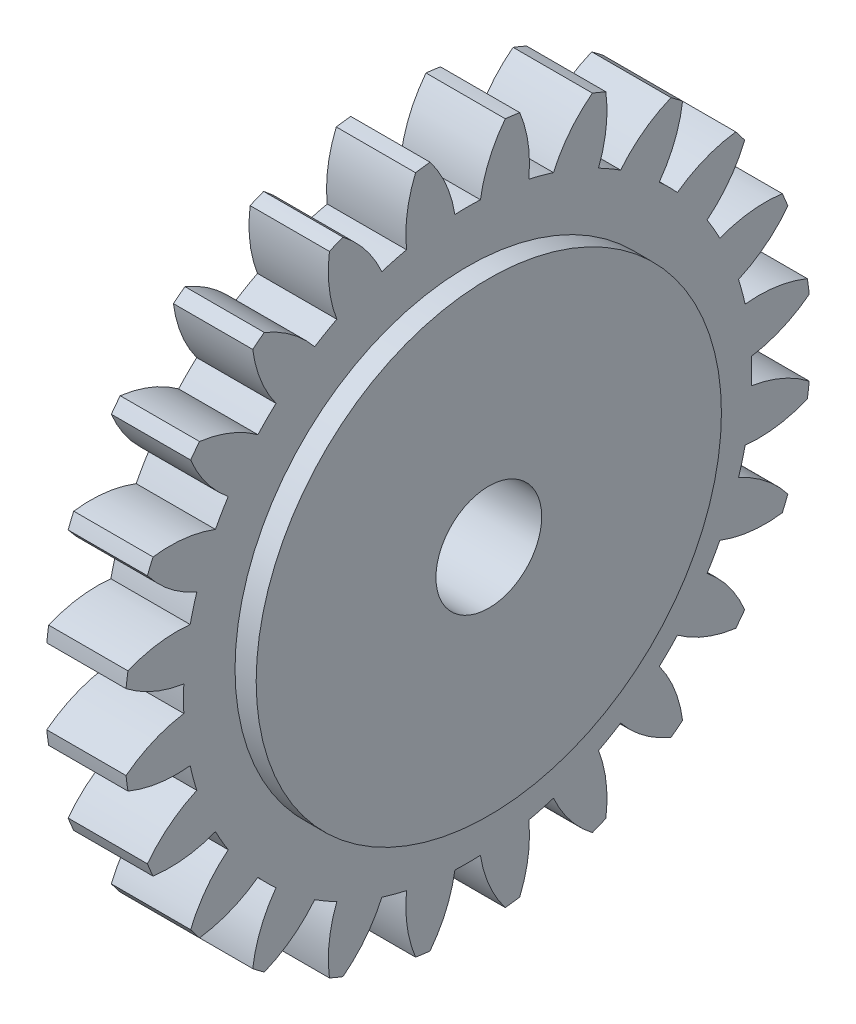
ISO-10303-21;
HEADER;
FILE_DESCRIPTION(('STEP AP214'),'2;1');
FILE_NAME('part.step','',(''),(''),'','','');
FILE_SCHEMA(('AUTOMOTIVE_DESIGN { 1 0 10303 214 1 1 1 1 }'));
ENDSEC;
DATA;
#1=APPLICATION_CONTEXT('core data for automotive mechanical design processes');
#2=APPLICATION_PROTOCOL_DEFINITION('international standard','automotive_design',2000,#1);
#3=PRODUCT_CONTEXT('',#1,'mechanical');
#4=PRODUCT('Part','Part','',(#3));
#5=PRODUCT_RELATED_PRODUCT_CATEGORY('part','',(#4));
#6=PRODUCT_DEFINITION_FORMATION('','',#4);
#7=PRODUCT_DEFINITION_CONTEXT('part definition',#1,'design');
#8=PRODUCT_DEFINITION('design','',#6,#7);
#9=PRODUCT_DEFINITION_SHAPE('','',#8);
#10=(LENGTH_UNIT() NAMED_UNIT(*) SI_UNIT(.MILLI.,.METRE.));
#11=(NAMED_UNIT(*) PLANE_ANGLE_UNIT() SI_UNIT($,.RADIAN.));
#12=(NAMED_UNIT(*) SI_UNIT($,.STERADIAN.) SOLID_ANGLE_UNIT());
#13=UNCERTAINTY_MEASURE_WITH_UNIT(LENGTH_MEASURE(1.E-05),#10,'distance_accuracy_value','');
#14=(GEOMETRIC_REPRESENTATION_CONTEXT(3) GLOBAL_UNCERTAINTY_ASSIGNED_CONTEXT((#13)) GLOBAL_UNIT_ASSIGNED_CONTEXT((#10,
#11,#12)) REPRESENTATION_CONTEXT('',''));
#15=CARTESIAN_POINT('',(0.,0.,0.));
#16=DIRECTION('',(0.,0.,1.));
#17=DIRECTION('',(1.,0.,0.));
#18=AXIS2_PLACEMENT_3D('',#15,#16,#17);
#19=CARTESIAN_POINT('',(0.,0.,0.));
#20=DIRECTION('',(1.,0.,0.));
#21=DIRECTION('',(0.,0.,-1.));
#22=AXIS2_PLACEMENT_3D('',#19,#20,#21);
#23=PLANE('',#22);
#24=CARTESIAN_POINT('',(0.,4.14987423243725,-3.81671898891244));
#25=DIRECTION('',(-1.,0.,0.));
#26=DIRECTION('',(0.,-0.258819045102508,-0.965925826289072));
#27=AXIS2_PLACEMENT_3D('',#24,#25,#26);
#28=CIRCLE('',#27,2.4);
#29=CARTESIAN_POINT('',(0.,5.1230923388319,-1.62289891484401));
#30=VERTEX_POINT('',#29);
#31=CARTESIAN_POINT('',(0.,6.0567000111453,-2.35931875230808));
#32=VERTEX_POINT('',#31);
#33=EDGE_CURVE('E42',#30,#32,#28,.T.);
#34=ORIENTED_EDGE('',*,*,#33,.T.);
#35=CARTESIAN_POINT('',(0.,0.,0.));
#36=DIRECTION('',(-1.,0.,0.));
#37=DIRECTION('',(0.,0.,1.));
#38=AXIS2_PLACEMENT_3D('',#35,#36,#37);
#39=CIRCLE('',#38,6.5);
#40=CARTESIAN_POINT('',(0.,5.95102393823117,-2.61444336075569));
#41=VERTEX_POINT('',#40);
#42=EDGE_CURVE('E723',#32,#41,#39,.T.);
#43=ORIENTED_EDGE('',*,*,#42,.T.);
#44=CARTESIAN_POINT('',(0.,5.63323208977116,-0.2355763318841));
#45=DIRECTION('',(1.,0.,0.));
#46=DIRECTION('',(0.,0.,-1.));
#47=AXIS2_PLACEMENT_3D('',#44,#45,#46);
#48=CIRCLE('',#47,2.4);
#49=CARTESIAN_POINT('',(0.,4.77013616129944,-2.47501050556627));
#50=VERTEX_POINT('',#49);
#51=EDGE_CURVE('E645',#50,#41,#48,.T.);
#52=ORIENTED_EDGE('',*,*,#51,.F.);
#53=CARTESIAN_POINT('',(0.,0.,0.));
#54=DIRECTION('',(-1.,0.,0.));
#55=DIRECTION('',(0.,-0.499999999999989,-0.866025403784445));
#56=AXIS2_PLACEMENT_3D('',#53,#54,#55);
#57=CIRCLE('',#56,5.374);
#58=CARTESIAN_POINT('',(0.,4.52849005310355,-2.89355384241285));
#59=VERTEX_POINT('',#58);
#60=EDGE_CURVE('E1223',#50,#59,#57,.T.);
#61=ORIENTED_EDGE('',*,*,#60,.T.);
#62=CARTESIAN_POINT('',(0.,3.02063113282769,-4.7607339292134));
#63=DIRECTION('',(-1.,0.,0.));
#64=DIRECTION('',(0.,-0.499999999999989,-0.866025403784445));
#65=AXIS2_PLACEMENT_3D('',#62,#63,#64);
#66=CIRCLE('',#65,2.4);
#67=CARTESIAN_POINT('',(0.,5.23968633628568,-3.84651622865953));
#68=VERTEX_POINT('',#67);
#69=EDGE_CURVE('E50',#59,#68,#66,.T.);
#70=ORIENTED_EDGE('',*,*,#69,.T.);
#71=CARTESIAN_POINT('',(0.,5.07157998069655,-4.06559669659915));
#72=VERTEX_POINT('',#71);
#73=EDGE_CURVE('E2158',#68,#72,#39,.T.);
#74=ORIENTED_EDGE('',*,*,#73,.T.);
#75=CARTESIAN_POINT('',(0.,5.3803127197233,-1.68553701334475));
#76=DIRECTION('',(1.,0.,0.));
#77=DIRECTION('',(0.,0.,-1.));
#78=AXIS2_PLACEMENT_3D('',#75,#76,#77);
#79=CIRCLE('',#78,2.4);
#80=CARTESIAN_POINT('',(0.,3.96701785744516,-3.62527865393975));
#81=VERTEX_POINT('',#80);
#82=EDGE_CURVE('E649',#81,#72,#79,.T.);
#83=ORIENTED_EDGE('',*,*,#82,.F.);
#84=CARTESIAN_POINT('',(0.,0.,0.));
#85=DIRECTION('',(-1.,0.,0.));
#86=DIRECTION('',(0.,-0.707106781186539,-0.707106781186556));
#87=AXIS2_PLACEMENT_3D('',#84,#85,#86);
#88=CIRCLE('',#87,5.374);
#89=CARTESIAN_POINT('',(0.,3.62527865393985,-3.96701785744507));
#90=VERTEX_POINT('',#89);
#91=EDGE_CURVE('E1202',#81,#90,#88,.T.);
#92=ORIENTED_EDGE('',*,*,#91,.T.);
#93=CARTESIAN_POINT('',(0.,1.68553701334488,-5.38031271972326));
#94=DIRECTION('',(-1.,0.,0.));
#95=DIRECTION('',(0.,-0.707106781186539,-0.707106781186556));
#96=AXIS2_PLACEMENT_3D('',#93,#94,#95);
#97=CIRCLE('',#96,2.4);
#98=CARTESIAN_POINT('',(0.,4.06559669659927,-5.07157998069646));
#99=VERTEX_POINT('',#98);
#100=EDGE_CURVE('E1205',#90,#99,#97,.T.);
#101=ORIENTED_EDGE('',*,*,#100,.T.);
#102=CARTESIAN_POINT('',(0.,3.84651622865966,-5.23968633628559));
#103=VERTEX_POINT('',#102);
#104=EDGE_CURVE('E2167',#99,#103,#39,.T.);
#105=ORIENTED_EDGE('',*,*,#104,.T.);
#106=CARTESIAN_POINT('',(0.,4.76073392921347,-3.02063113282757));
#107=DIRECTION('',(1.,0.,0.));
#108=DIRECTION('',(0.,0.,-1.));
#109=AXIS2_PLACEMENT_3D('',#106,#107,#108);
#110=CIRCLE('',#109,2.4);
#111=CARTESIAN_POINT('',(0.,2.89355384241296,-4.52849005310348));
#112=VERTEX_POINT('',#111);
#113=EDGE_CURVE('E654',#112,#103,#110,.T.);
#114=ORIENTED_EDGE('',*,*,#113,.F.);
#115=CARTESIAN_POINT('',(0.,0.,0.));
#116=DIRECTION('',(-1.,0.,0.));
#117=DIRECTION('',(0.,-0.866025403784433,-0.50000000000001));
#118=AXIS2_PLACEMENT_3D('',#115,#116,#117);
#119=CIRCLE('',#118,5.374);
#120=CARTESIAN_POINT('',(0.,2.47501050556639,-4.77013616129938));
#121=VERTEX_POINT('',#120);
#122=EDGE_CURVE('E1180',#112,#121,#119,.T.);
#123=ORIENTED_EDGE('',*,*,#122,.T.);
#124=CARTESIAN_POINT('',(0.,0.235576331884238,-5.63323208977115));
#125=DIRECTION('',(-1.,0.,0.));
#126=DIRECTION('',(0.,-0.866025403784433,-0.50000000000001));
#127=AXIS2_PLACEMENT_3D('',#124,#125,#126);
#128=CIRCLE('',#127,2.4);
#129=CARTESIAN_POINT('',(0.,2.61444336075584,-5.95102393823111));
#130=VERTEX_POINT('',#129);
#131=EDGE_CURVE('E1183',#121,#130,#128,.T.);
#132=ORIENTED_EDGE('',*,*,#131,.T.);
#133=CARTESIAN_POINT('',(0.,2.35931875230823,-6.05670001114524));
#134=VERTEX_POINT('',#133);
#135=EDGE_CURVE('E2168',#130,#134,#39,.T.);
#136=ORIENTED_EDGE('',*,*,#135,.T.);
#137=CARTESIAN_POINT('',(0.,3.81671898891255,-4.14987423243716));
#138=DIRECTION('',(1.,0.,0.));
#139=DIRECTION('',(0.,0.,-1.));
#140=AXIS2_PLACEMENT_3D('',#137,#138,#139);
#141=CIRCLE('',#140,2.4);
#142=CARTESIAN_POINT('',(0.,1.62289891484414,-5.12309233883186));
#143=VERTEX_POINT('',#142);
#144=EDGE_CURVE('E657',#143,#134,#141,.T.);
#145=ORIENTED_EDGE('',*,*,#144,.F.);
#146=CARTESIAN_POINT('',(0.,0.,0.));
#147=DIRECTION('',(-1.,0.,0.));
#148=DIRECTION('',(0.,-0.965925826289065,-0.258819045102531));
#149=AXIS2_PLACEMENT_3D('',#146,#147,#148);
#150=CIRCLE('',#149,5.374);
#151=CARTESIAN_POINT('',(0.,1.15607448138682,-5.24817756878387));
#152=VERTEX_POINT('',#151);
#153=EDGE_CURVE('E1158',#143,#152,#150,.T.);
#154=ORIENTED_EDGE('',*,*,#153,.T.);
#155=CARTESIAN_POINT('',(0.,-1.23043848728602,-5.50225600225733));
#156=DIRECTION('',(-1.,0.,0.));
#157=DIRECTION('',(0.,-0.965925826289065,-0.258819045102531));
#158=AXIS2_PLACEMENT_3D('',#155,#156,#157);
#159=CIRCLE('',#158,2.4);
#160=CARTESIAN_POINT('',(0.,0.98512003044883,-6.42491544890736));
#161=VERTEX_POINT('',#160);
#162=EDGE_CURVE('E1161',#152,#161,#159,.T.);
#163=ORIENTED_EDGE('',*,*,#162,.T.);
#164=CARTESIAN_POINT('',(0.,0.711337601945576,-6.46095958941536));
#165=VERTEX_POINT('',#164);
#166=EDGE_CURVE('E2171',#161,#165,#39,.T.);
#167=ORIENTED_EDGE('',*,*,#166,.T.);
#168=CARTESIAN_POINT('',(0.,2.61260095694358,-4.99631026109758));
#169=DIRECTION('',(1.,0.,0.));
#170=DIRECTION('',(0.,0.,-1.));
#171=AXIS2_PLACEMENT_3D('',#168,#169,#170);
#172=CIRCLE('',#171,2.4);
#173=CARTESIAN_POINT('',(0.,0.241646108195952,-5.36856434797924));
#174=VERTEX_POINT('',#173);
#175=EDGE_CURVE('E660',#174,#165,#172,.T.);
#176=ORIENTED_EDGE('',*,*,#175,.F.);
#177=CARTESIAN_POINT('',(0.,0.,0.));
#178=DIRECTION('',(-1.,0.,0.));
#179=DIRECTION('',(0.,-1.,0.));
#180=AXIS2_PLACEMENT_3D('',#177,#178,#179);
#181=CIRCLE('',#180,5.374);
#182=CARTESIAN_POINT('',(0.,-0.24164610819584,-5.36856434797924));
#183=VERTEX_POINT('',#182);
#184=EDGE_CURVE('E1136',#174,#183,#181,.T.);
#185=ORIENTED_EDGE('',*,*,#184,.T.);
#186=CARTESIAN_POINT('',(0.,-2.61260095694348,-4.99631026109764));
#187=DIRECTION('',(-1.,0.,0.));
#188=DIRECTION('',(0.,-1.,0.));
#189=AXIS2_PLACEMENT_3D('',#186,#187,#188);
#190=CIRCLE('',#189,2.4);
#191=CARTESIAN_POINT('',(0.,-0.711337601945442,-6.46095958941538));
#192=VERTEX_POINT('',#191);
#193=EDGE_CURVE('E1139',#183,#192,#190,.T.);
#194=ORIENTED_EDGE('',*,*,#193,.T.);
#195=CARTESIAN_POINT('',(0.,-0.985120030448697,-6.42491544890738));
#196=VERTEX_POINT('',#195);
#197=EDGE_CURVE('E2174',#192,#196,#39,.T.);
#198=ORIENTED_EDGE('',*,*,#197,.T.);
#199=CARTESIAN_POINT('',(0.,1.23043848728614,-5.5022560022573));
#200=DIRECTION('',(1.,0.,0.));
#201=DIRECTION('',(0.,0.,-1.));
#202=AXIS2_PLACEMENT_3D('',#199,#200,#201);
#203=CIRCLE('',#202,2.4);
#204=CARTESIAN_POINT('',(0.,-1.15607448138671,-5.2481775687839));
#205=VERTEX_POINT('',#204);
#206=EDGE_CURVE('E663',#205,#196,#203,.T.);
#207=ORIENTED_EDGE('',*,*,#206,.F.);
#208=CARTESIAN_POINT('',(0.,0.,0.));
#209=DIRECTION('',(-1.,0.,0.));
#210=DIRECTION('',(0.,-0.965925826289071,0.258819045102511));
#211=AXIS2_PLACEMENT_3D('',#208,#209,#210);
#212=CIRCLE('',#211,5.374);
#213=CARTESIAN_POINT('',(0.,-1.62289891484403,-5.1230923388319));
#214=VERTEX_POINT('',#213);
#215=EDGE_CURVE('E1114',#205,#214,#212,.T.);
#216=ORIENTED_EDGE('',*,*,#215,.T.);
#217=CARTESIAN_POINT('',(0.,-3.81671898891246,-4.14987423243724));
#218=DIRECTION('',(-1.,0.,0.));
#219=DIRECTION('',(0.,-0.965925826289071,0.258819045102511));
#220=AXIS2_PLACEMENT_3D('',#217,#218,#219);
#221=CIRCLE('',#220,2.4);
#222=CARTESIAN_POINT('',(0.,-2.3593187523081,-6.05670001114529));
#223=VERTEX_POINT('',#222);
#224=EDGE_CURVE('E1117',#214,#223,#221,.T.);
#225=ORIENTED_EDGE('',*,*,#224,.T.);
#226=CARTESIAN_POINT('',(0.,-2.61444336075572,-5.95102393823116));
#227=VERTEX_POINT('',#226);
#228=EDGE_CURVE('E2177',#223,#227,#39,.T.);
#229=ORIENTED_EDGE('',*,*,#228,.T.);
#230=CARTESIAN_POINT('',(0.,-0.23557633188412,-5.63323208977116));
#231=DIRECTION('',(1.,0.,0.));
#232=DIRECTION('',(0.,0.,-1.));
#233=AXIS2_PLACEMENT_3D('',#230,#231,#232);
#234=CIRCLE('',#233,2.4);
#235=CARTESIAN_POINT('',(0.,-2.47501050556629,-4.77013616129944));
#236=VERTEX_POINT('',#235);
#237=EDGE_CURVE('E666',#236,#227,#234,.T.);
#238=ORIENTED_EDGE('',*,*,#237,.F.);
#239=CARTESIAN_POINT('',(0.,0.,0.));
#240=DIRECTION('',(-1.,0.,0.));
#241=DIRECTION('',(0.,-0.866025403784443,0.499999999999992));
#242=AXIS2_PLACEMENT_3D('',#239,#240,#241);
#243=CIRCLE('',#242,5.374);
#244=CARTESIAN_POINT('',(0.,-2.89355384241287,-4.52849005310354));
#245=VERTEX_POINT('',#244);
#246=EDGE_CURVE('E1092',#236,#245,#243,.T.);
#247=ORIENTED_EDGE('',*,*,#246,.T.);
#248=CARTESIAN_POINT('',(0.,-4.76073392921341,-3.02063113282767));
#249=DIRECTION('',(-1.,0.,0.));
#250=DIRECTION('',(0.,-0.866025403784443,0.499999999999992));
#251=AXIS2_PLACEMENT_3D('',#248,#249,#250);
#252=CIRCLE('',#251,2.4);
#253=CARTESIAN_POINT('',(0.,-3.84651622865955,-5.23968633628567));
#254=VERTEX_POINT('',#253);
#255=EDGE_CURVE('E1095',#245,#254,#252,.T.);
#256=ORIENTED_EDGE('',*,*,#255,.T.);
#257=CARTESIAN_POINT('',(0.,-4.06559669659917,-5.07157998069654));
#258=VERTEX_POINT('',#257);
#259=EDGE_CURVE('E2180',#254,#258,#39,.T.);
#260=ORIENTED_EDGE('',*,*,#259,.T.);
#261=CARTESIAN_POINT('',(0.,-1.68553701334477,-5.3803127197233));
#262=DIRECTION('',(1.,0.,0.));
#263=DIRECTION('',(0.,0.,-1.));
#264=AXIS2_PLACEMENT_3D('',#261,#262,#263);
#265=CIRCLE('',#264,2.4);
#266=CARTESIAN_POINT('',(0.,-3.62527865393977,-3.96701785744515));
#267=VERTEX_POINT('',#266);
#268=EDGE_CURVE('E669',#267,#258,#265,.T.);
#269=ORIENTED_EDGE('',*,*,#268,.F.);
#270=CARTESIAN_POINT('',(0.,0.,0.));
#271=DIRECTION('',(-1.,0.,0.));
#272=DIRECTION('',(0.,-0.707106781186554,0.707106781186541));
#273=AXIS2_PLACEMENT_3D('',#270,#271,#272);
#274=CIRCLE('',#273,5.374);
#275=CARTESIAN_POINT('',(0.,-3.96701785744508,-3.62527865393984));
#276=VERTEX_POINT('',#275);
#277=EDGE_CURVE('E1070',#267,#276,#274,.T.);
#278=ORIENTED_EDGE('',*,*,#277,.T.);
#279=CARTESIAN_POINT('',(0.,-5.38031271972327,-1.68553701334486));
#280=DIRECTION('',(-1.,0.,0.));
#281=DIRECTION('',(0.,-0.707106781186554,0.707106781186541));
#282=AXIS2_PLACEMENT_3D('',#279,#280,#281);
#283=CIRCLE('',#282,2.4);
#284=CARTESIAN_POINT('',(0.,-5.07157998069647,-4.06559669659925));
#285=VERTEX_POINT('',#284);
#286=EDGE_CURVE('E1073',#276,#285,#283,.T.);
#287=ORIENTED_EDGE('',*,*,#286,.T.);
#288=CARTESIAN_POINT('',(0.,-5.2396863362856,-3.84651622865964));
#289=VERTEX_POINT('',#288);
#290=EDGE_CURVE('E2183',#285,#289,#39,.T.);
#291=ORIENTED_EDGE('',*,*,#290,.T.);
#292=CARTESIAN_POINT('',(0.,-3.02063113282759,-4.76073392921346));
#293=DIRECTION('',(1.,0.,0.));
#294=DIRECTION('',(0.,0.,-1.));
#295=AXIS2_PLACEMENT_3D('',#292,#293,#294);
#296=CIRCLE('',#295,2.4);
#297=CARTESIAN_POINT('',(0.,-4.52849005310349,-2.89355384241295));
#298=VERTEX_POINT('',#297);
#299=EDGE_CURVE('E672',#298,#289,#296,.T.);
#300=ORIENTED_EDGE('',*,*,#299,.F.);
#301=CARTESIAN_POINT('',(0.,0.,0.));
#302=DIRECTION('',(-1.,0.,0.));
#303=DIRECTION('',(0.,-0.500000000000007,0.866025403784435));
#304=AXIS2_PLACEMENT_3D('',#301,#302,#303);
#305=CIRCLE('',#304,5.374);
#306=CARTESIAN_POINT('',(0.,-4.77013616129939,-2.47501050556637));
#307=VERTEX_POINT('',#306);
#308=EDGE_CURVE('E1048',#298,#307,#305,.T.);
#309=ORIENTED_EDGE('',*,*,#308,.T.);
#310=CARTESIAN_POINT('',(0.,-5.63323208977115,-0.235576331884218));
#311=DIRECTION('',(-1.,0.,0.));
#312=DIRECTION('',(0.,-0.500000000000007,0.866025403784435));
#313=AXIS2_PLACEMENT_3D('',#310,#311,#312);
#314=CIRCLE('',#313,2.4);
#315=CARTESIAN_POINT('',(0.,-5.95102393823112,-2.61444336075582));
#316=VERTEX_POINT('',#315);
#317=EDGE_CURVE('E1051',#307,#316,#314,.T.);
#318=ORIENTED_EDGE('',*,*,#317,.T.);
#319=CARTESIAN_POINT('',(0.,-6.05670001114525,-2.35931875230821));
#320=VERTEX_POINT('',#319);
#321=EDGE_CURVE('E2186',#316,#320,#39,.T.);
#322=ORIENTED_EDGE('',*,*,#321,.T.);
#323=CARTESIAN_POINT('',(0.,-4.14987423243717,-3.81671898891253));
#324=DIRECTION('',(1.,0.,0.));
#325=DIRECTION('',(0.,0.,-1.));
#326=AXIS2_PLACEMENT_3D('',#323,#324,#325);
#327=CIRCLE('',#326,2.4);
#328=CARTESIAN_POINT('',(0.,-5.12309233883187,-1.62289891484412));
#329=VERTEX_POINT('',#328);
#330=EDGE_CURVE('E675',#329,#320,#327,.T.);
#331=ORIENTED_EDGE('',*,*,#330,.F.);
#332=CARTESIAN_POINT('',(0.,0.,0.));
#333=DIRECTION('',(-1.,0.,0.));
#334=DIRECTION('',(0.,-0.258819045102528,0.965925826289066));
#335=AXIS2_PLACEMENT_3D('',#332,#333,#334);
#336=CIRCLE('',#335,5.374);
#337=CARTESIAN_POINT('',(0.,-5.24817756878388,-1.1560744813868));
#338=VERTEX_POINT('',#337);
#339=EDGE_CURVE('E1026',#329,#338,#336,.T.);
#340=ORIENTED_EDGE('',*,*,#339,.T.);
#341=CARTESIAN_POINT('',(0.,-5.50225600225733,1.23043848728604));
#342=DIRECTION('',(-1.,0.,0.));
#343=DIRECTION('',(0.,-0.258819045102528,0.965925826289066));
#344=AXIS2_PLACEMENT_3D('',#341,#342,#343);
#345=CIRCLE('',#344,2.4);
#346=CARTESIAN_POINT('',(0.,-6.42491544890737,-0.985120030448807));
#347=VERTEX_POINT('',#346);
#348=EDGE_CURVE('E1029',#338,#347,#345,.T.);
#349=ORIENTED_EDGE('',*,*,#348,.T.);
#350=CARTESIAN_POINT('',(0.,-6.46095958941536,-0.711337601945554));
#351=VERTEX_POINT('',#350);
#352=EDGE_CURVE('E2189',#347,#351,#39,.T.);
#353=ORIENTED_EDGE('',*,*,#352,.T.);
#354=CARTESIAN_POINT('',(0.,-4.99631026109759,-2.61260095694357));
#355=DIRECTION('',(1.,0.,0.));
#356=DIRECTION('',(0.,0.,-1.));
#357=AXIS2_PLACEMENT_3D('',#354,#355,#356);
#358=CIRCLE('',#357,2.4);
#359=CARTESIAN_POINT('',(0.,-5.36856434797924,-0.241646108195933));
#360=VERTEX_POINT('',#359);
#361=EDGE_CURVE('E678',#360,#351,#358,.T.);
#362=ORIENTED_EDGE('',*,*,#361,.F.);
#363=CARTESIAN_POINT('',(0.,0.,0.));
#364=DIRECTION('',(-1.,0.,0.));
#365=DIRECTION('',(0.,0.,1.));
#366=AXIS2_PLACEMENT_3D('',#363,#364,#365);
#367=CIRCLE('',#366,5.374);
#368=CARTESIAN_POINT('',(0.,-5.36856434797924,0.241646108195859));
#369=VERTEX_POINT('',#368);
#370=EDGE_CURVE('E1004',#360,#369,#367,.T.);
#371=ORIENTED_EDGE('',*,*,#370,.T.);
#372=CARTESIAN_POINT('',(0.,-4.99631026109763,2.6126009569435));
#373=DIRECTION('',(-1.,0.,0.));
#374=DIRECTION('',(0.,0.,1.));
#375=AXIS2_PLACEMENT_3D('',#372,#373,#374);
#376=CIRCLE('',#375,2.4);
#377=CARTESIAN_POINT('',(0.,-6.46095958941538,0.711337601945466));
#378=VERTEX_POINT('',#377);
#379=EDGE_CURVE('E1007',#369,#378,#376,.T.);
#380=ORIENTED_EDGE('',*,*,#379,.T.);
#381=CARTESIAN_POINT('',(0.,-6.42491544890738,0.985120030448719));
#382=VERTEX_POINT('',#381);
#383=EDGE_CURVE('E2192',#378,#382,#39,.T.);
#384=ORIENTED_EDGE('',*,*,#383,.T.);
#385=CARTESIAN_POINT('',(0.,-5.50225600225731,-1.23043848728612));
#386=DIRECTION('',(1.,0.,0.));
#387=DIRECTION('',(0.,0.,-1.));
#388=AXIS2_PLACEMENT_3D('',#385,#386,#387);
#389=CIRCLE('',#388,2.4);
#390=CARTESIAN_POINT('',(0.,-5.24817756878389,1.15607448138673));
#391=VERTEX_POINT('',#390);
#392=EDGE_CURVE('E681',#391,#382,#389,.T.);
#393=ORIENTED_EDGE('',*,*,#392,.F.);
#394=CARTESIAN_POINT('',(0.,0.,0.));
#395=DIRECTION('',(-1.,0.,0.));
#396=DIRECTION('',(0.,0.258819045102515,0.96592582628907));
#397=AXIS2_PLACEMENT_3D('',#394,#395,#396);
#398=CIRCLE('',#397,5.374);
#399=CARTESIAN_POINT('',(0.,-5.12309233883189,1.62289891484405));
#400=VERTEX_POINT('',#399);
#401=EDGE_CURVE('E982',#391,#400,#398,.T.);
#402=ORIENTED_EDGE('',*,*,#401,.T.);
#403=CARTESIAN_POINT('',(0.,-4.14987423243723,3.81671898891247));
#404=DIRECTION('',(-1.,0.,0.));
#405=DIRECTION('',(0.,0.258819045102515,0.96592582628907));
#406=AXIS2_PLACEMENT_3D('',#403,#404,#405);
#407=CIRCLE('',#406,2.4);
#408=CARTESIAN_POINT('',(0.,-6.05670001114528,2.35931875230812));
#409=VERTEX_POINT('',#408);
#410=EDGE_CURVE('E985',#400,#409,#407,.T.);
#411=ORIENTED_EDGE('',*,*,#410,.T.);
#412=CARTESIAN_POINT('',(0.,-5.95102393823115,2.61444336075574));
#413=VERTEX_POINT('',#412);
#414=EDGE_CURVE('E2195',#409,#413,#39,.T.);
#415=ORIENTED_EDGE('',*,*,#414,.T.);
#416=CARTESIAN_POINT('',(0.,-5.63323208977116,0.235576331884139));
#417=DIRECTION('',(1.,0.,0.));
#418=DIRECTION('',(0.,0.,-1.));
#419=AXIS2_PLACEMENT_3D('',#416,#417,#418);
#420=CIRCLE('',#419,2.4);
#421=CARTESIAN_POINT('',(0.,-4.77013616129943,2.4750105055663));
#422=VERTEX_POINT('',#421);
#423=EDGE_CURVE('E684',#422,#413,#420,.T.);
#424=ORIENTED_EDGE('',*,*,#423,.F.);
#425=CARTESIAN_POINT('',(0.,0.,0.));
#426=DIRECTION('',(-1.,0.,0.));
#427=DIRECTION('',(0.,0.499999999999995,0.866025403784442));
#428=AXIS2_PLACEMENT_3D('',#425,#426,#427);
#429=CIRCLE('',#428,5.374);
#430=CARTESIAN_POINT('',(0.,-4.52849005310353,2.89355384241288));
#431=VERTEX_POINT('',#430);
#432=EDGE_CURVE('E960',#422,#431,#429,.T.);
#433=ORIENTED_EDGE('',*,*,#432,.T.);
#434=CARTESIAN_POINT('',(0.,-3.02063113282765,4.76073392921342));
#435=DIRECTION('',(-1.,0.,0.));
#436=DIRECTION('',(0.,0.499999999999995,0.866025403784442));
#437=AXIS2_PLACEMENT_3D('',#434,#435,#436);
#438=CIRCLE('',#437,2.4);
#439=CARTESIAN_POINT('',(0.,-5.23968633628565,3.84651622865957));
#440=VERTEX_POINT('',#439);
#441=EDGE_CURVE('E963',#431,#440,#438,.T.);
#442=ORIENTED_EDGE('',*,*,#441,.T.);
#443=CARTESIAN_POINT('',(0.,-5.07157998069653,4.06559669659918));
#444=VERTEX_POINT('',#443);
#445=EDGE_CURVE('E2198',#440,#444,#39,.T.);
#446=ORIENTED_EDGE('',*,*,#445,.T.);
#447=CARTESIAN_POINT('',(0.,-5.38031271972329,1.68553701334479));
#448=DIRECTION('',(1.,0.,0.));
#449=DIRECTION('',(0.,0.,-1.));
#450=AXIS2_PLACEMENT_3D('',#447,#448,#449);
#451=CIRCLE('',#450,2.4);
#452=CARTESIAN_POINT('',(0.,-3.96701785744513,3.62527865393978));
#453=VERTEX_POINT('',#452);
#454=EDGE_CURVE('E687',#453,#444,#451,.T.);
#455=ORIENTED_EDGE('',*,*,#454,.F.);
#456=CARTESIAN_POINT('',(0.,0.,0.));
#457=DIRECTION('',(-1.,0.,0.));
#458=DIRECTION('',(0.,0.707106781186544,0.707106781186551));
#459=AXIS2_PLACEMENT_3D('',#456,#457,#458);
#460=CIRCLE('',#459,5.374);
#461=CARTESIAN_POINT('',(0.,-3.62527865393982,3.9670178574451));
#462=VERTEX_POINT('',#461);
#463=EDGE_CURVE('E938',#453,#462,#460,.T.);
#464=ORIENTED_EDGE('',*,*,#463,.T.);
#465=CARTESIAN_POINT('',(0.,-1.68553701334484,5.38031271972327));
#466=DIRECTION('',(-1.,0.,0.));
#467=DIRECTION('',(0.,0.707106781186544,0.707106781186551));
#468=AXIS2_PLACEMENT_3D('',#465,#466,#467);
#469=CIRCLE('',#468,2.4);
#470=CARTESIAN_POINT('',(0.,-4.06559669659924,5.07157998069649));
#471=VERTEX_POINT('',#470);
#472=EDGE_CURVE('E941',#462,#471,#469,.T.);
#473=ORIENTED_EDGE('',*,*,#472,.T.);
#474=CARTESIAN_POINT('',(0.,-3.84651622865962,5.23968633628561));
#475=VERTEX_POINT('',#474);
#476=EDGE_CURVE('E2201',#471,#475,#39,.T.);
#477=ORIENTED_EDGE('',*,*,#476,.T.);
#478=CARTESIAN_POINT('',(0.,-4.76073392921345,3.0206311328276));
#479=DIRECTION('',(1.,0.,0.));
#480=DIRECTION('',(0.,0.,-1.));
#481=AXIS2_PLACEMENT_3D('',#478,#479,#480);
#482=CIRCLE('',#481,2.4);
#483=CARTESIAN_POINT('',(0.,-2.89355384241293,4.5284900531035));
#484=VERTEX_POINT('',#483);
#485=EDGE_CURVE('E690',#484,#475,#482,.T.);
#486=ORIENTED_EDGE('',*,*,#485,.F.);
#487=CARTESIAN_POINT('',(0.,0.,0.));
#488=DIRECTION('',(-1.,0.,0.));
#489=DIRECTION('',(0.,0.866025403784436,0.500000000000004));
#490=AXIS2_PLACEMENT_3D('',#487,#488,#489);
#491=CIRCLE('',#490,5.374);
#492=CARTESIAN_POINT('',(0.,-2.47501050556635,4.7701361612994));
#493=VERTEX_POINT('',#492);
#494=EDGE_CURVE('E916',#484,#493,#491,.T.);
#495=ORIENTED_EDGE('',*,*,#494,.T.);
#496=CARTESIAN_POINT('',(0.,-0.235576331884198,5.63323208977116));
#497=DIRECTION('',(-1.,0.,0.));
#498=DIRECTION('',(0.,0.866025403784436,0.500000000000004));
#499=AXIS2_PLACEMENT_3D('',#496,#497,#498);
#500=CIRCLE('',#499,2.4);
#501=CARTESIAN_POINT('',(0.,-2.6144433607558,5.95102393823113));
#502=VERTEX_POINT('',#501);
#503=EDGE_CURVE('E919',#493,#502,#500,.T.);
#504=ORIENTED_EDGE('',*,*,#503,.T.);
#505=CARTESIAN_POINT('',(0.,-2.35931875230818,6.05670001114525));
#506=VERTEX_POINT('',#505);
#507=EDGE_CURVE('E2204',#502,#506,#39,.T.);
#508=ORIENTED_EDGE('',*,*,#507,.T.);
#509=CARTESIAN_POINT('',(0.,-3.81671898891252,4.14987423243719));
#510=DIRECTION('',(1.,0.,0.));
#511=DIRECTION('',(0.,0.,-1.));
#512=AXIS2_PLACEMENT_3D('',#509,#510,#511);
#513=CIRCLE('',#512,2.4);
#514=CARTESIAN_POINT('',(0.,-1.6228989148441,5.12309233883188));
#515=VERTEX_POINT('',#514);
#516=EDGE_CURVE('E693',#515,#506,#513,.T.);
#517=ORIENTED_EDGE('',*,*,#516,.F.);
#518=CARTESIAN_POINT('',(0.,0.,0.));
#519=DIRECTION('',(-1.,0.,0.));
#520=DIRECTION('',(0.,0.965925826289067,0.258819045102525));
#521=AXIS2_PLACEMENT_3D('',#518,#519,#520);
#522=CIRCLE('',#521,5.374);
#523=CARTESIAN_POINT('',(0.,-1.15607448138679,5.24817756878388));
#524=VERTEX_POINT('',#523);
#525=EDGE_CURVE('E894',#515,#524,#522,.T.);
#526=ORIENTED_EDGE('',*,*,#525,.T.);
#527=CARTESIAN_POINT('',(0.,1.23043848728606,5.50225600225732));
#528=DIRECTION('',(-1.,0.,0.));
#529=DIRECTION('',(0.,0.965925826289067,0.258819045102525));
#530=AXIS2_PLACEMENT_3D('',#527,#528,#529);
#531=CIRCLE('',#530,2.4);
#532=CARTESIAN_POINT('',(0.,-0.985120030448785,6.42491544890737));
#533=VERTEX_POINT('',#532);
#534=EDGE_CURVE('E897',#524,#533,#531,.T.);
#535=ORIENTED_EDGE('',*,*,#534,.T.);
#536=CARTESIAN_POINT('',(0.,-0.711337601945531,6.46095958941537));
#537=VERTEX_POINT('',#536);
#538=EDGE_CURVE('E2207',#533,#537,#39,.T.);
#539=ORIENTED_EDGE('',*,*,#538,.T.);
#540=CARTESIAN_POINT('',(0.,-2.61260095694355,4.9963102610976));
#541=DIRECTION('',(1.,0.,0.));
#542=DIRECTION('',(0.,0.,-1.));
#543=AXIS2_PLACEMENT_3D('',#540,#541,#542);
#544=CIRCLE('',#543,2.4);
#545=CARTESIAN_POINT('',(0.,-0.241646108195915,5.36856434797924));
#546=VERTEX_POINT('',#545);
#547=EDGE_CURVE('E696',#546,#537,#544,.T.);
#548=ORIENTED_EDGE('',*,*,#547,.F.);
#549=CARTESIAN_POINT('',(0.,0.,0.));
#550=DIRECTION('',(-1.,0.,0.));
#551=DIRECTION('',(0.,1.,0.));
#552=AXIS2_PLACEMENT_3D('',#549,#550,#551);
#553=CIRCLE('',#552,5.374);
#554=CARTESIAN_POINT('',(0.,0.241646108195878,5.36856434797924));
#555=VERTEX_POINT('',#554);
#556=EDGE_CURVE('E872',#546,#555,#553,.T.);
#557=ORIENTED_EDGE('',*,*,#556,.T.);
#558=CARTESIAN_POINT('',(0.,2.61260095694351,4.99631026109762));
#559=DIRECTION('',(-1.,0.,0.));
#560=DIRECTION('',(0.,1.,0.));
#561=AXIS2_PLACEMENT_3D('',#558,#559,#560);
#562=CIRCLE('',#561,2.4);
#563=CARTESIAN_POINT('',(0.,0.711337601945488,6.46095958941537));
#564=VERTEX_POINT('',#563);
#565=EDGE_CURVE('E875',#555,#564,#562,.T.);
#566=ORIENTED_EDGE('',*,*,#565,.T.);
#567=CARTESIAN_POINT('',(0.,0.985120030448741,6.42491544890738));
#568=VERTEX_POINT('',#567);
#569=EDGE_CURVE('E2210',#564,#568,#39,.T.);
#570=ORIENTED_EDGE('',*,*,#569,.T.);
#571=CARTESIAN_POINT('',(0.,-1.2304384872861,5.50225600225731));
#572=DIRECTION('',(1.,0.,0.));
#573=DIRECTION('',(0.,0.,-1.));
#574=AXIS2_PLACEMENT_3D('',#571,#572,#573);
#575=CIRCLE('',#574,2.4);
#576=CARTESIAN_POINT('',(0.,1.15607448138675,5.24817756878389));
#577=VERTEX_POINT('',#576);
#578=EDGE_CURVE('E699',#577,#568,#575,.T.);
#579=ORIENTED_EDGE('',*,*,#578,.F.);
#580=CARTESIAN_POINT('',(0.,0.,0.));
#581=DIRECTION('',(-1.,0.,0.));
#582=DIRECTION('',(0.,0.965925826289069,-0.258819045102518));
#583=AXIS2_PLACEMENT_3D('',#580,#581,#582);
#584=CIRCLE('',#583,5.374);
#585=CARTESIAN_POINT('',(0.,1.62289891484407,5.12309233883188));
#586=VERTEX_POINT('',#585);
#587=EDGE_CURVE('E850',#577,#586,#584,.T.);
#588=ORIENTED_EDGE('',*,*,#587,.T.);
#589=CARTESIAN_POINT('',(0.,3.81671898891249,4.14987423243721));
#590=DIRECTION('',(-1.,0.,0.));
#591=DIRECTION('',(0.,0.965925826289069,-0.258819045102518));
#592=AXIS2_PLACEMENT_3D('',#589,#590,#591);
#593=CIRCLE('',#592,2.4);
#594=CARTESIAN_POINT('',(0.,2.35931875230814,6.05670001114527));
#595=VERTEX_POINT('',#594);
#596=EDGE_CURVE('E853',#586,#595,#593,.T.);
#597=ORIENTED_EDGE('',*,*,#596,.T.);
#598=CARTESIAN_POINT('',(0.,2.61444336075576,5.95102393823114));
#599=VERTEX_POINT('',#598);
#600=EDGE_CURVE('E2213',#595,#599,#39,.T.);
#601=ORIENTED_EDGE('',*,*,#600,.T.);
#602=CARTESIAN_POINT('',(0.,0.235576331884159,5.63323208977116));
#603=DIRECTION('',(1.,0.,0.));
#604=DIRECTION('',(0.,0.,-1.));
#605=AXIS2_PLACEMENT_3D('',#602,#603,#604);
#606=CIRCLE('',#605,2.4);
#607=CARTESIAN_POINT('',(0.,2.47501050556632,4.77013616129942));
#608=VERTEX_POINT('',#607);
#609=EDGE_CURVE('E702',#608,#599,#606,.T.);
#610=ORIENTED_EDGE('',*,*,#609,.F.);
#611=CARTESIAN_POINT('',(0.,0.,0.));
#612=DIRECTION('',(-1.,0.,0.));
#613=DIRECTION('',(0.,0.86602540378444,-0.499999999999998));
#614=AXIS2_PLACEMENT_3D('',#611,#612,#613);
#615=CIRCLE('',#614,5.374);
#616=CARTESIAN_POINT('',(0.,2.8935538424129,4.52849005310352));
#617=VERTEX_POINT('',#616);
#618=EDGE_CURVE('E828',#608,#617,#615,.T.);
#619=ORIENTED_EDGE('',*,*,#618,.T.);
#620=CARTESIAN_POINT('',(0.,4.76073392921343,3.02063113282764));
#621=DIRECTION('',(-1.,0.,0.));
#622=DIRECTION('',(0.,0.86602540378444,-0.499999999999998));
#623=AXIS2_PLACEMENT_3D('',#620,#621,#622);
#624=CIRCLE('',#623,2.4);
#625=CARTESIAN_POINT('',(0.,3.84651622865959,5.23968633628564));
#626=VERTEX_POINT('',#625);
#627=EDGE_CURVE('E831',#617,#626,#624,.T.);
#628=ORIENTED_EDGE('',*,*,#627,.T.);
#629=CARTESIAN_POINT('',(0.,4.0655966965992,5.07157998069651));
#630=VERTEX_POINT('',#629);
#631=EDGE_CURVE('E2216',#626,#630,#39,.T.);
#632=ORIENTED_EDGE('',*,*,#631,.T.);
#633=CARTESIAN_POINT('',(0.,1.68553701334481,5.38031271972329));
#634=DIRECTION('',(1.,0.,0.));
#635=DIRECTION('',(0.,0.,-1.));
#636=AXIS2_PLACEMENT_3D('',#633,#634,#635);
#637=CIRCLE('',#636,2.4);
#638=CARTESIAN_POINT('',(0.,3.62527865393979,3.96701785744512));
#639=VERTEX_POINT('',#638);
#640=EDGE_CURVE('E705',#639,#630,#637,.T.);
#641=ORIENTED_EDGE('',*,*,#640,.F.);
#642=CARTESIAN_POINT('',(0.,0.,0.));
#643=DIRECTION('',(-1.,0.,0.));
#644=DIRECTION('',(0.,0.707106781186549,-0.707106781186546));
#645=AXIS2_PLACEMENT_3D('',#642,#643,#644);
#646=CIRCLE('',#645,5.374);
#647=CARTESIAN_POINT('',(0.,3.96701785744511,3.62527865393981));
#648=VERTEX_POINT('',#647);
#649=EDGE_CURVE('E806',#639,#648,#646,.T.);
#650=ORIENTED_EDGE('',*,*,#649,.T.);
#651=CARTESIAN_POINT('',(0.,5.38031271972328,1.68553701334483));
#652=DIRECTION('',(-1.,0.,0.));
#653=DIRECTION('',(0.,0.707106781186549,-0.707106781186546));
#654=AXIS2_PLACEMENT_3D('',#651,#652,#653);
#655=CIRCLE('',#654,2.4);
#656=CARTESIAN_POINT('',(0.,5.0715799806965,4.06559669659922));
#657=VERTEX_POINT('',#656);
#658=EDGE_CURVE('E809',#648,#657,#655,.T.);
#659=ORIENTED_EDGE('',*,*,#658,.T.);
#660=CARTESIAN_POINT('',(0.,5.23968633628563,3.8465162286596));
#661=VERTEX_POINT('',#660);
#662=EDGE_CURVE('E2219',#657,#661,#39,.T.);
#663=ORIENTED_EDGE('',*,*,#662,.T.);
#664=CARTESIAN_POINT('',(0.,3.02063113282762,4.76073392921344));
#665=DIRECTION('',(1.,0.,0.));
#666=DIRECTION('',(0.,0.,-1.));
#667=AXIS2_PLACEMENT_3D('',#664,#665,#666);
#668=CIRCLE('',#667,2.4);
#669=CARTESIAN_POINT('',(0.,4.52849005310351,2.89355384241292));
#670=VERTEX_POINT('',#669);
#671=EDGE_CURVE('E708',#670,#661,#668,.T.);
#672=ORIENTED_EDGE('',*,*,#671,.F.);
#673=CARTESIAN_POINT('',(0.,0.,0.));
#674=DIRECTION('',(-1.,0.,0.));
#675=DIRECTION('',(0.,0.500000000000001,-0.866025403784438));
#676=AXIS2_PLACEMENT_3D('',#673,#674,#675);
#677=CIRCLE('',#676,5.374);
#678=CARTESIAN_POINT('',(0.,4.77013616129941,2.47501050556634));
#679=VERTEX_POINT('',#678);
#680=EDGE_CURVE('E784',#670,#679,#677,.T.);
#681=ORIENTED_EDGE('',*,*,#680,.T.);
#682=CARTESIAN_POINT('',(0.,5.63323208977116,0.235576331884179));
#683=DIRECTION('',(-1.,0.,0.));
#684=DIRECTION('',(0.,0.500000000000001,-0.866025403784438));
#685=AXIS2_PLACEMENT_3D('',#682,#683,#684);
#686=CIRCLE('',#685,2.4);
#687=CARTESIAN_POINT('',(0.,5.95102393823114,2.61444336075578));
#688=VERTEX_POINT('',#687);
#689=EDGE_CURVE('E787',#679,#688,#686,.T.);
#690=ORIENTED_EDGE('',*,*,#689,.T.);
#691=CARTESIAN_POINT('',(0.,6.05670001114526,2.35931875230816));
#692=VERTEX_POINT('',#691);
#693=EDGE_CURVE('E2222',#688,#692,#39,.T.);
#694=ORIENTED_EDGE('',*,*,#693,.T.);
#695=CARTESIAN_POINT('',(0.,4.1498742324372,3.8167189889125));
#696=DIRECTION('',(1.,0.,0.));
#697=DIRECTION('',(0.,0.,-1.));
#698=AXIS2_PLACEMENT_3D('',#695,#696,#697);
#699=CIRCLE('',#698,2.4);
#700=CARTESIAN_POINT('',(0.,5.12309233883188,1.62289891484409));
#701=VERTEX_POINT('',#700);
#702=EDGE_CURVE('E711',#701,#692,#699,.T.);
#703=ORIENTED_EDGE('',*,*,#702,.F.);
#704=CARTESIAN_POINT('',(0.,0.,0.));
#705=DIRECTION('',(-1.,0.,0.));
#706=DIRECTION('',(0.,0.258819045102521,-0.965925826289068));
#707=AXIS2_PLACEMENT_3D('',#704,#705,#706);
#708=CIRCLE('',#707,5.374);
#709=CARTESIAN_POINT('',(0.,5.24817756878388,1.15607448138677));
#710=VERTEX_POINT('',#709);
#711=EDGE_CURVE('E762',#701,#710,#708,.T.);
#712=ORIENTED_EDGE('',*,*,#711,.T.);
#713=CARTESIAN_POINT('',(0.,5.50225600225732,-1.23043848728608));
#714=DIRECTION('',(-1.,0.,0.));
#715=DIRECTION('',(0.,0.258819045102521,-0.965925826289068));
#716=AXIS2_PLACEMENT_3D('',#713,#714,#715);
#717=CIRCLE('',#716,2.4);
#718=CARTESIAN_POINT('',(0.,6.42491544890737,0.985120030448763));
#719=VERTEX_POINT('',#718);
#720=EDGE_CURVE('E765',#710,#719,#717,.T.);
#721=ORIENTED_EDGE('',*,*,#720,.T.);
#722=CARTESIAN_POINT('',(0.,6.46095958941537,0.711337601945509));
#723=VERTEX_POINT('',#722);
#724=EDGE_CURVE('E724',#719,#723,#39,.T.);
#725=ORIENTED_EDGE('',*,*,#724,.T.);
#726=CARTESIAN_POINT('',(0.,4.99631026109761,2.61260095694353));
#727=DIRECTION('',(1.,0.,0.));
#728=DIRECTION('',(0.,0.,-1.));
#729=AXIS2_PLACEMENT_3D('',#726,#727,#728);
#730=CIRCLE('',#729,2.4);
#731=CARTESIAN_POINT('',(0.,5.36856434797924,0.241646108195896));
#732=VERTEX_POINT('',#731);
#733=EDGE_CURVE('E714',#732,#723,#730,.T.);
#734=ORIENTED_EDGE('',*,*,#733,.F.);
#735=CARTESIAN_POINT('',(0.,0.,0.));
#736=DIRECTION('',(-1.,0.,0.));
#737=DIRECTION('',(0.,0.,-1.));
#738=AXIS2_PLACEMENT_3D('',#735,#736,#737);
#739=CIRCLE('',#738,5.374);
#740=CARTESIAN_POINT('',(0.,5.36856434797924,-0.241646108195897));
#741=VERTEX_POINT('',#740);
#742=EDGE_CURVE('E741',#732,#741,#739,.T.);
#743=ORIENTED_EDGE('',*,*,#742,.T.);
#744=CARTESIAN_POINT('',(0.,4.99631026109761,-2.61260095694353));
#745=DIRECTION('',(-1.,0.,0.));
#746=DIRECTION('',(0.,0.,-1.));
#747=AXIS2_PLACEMENT_3D('',#744,#745,#746);
#748=CIRCLE('',#747,2.4);
#749=CARTESIAN_POINT('',(0.,6.46095958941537,-0.71133760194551));
#750=VERTEX_POINT('',#749);
#751=EDGE_CURVE('E744',#741,#750,#748,.T.);
#752=ORIENTED_EDGE('',*,*,#751,.T.);
#753=CARTESIAN_POINT('',(0.,6.42491544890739,-0.985120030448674));
#754=VERTEX_POINT('',#753);
#755=EDGE_CURVE('E644',#750,#754,#39,.T.);
#756=ORIENTED_EDGE('',*,*,#755,.T.);
#757=CARTESIAN_POINT('',(0.,5.5022560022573,1.23043848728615));
#758=DIRECTION('',(1.,0.,0.));
#759=DIRECTION('',(0.,0.,-1.));
#760=AXIS2_PLACEMENT_3D('',#757,#758,#759);
#761=CIRCLE('',#760,2.4);
#762=CARTESIAN_POINT('',(0.,5.2481775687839,-1.1560744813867));
#763=VERTEX_POINT('',#762);
#764=EDGE_CURVE('E625',#763,#754,#761,.T.);
#765=ORIENTED_EDGE('',*,*,#764,.F.);
#766=CARTESIAN_POINT('',(0.,0.,0.));
#767=DIRECTION('',(-1.,0.,0.));
#768=DIRECTION('',(0.,-0.258819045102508,-0.965925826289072));
#769=AXIS2_PLACEMENT_3D('',#766,#767,#768);
#770=CIRCLE('',#769,5.374);
#771=EDGE_CURVE('E635',#763,#30,#770,.T.);
#772=ORIENTED_EDGE('',*,*,#771,.T.);
#773=EDGE_LOOP('',(#34,#43,#52,#61,#70,#74,#83,#92,#101,#105,#114,#123,#132,#136,#145,#154,#163,
#167,#176,#185,#194,#198,#207,#216,#225,#229,#238,#247,#256,#260,#269,#278,#287,#291,#300,#309,
#318,#322,#331,#340,#349,#353,#362,#371,#380,#384,#393,#402,#411,#415,#424,#433,#442,#446,#455,
#464,#473,#477,#486,#495,#504,#508,#517,#526,#535,#539,#548,#557,#566,#570,#579,#588,#597,#601,
#610,#619,#628,#632,#641,#650,#659,#663,#672,#681,#690,#694,#703,#712,#721,#725,#734,#743,#752,
#756,#765,#772));
#774=FACE_BOUND('',#773,.T.);
#775=CARTESIAN_POINT('',(0.,0.,0.));
#776=DIRECTION('',(1.,0.,0.));
#777=DIRECTION('',(0.,0.,-1.));
#778=AXIS2_PLACEMENT_3D('',#775,#776,#777);
#779=CIRCLE('',#778,2.05);
#780=CARTESIAN_POINT('',(0.,0.,-2.05));
#781=VERTEX_POINT('',#780);
#782=EDGE_CURVE('E11',#781,#781,#779,.F.);
#783=ORIENTED_EDGE('',*,*,#782,.F.);
#784=EDGE_LOOP('',(#783));
#785=FACE_BOUND('',#784,.T.);
#786=ADVANCED_FACE('F27',(#774,#785),#23,.F.);
#787=CARTESIAN_POINT('',(1.5,0.,0.));
#788=DIRECTION('',(-1.,0.,0.));
#789=DIRECTION('',(0.,0.,1.));
#790=AXIS2_PLACEMENT_3D('',#787,#788,#789);
#791=PLANE('',#790);
#792=CARTESIAN_POINT('',(1.5,4.14987423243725,-3.81671898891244));
#793=DIRECTION('',(-1.,0.,0.));
#794=DIRECTION('',(0.,-0.258819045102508,-0.965925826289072));
#795=AXIS2_PLACEMENT_3D('',#792,#793,#794);
#796=CIRCLE('',#795,2.4);
#797=CARTESIAN_POINT('',(1.5,5.1230923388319,-1.62289891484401));
#798=VERTEX_POINT('',#797);
#799=CARTESIAN_POINT('',(1.5,6.05670001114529,-2.35931875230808));
#800=VERTEX_POINT('',#799);
#801=EDGE_CURVE('E638',#798,#800,#796,.T.);
#802=ORIENTED_EDGE('',*,*,#801,.F.);
#803=CARTESIAN_POINT('',(1.5,0.,0.));
#804=DIRECTION('',(-1.,0.,0.));
#805=DIRECTION('',(0.,-0.258819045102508,-0.965925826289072));
#806=AXIS2_PLACEMENT_3D('',#803,#804,#805);
#807=CIRCLE('',#806,5.374);
#808=CARTESIAN_POINT('',(1.5,5.2481775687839,-1.1560744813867));
#809=VERTEX_POINT('',#808);
#810=EDGE_CURVE('E1231',#809,#798,#807,.T.);
#811=ORIENTED_EDGE('',*,*,#810,.F.);
#812=CARTESIAN_POINT('',(1.5,5.5022560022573,1.23043848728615));
#813=DIRECTION('',(-1.,0.,0.));
#814=DIRECTION('',(0.,-0.258819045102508,-0.965925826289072));
#815=AXIS2_PLACEMENT_3D('',#812,#813,#814);
#816=CIRCLE('',#815,2.4);
#817=CARTESIAN_POINT('',(1.5,6.42491544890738,-0.985120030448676));
#818=VERTEX_POINT('',#817);
#819=EDGE_CURVE('E628',#818,#809,#816,.T.);
#820=ORIENTED_EDGE('',*,*,#819,.F.);
#821=CARTESIAN_POINT('',(1.5,0.,0.));
#822=DIRECTION('',(-1.,0.,0.));
#823=DIRECTION('',(0.,0.,1.));
#824=AXIS2_PLACEMENT_3D('',#821,#822,#823);
#825=CIRCLE('',#824,6.49999999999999);
#826=CARTESIAN_POINT('',(1.5,6.46095958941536,-0.711337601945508));
#827=VERTEX_POINT('',#826);
#828=EDGE_CURVE('E717',#827,#818,#825,.T.);
#829=ORIENTED_EDGE('',*,*,#828,.F.);
#830=CARTESIAN_POINT('',(1.5,4.99631026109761,-2.61260095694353));
#831=DIRECTION('',(-1.,0.,0.));
#832=DIRECTION('',(0.,0.,-1.));
#833=AXIS2_PLACEMENT_3D('',#830,#831,#832);
#834=CIRCLE('',#833,2.4);
#835=CARTESIAN_POINT('',(1.5,5.36856434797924,-0.241646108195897));
#836=VERTEX_POINT('',#835);
#837=EDGE_CURVE('E739',#836,#827,#834,.T.);
#838=ORIENTED_EDGE('',*,*,#837,.F.);
#839=CARTESIAN_POINT('',(1.5,0.,0.));
#840=DIRECTION('',(-1.,0.,0.));
#841=DIRECTION('',(0.,0.,-1.));
#842=AXIS2_PLACEMENT_3D('',#839,#840,#841);
#843=CIRCLE('',#842,5.374);
#844=CARTESIAN_POINT('',(1.5,5.36856434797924,0.241646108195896));
#845=VERTEX_POINT('',#844);
#846=EDGE_CURVE('E735',#845,#836,#843,.T.);
#847=ORIENTED_EDGE('',*,*,#846,.F.);
#848=CARTESIAN_POINT('',(1.5,4.99631026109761,2.61260095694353));
#849=DIRECTION('',(-1.,0.,0.));
#850=DIRECTION('',(0.,0.,-1.));
#851=AXIS2_PLACEMENT_3D('',#848,#849,#850);
#852=CIRCLE('',#851,2.4);
#853=CARTESIAN_POINT('',(1.5,6.46095958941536,0.711337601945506));
#854=VERTEX_POINT('',#853);
#855=EDGE_CURVE('E737',#854,#845,#852,.T.);
#856=ORIENTED_EDGE('',*,*,#855,.F.);
#857=CARTESIAN_POINT('',(1.5,6.42491544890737,0.985120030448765));
#858=VERTEX_POINT('',#857);
#859=EDGE_CURVE('E721',#858,#854,#825,.T.);
#860=ORIENTED_EDGE('',*,*,#859,.F.);
#861=CARTESIAN_POINT('',(1.5,5.50225600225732,-1.23043848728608));
#862=DIRECTION('',(-1.,0.,0.));
#863=DIRECTION('',(0.,0.258819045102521,-0.965925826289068));
#864=AXIS2_PLACEMENT_3D('',#861,#862,#863);
#865=CIRCLE('',#864,2.4);
#866=CARTESIAN_POINT('',(1.5,5.24817756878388,1.15607448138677));
#867=VERTEX_POINT('',#866);
#868=EDGE_CURVE('E760',#867,#858,#865,.T.);
#869=ORIENTED_EDGE('',*,*,#868,.F.);
#870=CARTESIAN_POINT('',(1.5,0.,0.));
#871=DIRECTION('',(-1.,0.,0.));
#872=DIRECTION('',(0.,0.258819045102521,-0.965925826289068));
#873=AXIS2_PLACEMENT_3D('',#870,#871,#872);
#874=CIRCLE('',#873,5.374);
#875=CARTESIAN_POINT('',(1.5,5.12309233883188,1.62289891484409));
#876=VERTEX_POINT('',#875);
#877=EDGE_CURVE('E756',#876,#867,#874,.T.);
#878=ORIENTED_EDGE('',*,*,#877,.F.);
#879=CARTESIAN_POINT('',(1.5,4.1498742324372,3.8167189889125));
#880=DIRECTION('',(-1.,0.,0.));
#881=DIRECTION('',(0.,0.258819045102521,-0.965925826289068));
#882=AXIS2_PLACEMENT_3D('',#879,#880,#881);
#883=CIRCLE('',#882,2.4);
#884=CARTESIAN_POINT('',(1.5,6.05670001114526,2.35931875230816));
#885=VERTEX_POINT('',#884);
#886=EDGE_CURVE('E758',#885,#876,#883,.T.);
#887=ORIENTED_EDGE('',*,*,#886,.F.);
#888=CARTESIAN_POINT('',(1.5,5.95102393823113,2.61444336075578));
#889=VERTEX_POINT('',#888);
#890=EDGE_CURVE('E1404',#889,#885,#825,.T.);
#891=ORIENTED_EDGE('',*,*,#890,.F.);
#892=CARTESIAN_POINT('',(1.5,5.63323208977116,0.235576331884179));
#893=DIRECTION('',(-1.,0.,0.));
#894=DIRECTION('',(0.,0.500000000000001,-0.866025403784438));
#895=AXIS2_PLACEMENT_3D('',#892,#893,#894);
#896=CIRCLE('',#895,2.4);
#897=CARTESIAN_POINT('',(1.5,4.77013616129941,2.47501050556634));
#898=VERTEX_POINT('',#897);
#899=EDGE_CURVE('E782',#898,#889,#896,.T.);
#900=ORIENTED_EDGE('',*,*,#899,.F.);
#901=CARTESIAN_POINT('',(1.5,0.,0.));
#902=DIRECTION('',(-1.,0.,0.));
#903=DIRECTION('',(0.,0.500000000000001,-0.866025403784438));
#904=AXIS2_PLACEMENT_3D('',#901,#902,#903);
#905=CIRCLE('',#904,5.374);
#906=CARTESIAN_POINT('',(1.5,4.52849005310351,2.89355384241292));
#907=VERTEX_POINT('',#906);
#908=EDGE_CURVE('E778',#907,#898,#905,.T.);
#909=ORIENTED_EDGE('',*,*,#908,.F.);
#910=CARTESIAN_POINT('',(1.5,3.02063113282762,4.76073392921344));
#911=DIRECTION('',(-1.,0.,0.));
#912=DIRECTION('',(0.,0.500000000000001,-0.866025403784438));
#913=AXIS2_PLACEMENT_3D('',#910,#911,#912);
#914=CIRCLE('',#913,2.4);
#915=CARTESIAN_POINT('',(1.5,5.23968633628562,3.8465162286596));
#916=VERTEX_POINT('',#915);
#917=EDGE_CURVE('E780',#916,#907,#914,.T.);
#918=ORIENTED_EDGE('',*,*,#917,.F.);
#919=CARTESIAN_POINT('',(1.5,5.07157998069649,4.06559669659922));
#920=VERTEX_POINT('',#919);
#921=EDGE_CURVE('E1399',#920,#916,#825,.T.);
#922=ORIENTED_EDGE('',*,*,#921,.F.);
#923=CARTESIAN_POINT('',(1.5,5.38031271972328,1.68553701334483));
#924=DIRECTION('',(-1.,0.,0.));
#925=DIRECTION('',(0.,0.707106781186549,-0.707106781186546));
#926=AXIS2_PLACEMENT_3D('',#923,#924,#925);
#927=CIRCLE('',#926,2.4);
#928=CARTESIAN_POINT('',(1.5,3.96701785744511,3.62527865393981));
#929=VERTEX_POINT('',#928);
#930=EDGE_CURVE('E804',#929,#920,#927,.T.);
#931=ORIENTED_EDGE('',*,*,#930,.F.);
#932=CARTESIAN_POINT('',(1.5,0.,0.));
#933=DIRECTION('',(-1.,0.,0.));
#934=DIRECTION('',(0.,0.707106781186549,-0.707106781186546));
#935=AXIS2_PLACEMENT_3D('',#932,#933,#934);
#936=CIRCLE('',#935,5.374);
#937=CARTESIAN_POINT('',(1.5,3.62527865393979,3.96701785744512));
#938=VERTEX_POINT('',#937);
#939=EDGE_CURVE('E800',#938,#929,#936,.T.);
#940=ORIENTED_EDGE('',*,*,#939,.F.);
#941=CARTESIAN_POINT('',(1.5,1.68553701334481,5.38031271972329));
#942=DIRECTION('',(-1.,0.,0.));
#943=DIRECTION('',(0.,0.707106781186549,-0.707106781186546));
#944=AXIS2_PLACEMENT_3D('',#941,#942,#943);
#945=CIRCLE('',#944,2.4);
#946=CARTESIAN_POINT('',(1.5,4.0655966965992,5.07157998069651));
#947=VERTEX_POINT('',#946);
#948=EDGE_CURVE('E802',#947,#938,#945,.T.);
#949=ORIENTED_EDGE('',*,*,#948,.F.);
#950=CARTESIAN_POINT('',(1.5,3.84651622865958,5.23968633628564));
#951=VERTEX_POINT('',#950);
#952=EDGE_CURVE('E1394',#951,#947,#825,.T.);
#953=ORIENTED_EDGE('',*,*,#952,.F.);
#954=CARTESIAN_POINT('',(1.5,4.76073392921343,3.02063113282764));
#955=DIRECTION('',(-1.,0.,0.));
#956=DIRECTION('',(0.,0.86602540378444,-0.499999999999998));
#957=AXIS2_PLACEMENT_3D('',#954,#955,#956);
#958=CIRCLE('',#957,2.4);
#959=CARTESIAN_POINT('',(1.5,2.8935538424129,4.52849005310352));
#960=VERTEX_POINT('',#959);
#961=EDGE_CURVE('E826',#960,#951,#958,.T.);
#962=ORIENTED_EDGE('',*,*,#961,.F.);
#963=CARTESIAN_POINT('',(1.5,0.,0.));
#964=DIRECTION('',(-1.,0.,0.));
#965=DIRECTION('',(0.,0.86602540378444,-0.499999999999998));
#966=AXIS2_PLACEMENT_3D('',#963,#964,#965);
#967=CIRCLE('',#966,5.374);
#968=CARTESIAN_POINT('',(1.5,2.47501050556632,4.77013616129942));
#969=VERTEX_POINT('',#968);
#970=EDGE_CURVE('E822',#969,#960,#967,.T.);
#971=ORIENTED_EDGE('',*,*,#970,.F.);
#972=CARTESIAN_POINT('',(1.5,0.235576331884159,5.63323208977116));
#973=DIRECTION('',(-1.,0.,0.));
#974=DIRECTION('',(0.,0.86602540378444,-0.499999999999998));
#975=AXIS2_PLACEMENT_3D('',#972,#973,#974);
#976=CIRCLE('',#975,2.4);
#977=CARTESIAN_POINT('',(1.5,2.61444336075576,5.95102393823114));
#978=VERTEX_POINT('',#977);
#979=EDGE_CURVE('E824',#978,#969,#976,.T.);
#980=ORIENTED_EDGE('',*,*,#979,.F.);
#981=CARTESIAN_POINT('',(1.5,2.35931875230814,6.05670001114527));
#982=VERTEX_POINT('',#981);
#983=EDGE_CURVE('E1389',#982,#978,#825,.T.);
#984=ORIENTED_EDGE('',*,*,#983,.F.);
#985=CARTESIAN_POINT('',(1.5,3.81671898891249,4.14987423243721));
#986=DIRECTION('',(-1.,0.,0.));
#987=DIRECTION('',(0.,0.965925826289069,-0.258819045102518));
#988=AXIS2_PLACEMENT_3D('',#985,#986,#987);
#989=CIRCLE('',#988,2.4);
#990=CARTESIAN_POINT('',(1.5,1.62289891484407,5.12309233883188));
#991=VERTEX_POINT('',#990);
#992=EDGE_CURVE('E848',#991,#982,#989,.T.);
#993=ORIENTED_EDGE('',*,*,#992,.F.);
#994=CARTESIAN_POINT('',(1.5,0.,0.));
#995=DIRECTION('',(-1.,0.,0.));
#996=DIRECTION('',(0.,0.965925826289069,-0.258819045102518));
#997=AXIS2_PLACEMENT_3D('',#994,#995,#996);
#998=CIRCLE('',#997,5.374);
#999=CARTESIAN_POINT('',(1.5,1.15607448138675,5.24817756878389));
#1000=VERTEX_POINT('',#999);
#1001=EDGE_CURVE('E844',#1000,#991,#998,.T.);
#1002=ORIENTED_EDGE('',*,*,#1001,.F.);
#1003=CARTESIAN_POINT('',(1.5,-1.2304384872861,5.50225600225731));
#1004=DIRECTION('',(-1.,0.,0.));
#1005=DIRECTION('',(0.,0.965925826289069,-0.258819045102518));
#1006=AXIS2_PLACEMENT_3D('',#1003,#1004,#1005);
#1007=CIRCLE('',#1006,2.4);
#1008=CARTESIAN_POINT('',(1.5,0.985120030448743,6.42491544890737));
#1009=VERTEX_POINT('',#1008);
#1010=EDGE_CURVE('E846',#1009,#1000,#1007,.T.);
#1011=ORIENTED_EDGE('',*,*,#1010,.F.);
#1012=CARTESIAN_POINT('',(1.5,0.711337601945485,6.46095958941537));
#1013=VERTEX_POINT('',#1012);
#1014=EDGE_CURVE('E1384',#1013,#1009,#825,.T.);
#1015=ORIENTED_EDGE('',*,*,#1014,.F.);
#1016=CARTESIAN_POINT('',(1.5,2.61260095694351,4.99631026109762));
#1017=DIRECTION('',(-1.,0.,0.));
#1018=DIRECTION('',(0.,1.,0.));
#1019=AXIS2_PLACEMENT_3D('',#1016,#1017,#1018);
#1020=CIRCLE('',#1019,2.4);
#1021=CARTESIAN_POINT('',(1.5,0.241646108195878,5.36856434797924));
#1022=VERTEX_POINT('',#1021);
#1023=EDGE_CURVE('E870',#1022,#1013,#1020,.T.);
#1024=ORIENTED_EDGE('',*,*,#1023,.F.);
#1025=CARTESIAN_POINT('',(1.5,0.,0.));
#1026=DIRECTION('',(-1.,0.,0.));
#1027=DIRECTION('',(0.,1.,0.));
#1028=AXIS2_PLACEMENT_3D('',#1025,#1026,#1027);
#1029=CIRCLE('',#1028,5.374);
#1030=CARTESIAN_POINT('',(1.5,-0.241646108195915,5.36856434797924));
#1031=VERTEX_POINT('',#1030);
#1032=EDGE_CURVE('E866',#1031,#1022,#1029,.T.);
#1033=ORIENTED_EDGE('',*,*,#1032,.F.);
#1034=CARTESIAN_POINT('',(1.5,-2.61260095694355,4.9963102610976));
#1035=DIRECTION('',(-1.,0.,0.));
#1036=DIRECTION('',(0.,1.,0.));
#1037=AXIS2_PLACEMENT_3D('',#1034,#1035,#1036);
#1038=CIRCLE('',#1037,2.4);
#1039=CARTESIAN_POINT('',(1.5,-0.711337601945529,6.46095958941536));
#1040=VERTEX_POINT('',#1039);
#1041=EDGE_CURVE('E868',#1040,#1031,#1038,.T.);
#1042=ORIENTED_EDGE('',*,*,#1041,.F.);
#1043=CARTESIAN_POINT('',(1.5,-0.985120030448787,6.42491544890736));
#1044=VERTEX_POINT('',#1043);
#1045=EDGE_CURVE('E1379',#1044,#1040,#825,.T.);
#1046=ORIENTED_EDGE('',*,*,#1045,.F.);
#1047=CARTESIAN_POINT('',(1.5,1.23043848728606,5.50225600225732));
#1048=DIRECTION('',(-1.,0.,0.));
#1049=DIRECTION('',(0.,0.965925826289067,0.258819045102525));
#1050=AXIS2_PLACEMENT_3D('',#1047,#1048,#1049);
#1051=CIRCLE('',#1050,2.4);
#1052=CARTESIAN_POINT('',(1.5,-1.15607448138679,5.24817756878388));
#1053=VERTEX_POINT('',#1052);
#1054=EDGE_CURVE('E892',#1053,#1044,#1051,.T.);
#1055=ORIENTED_EDGE('',*,*,#1054,.F.);
#1056=CARTESIAN_POINT('',(1.5,0.,0.));
#1057=DIRECTION('',(-1.,0.,0.));
#1058=DIRECTION('',(0.,0.965925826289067,0.258819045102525));
#1059=AXIS2_PLACEMENT_3D('',#1056,#1057,#1058);
#1060=CIRCLE('',#1059,5.374);
#1061=CARTESIAN_POINT('',(1.5,-1.6228989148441,5.12309233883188));
#1062=VERTEX_POINT('',#1061);
#1063=EDGE_CURVE('E888',#1062,#1053,#1060,.T.);
#1064=ORIENTED_EDGE('',*,*,#1063,.F.);
#1065=CARTESIAN_POINT('',(1.5,-3.81671898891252,4.14987423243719));
#1066=DIRECTION('',(-1.,0.,0.));
#1067=DIRECTION('',(0.,0.965925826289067,0.258819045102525));
#1068=AXIS2_PLACEMENT_3D('',#1065,#1066,#1067);
#1069=CIRCLE('',#1068,2.4);
#1070=CARTESIAN_POINT('',(1.5,-2.35931875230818,6.05670001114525));
#1071=VERTEX_POINT('',#1070);
#1072=EDGE_CURVE('E890',#1071,#1062,#1069,.T.);
#1073=ORIENTED_EDGE('',*,*,#1072,.F.);
#1074=CARTESIAN_POINT('',(1.5,-2.6144433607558,5.95102393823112));
#1075=VERTEX_POINT('',#1074);
#1076=EDGE_CURVE('E1374',#1075,#1071,#825,.T.);
#1077=ORIENTED_EDGE('',*,*,#1076,.F.);
#1078=CARTESIAN_POINT('',(1.5,-0.235576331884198,5.63323208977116));
#1079=DIRECTION('',(-1.,0.,0.));
#1080=DIRECTION('',(0.,0.866025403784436,0.500000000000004));
#1081=AXIS2_PLACEMENT_3D('',#1078,#1079,#1080);
#1082=CIRCLE('',#1081,2.4);
#1083=CARTESIAN_POINT('',(1.5,-2.47501050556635,4.7701361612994));
#1084=VERTEX_POINT('',#1083);
#1085=EDGE_CURVE('E914',#1084,#1075,#1082,.T.);
#1086=ORIENTED_EDGE('',*,*,#1085,.F.);
#1087=CARTESIAN_POINT('',(1.5,0.,0.));
#1088=DIRECTION('',(-1.,0.,0.));
#1089=DIRECTION('',(0.,0.866025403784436,0.500000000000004));
#1090=AXIS2_PLACEMENT_3D('',#1087,#1088,#1089);
#1091=CIRCLE('',#1090,5.374);
#1092=CARTESIAN_POINT('',(1.5,-2.89355384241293,4.5284900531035));
#1093=VERTEX_POINT('',#1092);
#1094=EDGE_CURVE('E910',#1093,#1084,#1091,.T.);
#1095=ORIENTED_EDGE('',*,*,#1094,.F.);
#1096=CARTESIAN_POINT('',(1.5,-4.76073392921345,3.0206311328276));
#1097=DIRECTION('',(-1.,0.,0.));
#1098=DIRECTION('',(0.,0.866025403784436,0.500000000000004));
#1099=AXIS2_PLACEMENT_3D('',#1096,#1097,#1098);
#1100=CIRCLE('',#1099,2.4);
#1101=CARTESIAN_POINT('',(1.5,-3.84651622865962,5.23968633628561));
#1102=VERTEX_POINT('',#1101);
#1103=EDGE_CURVE('E912',#1102,#1093,#1100,.T.);
#1104=ORIENTED_EDGE('',*,*,#1103,.F.);
#1105=CARTESIAN_POINT('',(1.5,-4.06559669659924,5.07157998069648));
#1106=VERTEX_POINT('',#1105);
#1107=EDGE_CURVE('E1369',#1106,#1102,#825,.T.);
#1108=ORIENTED_EDGE('',*,*,#1107,.F.);
#1109=CARTESIAN_POINT('',(1.5,-1.68553701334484,5.38031271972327));
#1110=DIRECTION('',(-1.,0.,0.));
#1111=DIRECTION('',(0.,0.707106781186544,0.707106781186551));
#1112=AXIS2_PLACEMENT_3D('',#1109,#1110,#1111);
#1113=CIRCLE('',#1112,2.4);
#1114=CARTESIAN_POINT('',(1.5,-3.62527865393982,3.9670178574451));
#1115=VERTEX_POINT('',#1114);
#1116=EDGE_CURVE('E936',#1115,#1106,#1113,.T.);
#1117=ORIENTED_EDGE('',*,*,#1116,.F.);
#1118=CARTESIAN_POINT('',(1.5,0.,0.));
#1119=DIRECTION('',(-1.,0.,0.));
#1120=DIRECTION('',(0.,0.707106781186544,0.707106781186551));
#1121=AXIS2_PLACEMENT_3D('',#1118,#1119,#1120);
#1122=CIRCLE('',#1121,5.374);
#1123=CARTESIAN_POINT('',(1.5,-3.96701785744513,3.62527865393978));
#1124=VERTEX_POINT('',#1123);
#1125=EDGE_CURVE('E932',#1124,#1115,#1122,.T.);
#1126=ORIENTED_EDGE('',*,*,#1125,.F.);
#1127=CARTESIAN_POINT('',(1.5,-5.38031271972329,1.68553701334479));
#1128=DIRECTION('',(-1.,0.,0.));
#1129=DIRECTION('',(0.,0.707106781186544,0.707106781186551));
#1130=AXIS2_PLACEMENT_3D('',#1127,#1128,#1129);
#1131=CIRCLE('',#1130,2.4);
#1132=CARTESIAN_POINT('',(1.5,-5.07157998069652,4.06559669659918));
#1133=VERTEX_POINT('',#1132);
#1134=EDGE_CURVE('E934',#1133,#1124,#1131,.T.);
#1135=ORIENTED_EDGE('',*,*,#1134,.F.);
#1136=CARTESIAN_POINT('',(1.5,-5.23968633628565,3.84651622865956));
#1137=VERTEX_POINT('',#1136);
#1138=EDGE_CURVE('E1364',#1137,#1133,#825,.T.);
#1139=ORIENTED_EDGE('',*,*,#1138,.F.);
#1140=CARTESIAN_POINT('',(1.5,-3.02063113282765,4.76073392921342));
#1141=DIRECTION('',(-1.,0.,0.));
#1142=DIRECTION('',(0.,0.499999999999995,0.866025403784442));
#1143=AXIS2_PLACEMENT_3D('',#1140,#1141,#1142);
#1144=CIRCLE('',#1143,2.4);
#1145=CARTESIAN_POINT('',(1.5,-4.52849005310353,2.89355384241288));
#1146=VERTEX_POINT('',#1145);
#1147=EDGE_CURVE('E958',#1146,#1137,#1144,.T.);
#1148=ORIENTED_EDGE('',*,*,#1147,.F.);
#1149=CARTESIAN_POINT('',(1.5,0.,0.));
#1150=DIRECTION('',(-1.,0.,0.));
#1151=DIRECTION('',(0.,0.499999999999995,0.866025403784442));
#1152=AXIS2_PLACEMENT_3D('',#1149,#1150,#1151);
#1153=CIRCLE('',#1152,5.374);
#1154=CARTESIAN_POINT('',(1.5,-4.77013616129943,2.4750105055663));
#1155=VERTEX_POINT('',#1154);
#1156=EDGE_CURVE('E954',#1155,#1146,#1153,.T.);
#1157=ORIENTED_EDGE('',*,*,#1156,.F.);
#1158=CARTESIAN_POINT('',(1.5,-5.63323208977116,0.235576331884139));
#1159=DIRECTION('',(-1.,0.,0.));
#1160=DIRECTION('',(0.,0.499999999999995,0.866025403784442));
#1161=AXIS2_PLACEMENT_3D('',#1158,#1159,#1160);
#1162=CIRCLE('',#1161,2.4);
#1163=CARTESIAN_POINT('',(1.5,-5.95102393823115,2.61444336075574));
#1164=VERTEX_POINT('',#1163);
#1165=EDGE_CURVE('E956',#1164,#1155,#1162,.T.);
#1166=ORIENTED_EDGE('',*,*,#1165,.F.);
#1167=CARTESIAN_POINT('',(1.5,-6.05670001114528,2.35931875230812));
#1168=VERTEX_POINT('',#1167);
#1169=EDGE_CURVE('E1359',#1168,#1164,#825,.T.);
#1170=ORIENTED_EDGE('',*,*,#1169,.F.);
#1171=CARTESIAN_POINT('',(1.5,-4.14987423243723,3.81671898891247));
#1172=DIRECTION('',(-1.,0.,0.));
#1173=DIRECTION('',(0.,0.258819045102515,0.96592582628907));
#1174=AXIS2_PLACEMENT_3D('',#1171,#1172,#1173);
#1175=CIRCLE('',#1174,2.4);
#1176=CARTESIAN_POINT('',(1.5,-5.12309233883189,1.62289891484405));
#1177=VERTEX_POINT('',#1176);
#1178=EDGE_CURVE('E980',#1177,#1168,#1175,.T.);
#1179=ORIENTED_EDGE('',*,*,#1178,.F.);
#1180=CARTESIAN_POINT('',(1.5,0.,0.));
#1181=DIRECTION('',(-1.,0.,0.));
#1182=DIRECTION('',(0.,0.258819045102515,0.96592582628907));
#1183=AXIS2_PLACEMENT_3D('',#1180,#1181,#1182);
#1184=CIRCLE('',#1183,5.374);
#1185=CARTESIAN_POINT('',(1.5,-5.24817756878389,1.15607448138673));
#1186=VERTEX_POINT('',#1185);
#1187=EDGE_CURVE('E976',#1186,#1177,#1184,.T.);
#1188=ORIENTED_EDGE('',*,*,#1187,.F.);
#1189=CARTESIAN_POINT('',(1.5,-5.50225600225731,-1.23043848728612));
#1190=DIRECTION('',(-1.,0.,0.));
#1191=DIRECTION('',(0.,0.258819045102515,0.96592582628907));
#1192=AXIS2_PLACEMENT_3D('',#1189,#1190,#1191);
#1193=CIRCLE('',#1192,2.4);
#1194=CARTESIAN_POINT('',(1.5,-6.42491544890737,0.985120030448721));
#1195=VERTEX_POINT('',#1194);
#1196=EDGE_CURVE('E978',#1195,#1186,#1193,.T.);
#1197=ORIENTED_EDGE('',*,*,#1196,.F.);
#1198=CARTESIAN_POINT('',(1.5,-6.46095958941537,0.711337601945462));
#1199=VERTEX_POINT('',#1198);
#1200=EDGE_CURVE('E1354',#1199,#1195,#825,.T.);
#1201=ORIENTED_EDGE('',*,*,#1200,.F.);
#1202=CARTESIAN_POINT('',(1.5,-4.99631026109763,2.6126009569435));
#1203=DIRECTION('',(-1.,0.,0.));
#1204=DIRECTION('',(0.,0.,1.));
#1205=AXIS2_PLACEMENT_3D('',#1202,#1203,#1204);
#1206=CIRCLE('',#1205,2.4);
#1207=CARTESIAN_POINT('',(1.5,-5.36856434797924,0.241646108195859));
#1208=VERTEX_POINT('',#1207);
#1209=EDGE_CURVE('E1002',#1208,#1199,#1206,.T.);
#1210=ORIENTED_EDGE('',*,*,#1209,.F.);
#1211=CARTESIAN_POINT('',(1.5,0.,0.));
#1212=DIRECTION('',(-1.,0.,0.));
#1213=DIRECTION('',(0.,0.,1.));
#1214=AXIS2_PLACEMENT_3D('',#1211,#1212,#1213);
#1215=CIRCLE('',#1214,5.374);
#1216=CARTESIAN_POINT('',(1.5,-5.36856434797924,-0.241646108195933));
#1217=VERTEX_POINT('',#1216);
#1218=EDGE_CURVE('E998',#1217,#1208,#1215,.T.);
#1219=ORIENTED_EDGE('',*,*,#1218,.F.);
#1220=CARTESIAN_POINT('',(1.5,-4.99631026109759,-2.61260095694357));
#1221=DIRECTION('',(-1.,0.,0.));
#1222=DIRECTION('',(0.,0.,1.));
#1223=AXIS2_PLACEMENT_3D('',#1220,#1221,#1222);
#1224=CIRCLE('',#1223,2.4);
#1225=CARTESIAN_POINT('',(1.5,-6.46095958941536,-0.711337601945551));
#1226=VERTEX_POINT('',#1225);
#1227=EDGE_CURVE('E1000',#1226,#1217,#1224,.T.);
#1228=ORIENTED_EDGE('',*,*,#1227,.F.);
#1229=CARTESIAN_POINT('',(1.5,-6.42491544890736,-0.98512003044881));
#1230=VERTEX_POINT('',#1229);
#1231=EDGE_CURVE('E1349',#1230,#1226,#825,.T.);
#1232=ORIENTED_EDGE('',*,*,#1231,.F.);
#1233=CARTESIAN_POINT('',(1.5,-5.50225600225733,1.23043848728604));
#1234=DIRECTION('',(-1.,0.,0.));
#1235=DIRECTION('',(0.,-0.258819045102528,0.965925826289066));
#1236=AXIS2_PLACEMENT_3D('',#1233,#1234,#1235);
#1237=CIRCLE('',#1236,2.4);
#1238=CARTESIAN_POINT('',(1.5,-5.24817756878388,-1.1560744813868));
#1239=VERTEX_POINT('',#1238);
#1240=EDGE_CURVE('E1024',#1239,#1230,#1237,.T.);
#1241=ORIENTED_EDGE('',*,*,#1240,.F.);
#1242=CARTESIAN_POINT('',(1.5,0.,0.));
#1243=DIRECTION('',(-1.,0.,0.));
#1244=DIRECTION('',(0.,-0.258819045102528,0.965925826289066));
#1245=AXIS2_PLACEMENT_3D('',#1242,#1243,#1244);
#1246=CIRCLE('',#1245,5.374);
#1247=CARTESIAN_POINT('',(1.5,-5.12309233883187,-1.62289891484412));
#1248=VERTEX_POINT('',#1247);
#1249=EDGE_CURVE('E1020',#1248,#1239,#1246,.T.);
#1250=ORIENTED_EDGE('',*,*,#1249,.F.);
#1251=CARTESIAN_POINT('',(1.5,-4.14987423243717,-3.81671898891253));
#1252=DIRECTION('',(-1.,0.,0.));
#1253=DIRECTION('',(0.,-0.258819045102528,0.965925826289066));
#1254=AXIS2_PLACEMENT_3D('',#1251,#1252,#1253);
#1255=CIRCLE('',#1254,2.4);
#1256=CARTESIAN_POINT('',(1.5,-6.05670001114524,-2.3593187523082));
#1257=VERTEX_POINT('',#1256);
#1258=EDGE_CURVE('E1022',#1257,#1248,#1255,.T.);
#1259=ORIENTED_EDGE('',*,*,#1258,.F.);
#1260=CARTESIAN_POINT('',(1.5,-5.95102393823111,-2.61444336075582));
#1261=VERTEX_POINT('',#1260);
#1262=EDGE_CURVE('E1344',#1261,#1257,#825,.T.);
#1263=ORIENTED_EDGE('',*,*,#1262,.F.);
#1264=CARTESIAN_POINT('',(1.5,-5.63323208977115,-0.235576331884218));
#1265=DIRECTION('',(-1.,0.,0.));
#1266=DIRECTION('',(0.,-0.500000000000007,0.866025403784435));
#1267=AXIS2_PLACEMENT_3D('',#1264,#1265,#1266);
#1268=CIRCLE('',#1267,2.4);
#1269=CARTESIAN_POINT('',(1.5,-4.77013616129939,-2.47501050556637));
#1270=VERTEX_POINT('',#1269);
#1271=EDGE_CURVE('E1046',#1270,#1261,#1268,.T.);
#1272=ORIENTED_EDGE('',*,*,#1271,.F.);
#1273=CARTESIAN_POINT('',(1.5,0.,0.));
#1274=DIRECTION('',(-1.,0.,0.));
#1275=DIRECTION('',(0.,-0.500000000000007,0.866025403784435));
#1276=AXIS2_PLACEMENT_3D('',#1273,#1274,#1275);
#1277=CIRCLE('',#1276,5.374);
#1278=CARTESIAN_POINT('',(1.5,-4.52849005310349,-2.89355384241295));
#1279=VERTEX_POINT('',#1278);
#1280=EDGE_CURVE('E1042',#1279,#1270,#1277,.T.);
#1281=ORIENTED_EDGE('',*,*,#1280,.F.);
#1282=CARTESIAN_POINT('',(1.5,-3.02063113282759,-4.76073392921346));
#1283=DIRECTION('',(-1.,0.,0.));
#1284=DIRECTION('',(0.,-0.500000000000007,0.866025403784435));
#1285=AXIS2_PLACEMENT_3D('',#1282,#1283,#1284);
#1286=CIRCLE('',#1285,2.4);
#1287=CARTESIAN_POINT('',(1.5,-5.2396863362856,-3.84651622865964));
#1288=VERTEX_POINT('',#1287);
#1289=EDGE_CURVE('E1044',#1288,#1279,#1286,.T.);
#1290=ORIENTED_EDGE('',*,*,#1289,.F.);
#1291=CARTESIAN_POINT('',(1.5,-5.07157998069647,-4.06559669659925));
#1292=VERTEX_POINT('',#1291);
#1293=EDGE_CURVE('E1339',#1292,#1288,#825,.T.);
#1294=ORIENTED_EDGE('',*,*,#1293,.F.);
#1295=CARTESIAN_POINT('',(1.5,-5.38031271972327,-1.68553701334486));
#1296=DIRECTION('',(-1.,0.,0.));
#1297=DIRECTION('',(0.,-0.707106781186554,0.707106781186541));
#1298=AXIS2_PLACEMENT_3D('',#1295,#1296,#1297);
#1299=CIRCLE('',#1298,2.4);
#1300=CARTESIAN_POINT('',(1.5,-3.96701785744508,-3.62527865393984));
#1301=VERTEX_POINT('',#1300);
#1302=EDGE_CURVE('E1068',#1301,#1292,#1299,.T.);
#1303=ORIENTED_EDGE('',*,*,#1302,.F.);
#1304=CARTESIAN_POINT('',(1.5,0.,0.));
#1305=DIRECTION('',(-1.,0.,0.));
#1306=DIRECTION('',(0.,-0.707106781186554,0.707106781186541));
#1307=AXIS2_PLACEMENT_3D('',#1304,#1305,#1306);
#1308=CIRCLE('',#1307,5.374);
#1309=CARTESIAN_POINT('',(1.5,-3.62527865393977,-3.96701785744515));
#1310=VERTEX_POINT('',#1309);
#1311=EDGE_CURVE('E1064',#1310,#1301,#1308,.T.);
#1312=ORIENTED_EDGE('',*,*,#1311,.F.);
#1313=CARTESIAN_POINT('',(1.5,-1.68553701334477,-5.3803127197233));
#1314=DIRECTION('',(-1.,0.,0.));
#1315=DIRECTION('',(0.,-0.707106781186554,0.707106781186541));
#1316=AXIS2_PLACEMENT_3D('',#1313,#1314,#1315);
#1317=CIRCLE('',#1316,2.4);
#1318=CARTESIAN_POINT('',(1.5,-4.06559669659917,-5.07157998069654));
#1319=VERTEX_POINT('',#1318);
#1320=EDGE_CURVE('E1066',#1319,#1310,#1317,.T.);
#1321=ORIENTED_EDGE('',*,*,#1320,.F.);
#1322=CARTESIAN_POINT('',(1.5,-3.84651622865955,-5.23968633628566));
#1323=VERTEX_POINT('',#1322);
#1324=EDGE_CURVE('E1334',#1323,#1319,#825,.T.);
#1325=ORIENTED_EDGE('',*,*,#1324,.F.);
#1326=CARTESIAN_POINT('',(1.5,-4.76073392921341,-3.02063113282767));
#1327=DIRECTION('',(-1.,0.,0.));
#1328=DIRECTION('',(0.,-0.866025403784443,0.499999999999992));
#1329=AXIS2_PLACEMENT_3D('',#1326,#1327,#1328);
#1330=CIRCLE('',#1329,2.4);
#1331=CARTESIAN_POINT('',(1.5,-2.89355384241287,-4.52849005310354));
#1332=VERTEX_POINT('',#1331);
#1333=EDGE_CURVE('E1090',#1332,#1323,#1330,.T.);
#1334=ORIENTED_EDGE('',*,*,#1333,.F.);
#1335=CARTESIAN_POINT('',(1.5,0.,0.));
#1336=DIRECTION('',(-1.,0.,0.));
#1337=DIRECTION('',(0.,-0.866025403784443,0.499999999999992));
#1338=AXIS2_PLACEMENT_3D('',#1335,#1336,#1337);
#1339=CIRCLE('',#1338,5.374);
#1340=CARTESIAN_POINT('',(1.5,-2.47501050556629,-4.77013616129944));
#1341=VERTEX_POINT('',#1340);
#1342=EDGE_CURVE('E1086',#1341,#1332,#1339,.T.);
#1343=ORIENTED_EDGE('',*,*,#1342,.F.);
#1344=CARTESIAN_POINT('',(1.5,-0.23557633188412,-5.63323208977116));
#1345=DIRECTION('',(-1.,0.,0.));
#1346=DIRECTION('',(0.,-0.866025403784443,0.499999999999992));
#1347=AXIS2_PLACEMENT_3D('',#1344,#1345,#1346);
#1348=CIRCLE('',#1347,2.4);
#1349=CARTESIAN_POINT('',(1.5,-2.61444336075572,-5.95102393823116));
#1350=VERTEX_POINT('',#1349);
#1351=EDGE_CURVE('E1088',#1350,#1341,#1348,.T.);
#1352=ORIENTED_EDGE('',*,*,#1351,.F.);
#1353=CARTESIAN_POINT('',(1.5,-2.3593187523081,-6.05670001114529));
#1354=VERTEX_POINT('',#1353);
#1355=EDGE_CURVE('E1329',#1354,#1350,#825,.T.);
#1356=ORIENTED_EDGE('',*,*,#1355,.F.);
#1357=CARTESIAN_POINT('',(1.5,-3.81671898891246,-4.14987423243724));
#1358=DIRECTION('',(-1.,0.,0.));
#1359=DIRECTION('',(0.,-0.965925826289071,0.258819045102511));
#1360=AXIS2_PLACEMENT_3D('',#1357,#1358,#1359);
#1361=CIRCLE('',#1360,2.4);
#1362=CARTESIAN_POINT('',(1.5,-1.62289891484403,-5.1230923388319));
#1363=VERTEX_POINT('',#1362);
#1364=EDGE_CURVE('E1112',#1363,#1354,#1361,.T.);
#1365=ORIENTED_EDGE('',*,*,#1364,.F.);
#1366=CARTESIAN_POINT('',(1.5,0.,0.));
#1367=DIRECTION('',(-1.,0.,0.));
#1368=DIRECTION('',(0.,-0.965925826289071,0.258819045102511));
#1369=AXIS2_PLACEMENT_3D('',#1366,#1367,#1368);
#1370=CIRCLE('',#1369,5.374);
#1371=CARTESIAN_POINT('',(1.5,-1.15607448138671,-5.2481775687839));
#1372=VERTEX_POINT('',#1371);
#1373=EDGE_CURVE('E1108',#1372,#1363,#1370,.T.);
#1374=ORIENTED_EDGE('',*,*,#1373,.F.);
#1375=CARTESIAN_POINT('',(1.5,1.23043848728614,-5.5022560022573));
#1376=DIRECTION('',(-1.,0.,0.));
#1377=DIRECTION('',(0.,-0.965925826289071,0.258819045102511));
#1378=AXIS2_PLACEMENT_3D('',#1375,#1376,#1377);
#1379=CIRCLE('',#1378,2.4);
#1380=CARTESIAN_POINT('',(1.5,-0.985120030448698,-6.42491544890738));
#1381=VERTEX_POINT('',#1380);
#1382=EDGE_CURVE('E1110',#1381,#1372,#1379,.T.);
#1383=ORIENTED_EDGE('',*,*,#1382,.F.);
#1384=CARTESIAN_POINT('',(1.5,-0.71133760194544,-6.46095958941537));
#1385=VERTEX_POINT('',#1384);
#1386=EDGE_CURVE('E1324',#1385,#1381,#825,.T.);
#1387=ORIENTED_EDGE('',*,*,#1386,.F.);
#1388=CARTESIAN_POINT('',(1.5,-2.61260095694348,-4.99631026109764));
#1389=DIRECTION('',(-1.,0.,0.));
#1390=DIRECTION('',(0.,-1.,0.));
#1391=AXIS2_PLACEMENT_3D('',#1388,#1389,#1390);
#1392=CIRCLE('',#1391,2.4);
#1393=CARTESIAN_POINT('',(1.5,-0.24164610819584,-5.36856434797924));
#1394=VERTEX_POINT('',#1393);
#1395=EDGE_CURVE('E1134',#1394,#1385,#1392,.T.);
#1396=ORIENTED_EDGE('',*,*,#1395,.F.);
#1397=CARTESIAN_POINT('',(1.5,0.,0.));
#1398=DIRECTION('',(-1.,0.,0.));
#1399=DIRECTION('',(0.,-1.,0.));
#1400=AXIS2_PLACEMENT_3D('',#1397,#1398,#1399);
#1401=CIRCLE('',#1400,5.374);
#1402=CARTESIAN_POINT('',(1.5,0.241646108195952,-5.36856434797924));
#1403=VERTEX_POINT('',#1402);
#1404=EDGE_CURVE('E1130',#1403,#1394,#1401,.T.);
#1405=ORIENTED_EDGE('',*,*,#1404,.F.);
#1406=CARTESIAN_POINT('',(1.5,2.61260095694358,-4.99631026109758));
#1407=DIRECTION('',(-1.,0.,0.));
#1408=DIRECTION('',(0.,-1.,0.));
#1409=AXIS2_PLACEMENT_3D('',#1406,#1407,#1408);
#1410=CIRCLE('',#1409,2.4);
#1411=CARTESIAN_POINT('',(1.5,0.711337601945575,-6.46095958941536));
#1412=VERTEX_POINT('',#1411);
#1413=EDGE_CURVE('E1132',#1412,#1403,#1410,.T.);
#1414=ORIENTED_EDGE('',*,*,#1413,.F.);
#1415=CARTESIAN_POINT('',(1.5,0.985120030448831,-6.42491544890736));
#1416=VERTEX_POINT('',#1415);
#1417=EDGE_CURVE('E1319',#1416,#1412,#825,.T.);
#1418=ORIENTED_EDGE('',*,*,#1417,.F.);
#1419=CARTESIAN_POINT('',(1.5,-1.23043848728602,-5.50225600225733));
#1420=DIRECTION('',(-1.,0.,0.));
#1421=DIRECTION('',(0.,-0.965925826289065,-0.258819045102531));
#1422=AXIS2_PLACEMENT_3D('',#1419,#1420,#1421);
#1423=CIRCLE('',#1422,2.4);
#1424=CARTESIAN_POINT('',(1.5,1.15607448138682,-5.24817756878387));
#1425=VERTEX_POINT('',#1424);
#1426=EDGE_CURVE('E1156',#1425,#1416,#1423,.T.);
#1427=ORIENTED_EDGE('',*,*,#1426,.F.);
#1428=CARTESIAN_POINT('',(1.5,0.,0.));
#1429=DIRECTION('',(-1.,0.,0.));
#1430=DIRECTION('',(0.,-0.965925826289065,-0.258819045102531));
#1431=AXIS2_PLACEMENT_3D('',#1428,#1429,#1430);
#1432=CIRCLE('',#1431,5.374);
#1433=CARTESIAN_POINT('',(1.5,1.62289891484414,-5.12309233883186));
#1434=VERTEX_POINT('',#1433);
#1435=EDGE_CURVE('E1152',#1434,#1425,#1432,.T.);
#1436=ORIENTED_EDGE('',*,*,#1435,.F.);
#1437=CARTESIAN_POINT('',(1.5,3.81671898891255,-4.14987423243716));
#1438=DIRECTION('',(-1.,0.,0.));
#1439=DIRECTION('',(0.,-0.965925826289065,-0.258819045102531));
#1440=AXIS2_PLACEMENT_3D('',#1437,#1438,#1439);
#1441=CIRCLE('',#1440,2.4);
#1442=CARTESIAN_POINT('',(1.5,2.35931875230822,-6.05670001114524));
#1443=VERTEX_POINT('',#1442);
#1444=EDGE_CURVE('E1154',#1443,#1434,#1441,.T.);
#1445=ORIENTED_EDGE('',*,*,#1444,.F.);
#1446=CARTESIAN_POINT('',(1.5,2.61444336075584,-5.95102393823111));
#1447=VERTEX_POINT('',#1446);
#1448=EDGE_CURVE('E1314',#1447,#1443,#825,.T.);
#1449=ORIENTED_EDGE('',*,*,#1448,.F.);
#1450=CARTESIAN_POINT('',(1.5,0.235576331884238,-5.63323208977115));
#1451=DIRECTION('',(-1.,0.,0.));
#1452=DIRECTION('',(0.,-0.866025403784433,-0.50000000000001));
#1453=AXIS2_PLACEMENT_3D('',#1450,#1451,#1452);
#1454=CIRCLE('',#1453,2.4);
#1455=CARTESIAN_POINT('',(1.5,2.47501050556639,-4.77013616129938));
#1456=VERTEX_POINT('',#1455);
#1457=EDGE_CURVE('E1178',#1456,#1447,#1454,.T.);
#1458=ORIENTED_EDGE('',*,*,#1457,.F.);
#1459=CARTESIAN_POINT('',(1.5,0.,0.));
#1460=DIRECTION('',(-1.,0.,0.));
#1461=DIRECTION('',(0.,-0.866025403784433,-0.50000000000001));
#1462=AXIS2_PLACEMENT_3D('',#1459,#1460,#1461);
#1463=CIRCLE('',#1462,5.374);
#1464=CARTESIAN_POINT('',(1.5,2.89355384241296,-4.52849005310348));
#1465=VERTEX_POINT('',#1464);
#1466=EDGE_CURVE('E1174',#1465,#1456,#1463,.T.);
#1467=ORIENTED_EDGE('',*,*,#1466,.F.);
#1468=CARTESIAN_POINT('',(1.5,4.76073392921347,-3.02063113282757));
#1469=DIRECTION('',(-1.,0.,0.));
#1470=DIRECTION('',(0.,-0.866025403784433,-0.50000000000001));
#1471=AXIS2_PLACEMENT_3D('',#1468,#1469,#1470);
#1472=CIRCLE('',#1471,2.4);
#1473=CARTESIAN_POINT('',(1.5,3.84651622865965,-5.23968633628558));
#1474=VERTEX_POINT('',#1473);
#1475=EDGE_CURVE('E1176',#1474,#1465,#1472,.T.);
#1476=ORIENTED_EDGE('',*,*,#1475,.F.);
#1477=CARTESIAN_POINT('',(1.5,4.06559669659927,-5.07157998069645));
#1478=VERTEX_POINT('',#1477);
#1479=EDGE_CURVE('E1309',#1478,#1474,#825,.T.);
#1480=ORIENTED_EDGE('',*,*,#1479,.F.);
#1481=CARTESIAN_POINT('',(1.5,1.68553701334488,-5.38031271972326));
#1482=DIRECTION('',(-1.,0.,0.));
#1483=DIRECTION('',(0.,-0.707106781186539,-0.707106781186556));
#1484=AXIS2_PLACEMENT_3D('',#1481,#1482,#1483);
#1485=CIRCLE('',#1484,2.4);
#1486=CARTESIAN_POINT('',(1.5,3.62527865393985,-3.96701785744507));
#1487=VERTEX_POINT('',#1486);
#1488=EDGE_CURVE('E1200',#1487,#1478,#1485,.T.);
#1489=ORIENTED_EDGE('',*,*,#1488,.F.);
#1490=CARTESIAN_POINT('',(1.5,0.,0.));
#1491=DIRECTION('',(-1.,0.,0.));
#1492=DIRECTION('',(0.,-0.707106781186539,-0.707106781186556));
#1493=AXIS2_PLACEMENT_3D('',#1490,#1491,#1492);
#1494=CIRCLE('',#1493,5.374);
#1495=CARTESIAN_POINT('',(1.5,3.96701785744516,-3.62527865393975));
#1496=VERTEX_POINT('',#1495);
#1497=EDGE_CURVE('E1196',#1496,#1487,#1494,.T.);
#1498=ORIENTED_EDGE('',*,*,#1497,.F.);
#1499=CARTESIAN_POINT('',(1.5,5.3803127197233,-1.68553701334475));
#1500=DIRECTION('',(-1.,0.,0.));
#1501=DIRECTION('',(0.,-0.707106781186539,-0.707106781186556));
#1502=AXIS2_PLACEMENT_3D('',#1499,#1500,#1501);
#1503=CIRCLE('',#1502,2.4);
#1504=CARTESIAN_POINT('',(1.5,5.07157998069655,-4.06559669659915));
#1505=VERTEX_POINT('',#1504);
#1506=EDGE_CURVE('E1198',#1505,#1496,#1503,.T.);
#1507=ORIENTED_EDGE('',*,*,#1506,.F.);
#1508=CARTESIAN_POINT('',(1.5,5.23968633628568,-3.84651622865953));
#1509=VERTEX_POINT('',#1508);
#1510=EDGE_CURVE('E1308',#1509,#1505,#825,.T.);
#1511=ORIENTED_EDGE('',*,*,#1510,.F.);
#1512=CARTESIAN_POINT('',(1.5,3.02063113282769,-4.7607339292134));
#1513=DIRECTION('',(-1.,0.,0.));
#1514=DIRECTION('',(0.,-0.499999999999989,-0.866025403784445));
#1515=AXIS2_PLACEMENT_3D('',#1512,#1513,#1514);
#1516=CIRCLE('',#1515,2.4);
#1517=CARTESIAN_POINT('',(1.5,4.52849005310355,-2.89355384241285));
#1518=VERTEX_POINT('',#1517);
#1519=EDGE_CURVE('E1221',#1518,#1509,#1516,.T.);
#1520=ORIENTED_EDGE('',*,*,#1519,.F.);
#1521=CARTESIAN_POINT('',(1.5,0.,0.));
#1522=DIRECTION('',(-1.,0.,0.));
#1523=DIRECTION('',(0.,-0.499999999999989,-0.866025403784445));
#1524=AXIS2_PLACEMENT_3D('',#1521,#1522,#1523);
#1525=CIRCLE('',#1524,5.374);
#1526=CARTESIAN_POINT('',(1.5,4.77013616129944,-2.47501050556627));
#1527=VERTEX_POINT('',#1526);
#1528=EDGE_CURVE('E1217',#1527,#1518,#1525,.T.);
#1529=ORIENTED_EDGE('',*,*,#1528,.F.);
#1530=CARTESIAN_POINT('',(1.5,5.63323208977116,-0.2355763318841));
#1531=DIRECTION('',(-1.,0.,0.));
#1532=DIRECTION('',(0.,-0.499999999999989,-0.866025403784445));
#1533=AXIS2_PLACEMENT_3D('',#1530,#1531,#1532);
#1534=CIRCLE('',#1533,2.4);
#1535=CARTESIAN_POINT('',(1.5,5.95102393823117,-2.61444336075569));
#1536=VERTEX_POINT('',#1535);
#1537=EDGE_CURVE('E1219',#1536,#1527,#1534,.T.);
#1538=ORIENTED_EDGE('',*,*,#1537,.F.);
#1539=EDGE_CURVE('E720',#800,#1536,#825,.T.);
#1540=ORIENTED_EDGE('',*,*,#1539,.F.);
#1541=EDGE_LOOP('',(#802,#811,#820,#829,#838,#847,#856,#860,#869,#878,#887,#891,#900,#909,#918,
#922,#931,#940,#949,#953,#962,#971,#980,#984,#993,#1002,#1011,#1015,#1024,#1033,#1042,#1046,
#1055,#1064,#1073,#1077,#1086,#1095,#1104,#1108,#1117,#1126,#1135,#1139,#1148,#1157,#1166,#1170,
#1179,#1188,#1197,#1201,#1210,#1219,#1228,#1232,#1241,#1250,#1259,#1263,#1272,#1281,#1290,#1294,
#1303,#1312,#1321,#1325,#1334,#1343,#1352,#1356,#1365,#1374,#1383,#1387,#1396,#1405,#1414,#1418,
#1427,#1436,#1445,#1449,#1458,#1467,#1476,#1480,#1489,#1498,#1507,#1511,#1520,#1529,#1538,#1540));
#1542=FACE_BOUND('',#1541,.T.);
#1543=CARTESIAN_POINT('',(1.5,0.,0.));
#1544=DIRECTION('',(-1.,0.,0.));
#1545=DIRECTION('',(0.,0.,1.));
#1546=AXIS2_PLACEMENT_3D('',#1543,#1544,#1545);
#1547=CIRCLE('',#1546,4.4);
#1548=CARTESIAN_POINT('',(1.5,0.,4.4));
#1549=VERTEX_POINT('',#1548);
#1550=EDGE_CURVE('E35',#1549,#1549,#1547,.F.);
#1551=ORIENTED_EDGE('',*,*,#1550,.F.);
#1552=EDGE_LOOP('',(#1551));
#1553=FACE_BOUND('',#1552,.T.);
#1554=ADVANCED_FACE('F29',(#1542,#1553),#791,.F.);
#1555=CARTESIAN_POINT('',(-10.,0.,0.));
#1556=DIRECTION('',(-1.,0.,0.));
#1557=DIRECTION('',(0.,0.,1.));
#1558=AXIS2_PLACEMENT_3D('',#1555,#1556,#1557);
#1559=CYLINDRICAL_SURFACE('',#1558,6.5);
#1560=DIRECTION('',(-1.,0.,0.));
#1561=VECTOR('',#1560,1.);
#1562=CARTESIAN_POINT('',(0.75,6.05670001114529,-2.35931875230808));
#1563=LINE('',#1562,#1561);
#1564=EDGE_CURVE('E1227',#800,#32,#1563,.T.);
#1565=ORIENTED_EDGE('',*,*,#1564,.F.);
#1566=ORIENTED_EDGE('',*,*,#1539,.T.);
#1567=DIRECTION('',(-1.,0.,0.));
#1568=VECTOR('',#1567,1.);
#1569=CARTESIAN_POINT('',(0.75,5.95102393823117,-2.61444336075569));
#1570=LINE('',#1569,#1568);
#1571=EDGE_CURVE('E1210',#41,#1536,#1570,.F.);
#1572=ORIENTED_EDGE('',*,*,#1571,.F.);
#1573=ORIENTED_EDGE('',*,*,#42,.F.);
#1574=EDGE_LOOP('',(#1565,#1566,#1572,#1573));
#1575=FACE_BOUND('',#1574,.T.);
#1576=ADVANCED_FACE('F1272',(#1575),#1559,.T.);
#1577=DIRECTION('',(-1.,0.,0.));
#1578=VECTOR('',#1577,1.);
#1579=CARTESIAN_POINT('',(0.75,6.42491544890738,-0.985120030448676));
#1580=LINE('',#1579,#1578);
#1581=EDGE_CURVE('E631',#754,#818,#1580,.F.);
#1582=ORIENTED_EDGE('',*,*,#1581,.F.);
#1583=ORIENTED_EDGE('',*,*,#755,.F.);
#1584=DIRECTION('',(-1.,0.,0.));
#1585=VECTOR('',#1584,1.);
#1586=CARTESIAN_POINT('',(0.75,6.46095958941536,-0.711337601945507));
#1587=LINE('',#1586,#1585);
#1588=EDGE_CURVE('E725',#827,#750,#1587,.T.);
#1589=ORIENTED_EDGE('',*,*,#1588,.F.);
#1590=ORIENTED_EDGE('',*,*,#828,.T.);
#1591=EDGE_LOOP('',(#1582,#1583,#1589,#1590));
#1592=FACE_BOUND('',#1591,.T.);
#1593=ADVANCED_FACE('F1292',(#1592),#1559,.T.);
#1594=DIRECTION('',(-1.,0.,0.));
#1595=VECTOR('',#1594,1.);
#1596=CARTESIAN_POINT('',(0.75,5.23968633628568,-3.84651622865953));
#1597=LINE('',#1596,#1595);
#1598=EDGE_CURVE('E1208',#1509,#68,#1597,.T.);
#1599=ORIENTED_EDGE('',*,*,#1598,.F.);
#1600=ORIENTED_EDGE('',*,*,#1510,.T.);
#1601=DIRECTION('',(-1.,0.,0.));
#1602=VECTOR('',#1601,1.);
#1603=CARTESIAN_POINT('',(0.75,5.07157998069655,-4.06559669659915));
#1604=LINE('',#1603,#1602);
#1605=EDGE_CURVE('E1188',#72,#1505,#1604,.F.);
#1606=ORIENTED_EDGE('',*,*,#1605,.F.);
#1607=ORIENTED_EDGE('',*,*,#73,.F.);
#1608=EDGE_LOOP('',(#1599,#1600,#1606,#1607));
#1609=FACE_BOUND('',#1608,.T.);
#1610=ADVANCED_FACE('F1298',(#1609),#1559,.T.);
#1611=DIRECTION('',(-1.,0.,0.));
#1612=VECTOR('',#1611,1.);
#1613=CARTESIAN_POINT('',(0.75,4.06559669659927,-5.07157998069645));
#1614=LINE('',#1613,#1612);
#1615=EDGE_CURVE('E1186',#1478,#99,#1614,.T.);
#1616=ORIENTED_EDGE('',*,*,#1615,.F.);
#1617=ORIENTED_EDGE('',*,*,#1479,.T.);
#1618=DIRECTION('',(-1.,0.,0.));
#1619=VECTOR('',#1618,1.);
#1620=CARTESIAN_POINT('',(0.75,3.84651622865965,-5.23968633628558));
#1621=LINE('',#1620,#1619);
#1622=EDGE_CURVE('E1166',#103,#1474,#1621,.F.);
#1623=ORIENTED_EDGE('',*,*,#1622,.F.);
#1624=ORIENTED_EDGE('',*,*,#104,.F.);
#1625=EDGE_LOOP('',(#1616,#1617,#1623,#1624));
#1626=FACE_BOUND('',#1625,.T.);
#1627=ADVANCED_FACE('F1823',(#1626),#1559,.T.);
#1628=DIRECTION('',(-1.,0.,0.));
#1629=VECTOR('',#1628,1.);
#1630=CARTESIAN_POINT('',(0.75,2.61444336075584,-5.95102393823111));
#1631=LINE('',#1630,#1629);
#1632=EDGE_CURVE('E1164',#1447,#130,#1631,.T.);
#1633=ORIENTED_EDGE('',*,*,#1632,.F.);
#1634=ORIENTED_EDGE('',*,*,#1448,.T.);
#1635=DIRECTION('',(-1.,0.,0.));
#1636=VECTOR('',#1635,1.);
#1637=CARTESIAN_POINT('',(0.75,2.35931875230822,-6.05670001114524));
#1638=LINE('',#1637,#1636);
#1639=EDGE_CURVE('E1144',#134,#1443,#1638,.F.);
#1640=ORIENTED_EDGE('',*,*,#1639,.F.);
#1641=ORIENTED_EDGE('',*,*,#135,.F.);
#1642=EDGE_LOOP('',(#1633,#1634,#1640,#1641));
#1643=FACE_BOUND('',#1642,.T.);
#1644=ADVANCED_FACE('F1817',(#1643),#1559,.T.);
#1645=DIRECTION('',(-1.,0.,0.));
#1646=VECTOR('',#1645,1.);
#1647=CARTESIAN_POINT('',(0.75,0.985120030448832,-6.42491544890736));
#1648=LINE('',#1647,#1646);
#1649=EDGE_CURVE('E1142',#1416,#161,#1648,.T.);
#1650=ORIENTED_EDGE('',*,*,#1649,.F.);
#1651=ORIENTED_EDGE('',*,*,#1417,.T.);
#1652=DIRECTION('',(-1.,0.,0.));
#1653=VECTOR('',#1652,1.);
#1654=CARTESIAN_POINT('',(0.75,0.711337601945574,-6.46095958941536));
#1655=LINE('',#1654,#1653);
#1656=EDGE_CURVE('E1122',#165,#1412,#1655,.F.);
#1657=ORIENTED_EDGE('',*,*,#1656,.F.);
#1658=ORIENTED_EDGE('',*,*,#166,.F.);
#1659=EDGE_LOOP('',(#1650,#1651,#1657,#1658));
#1660=FACE_BOUND('',#1659,.T.);
#1661=ADVANCED_FACE('F1811',(#1660),#1559,.T.);
#1662=DIRECTION('',(-1.,0.,0.));
#1663=VECTOR('',#1662,1.);
#1664=CARTESIAN_POINT('',(0.75,-0.711337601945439,-6.46095958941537));
#1665=LINE('',#1664,#1663);
#1666=EDGE_CURVE('E1120',#1385,#192,#1665,.T.);
#1667=ORIENTED_EDGE('',*,*,#1666,.F.);
#1668=ORIENTED_EDGE('',*,*,#1386,.T.);
#1669=DIRECTION('',(-1.,0.,0.));
#1670=VECTOR('',#1669,1.);
#1671=CARTESIAN_POINT('',(0.75,-0.985120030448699,-6.42491544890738));
#1672=LINE('',#1671,#1670);
#1673=EDGE_CURVE('E1100',#196,#1381,#1672,.F.);
#1674=ORIENTED_EDGE('',*,*,#1673,.F.);
#1675=ORIENTED_EDGE('',*,*,#197,.F.);
#1676=EDGE_LOOP('',(#1667,#1668,#1674,#1675));
#1677=FACE_BOUND('',#1676,.T.);
#1678=ADVANCED_FACE('F1805',(#1677),#1559,.T.);
#1679=DIRECTION('',(-1.,0.,0.));
#1680=VECTOR('',#1679,1.);
#1681=CARTESIAN_POINT('',(0.75,-2.3593187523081,-6.05670001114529));
#1682=LINE('',#1681,#1680);
#1683=EDGE_CURVE('E1098',#1354,#223,#1682,.T.);
#1684=ORIENTED_EDGE('',*,*,#1683,.F.);
#1685=ORIENTED_EDGE('',*,*,#1355,.T.);
#1686=DIRECTION('',(-1.,0.,0.));
#1687=VECTOR('',#1686,1.);
#1688=CARTESIAN_POINT('',(0.75,-2.61444336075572,-5.95102393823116));
#1689=LINE('',#1688,#1687);
#1690=EDGE_CURVE('E1078',#227,#1350,#1689,.F.);
#1691=ORIENTED_EDGE('',*,*,#1690,.F.);
#1692=ORIENTED_EDGE('',*,*,#228,.F.);
#1693=EDGE_LOOP('',(#1684,#1685,#1691,#1692));
#1694=FACE_BOUND('',#1693,.T.);
#1695=ADVANCED_FACE('F1799',(#1694),#1559,.T.);
#1696=DIRECTION('',(-1.,0.,0.));
#1697=VECTOR('',#1696,1.);
#1698=CARTESIAN_POINT('',(0.75,-3.84651622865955,-5.23968633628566));
#1699=LINE('',#1698,#1697);
#1700=EDGE_CURVE('E1076',#1323,#254,#1699,.T.);
#1701=ORIENTED_EDGE('',*,*,#1700,.F.);
#1702=ORIENTED_EDGE('',*,*,#1324,.T.);
#1703=DIRECTION('',(-1.,0.,0.));
#1704=VECTOR('',#1703,1.);
#1705=CARTESIAN_POINT('',(0.75,-4.06559669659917,-5.07157998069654));
#1706=LINE('',#1705,#1704);
#1707=EDGE_CURVE('E1056',#258,#1319,#1706,.F.);
#1708=ORIENTED_EDGE('',*,*,#1707,.F.);
#1709=ORIENTED_EDGE('',*,*,#259,.F.);
#1710=EDGE_LOOP('',(#1701,#1702,#1708,#1709));
#1711=FACE_BOUND('',#1710,.T.);
#1712=ADVANCED_FACE('F1793',(#1711),#1559,.T.);
#1713=DIRECTION('',(-1.,0.,0.));
#1714=VECTOR('',#1713,1.);
#1715=CARTESIAN_POINT('',(0.75,-5.07157998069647,-4.06559669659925));
#1716=LINE('',#1715,#1714);
#1717=EDGE_CURVE('E1054',#1292,#285,#1716,.T.);
#1718=ORIENTED_EDGE('',*,*,#1717,.F.);
#1719=ORIENTED_EDGE('',*,*,#1293,.T.);
#1720=DIRECTION('',(-1.,0.,0.));
#1721=VECTOR('',#1720,1.);
#1722=CARTESIAN_POINT('',(0.75,-5.2396863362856,-3.84651622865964));
#1723=LINE('',#1722,#1721);
#1724=EDGE_CURVE('E1034',#289,#1288,#1723,.F.);
#1725=ORIENTED_EDGE('',*,*,#1724,.F.);
#1726=ORIENTED_EDGE('',*,*,#290,.F.);
#1727=EDGE_LOOP('',(#1718,#1719,#1725,#1726));
#1728=FACE_BOUND('',#1727,.T.);
#1729=ADVANCED_FACE('F1787',(#1728),#1559,.T.);
#1730=DIRECTION('',(-1.,0.,0.));
#1731=VECTOR('',#1730,1.);
#1732=CARTESIAN_POINT('',(0.75,-5.95102393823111,-2.61444336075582));
#1733=LINE('',#1732,#1731);
#1734=EDGE_CURVE('E1032',#1261,#316,#1733,.T.);
#1735=ORIENTED_EDGE('',*,*,#1734,.F.);
#1736=ORIENTED_EDGE('',*,*,#1262,.T.);
#1737=DIRECTION('',(-1.,0.,0.));
#1738=VECTOR('',#1737,1.);
#1739=CARTESIAN_POINT('',(0.75,-6.05670001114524,-2.3593187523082));
#1740=LINE('',#1739,#1738);
#1741=EDGE_CURVE('E1012',#320,#1257,#1740,.F.);
#1742=ORIENTED_EDGE('',*,*,#1741,.F.);
#1743=ORIENTED_EDGE('',*,*,#321,.F.);
#1744=EDGE_LOOP('',(#1735,#1736,#1742,#1743));
#1745=FACE_BOUND('',#1744,.T.);
#1746=ADVANCED_FACE('F1781',(#1745),#1559,.T.);
#1747=DIRECTION('',(-1.,0.,0.));
#1748=VECTOR('',#1747,1.);
#1749=CARTESIAN_POINT('',(0.75,-6.42491544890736,-0.98512003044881));
#1750=LINE('',#1749,#1748);
#1751=EDGE_CURVE('E1010',#1230,#347,#1750,.T.);
#1752=ORIENTED_EDGE('',*,*,#1751,.F.);
#1753=ORIENTED_EDGE('',*,*,#1231,.T.);
#1754=DIRECTION('',(-1.,0.,0.));
#1755=VECTOR('',#1754,1.);
#1756=CARTESIAN_POINT('',(0.75,-6.46095958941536,-0.711337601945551));
#1757=LINE('',#1756,#1755);
#1758=EDGE_CURVE('E990',#351,#1226,#1757,.F.);
#1759=ORIENTED_EDGE('',*,*,#1758,.F.);
#1760=ORIENTED_EDGE('',*,*,#352,.F.);
#1761=EDGE_LOOP('',(#1752,#1753,#1759,#1760));
#1762=FACE_BOUND('',#1761,.T.);
#1763=ADVANCED_FACE('F1775',(#1762),#1559,.T.);
#1764=DIRECTION('',(-1.,0.,0.));
#1765=VECTOR('',#1764,1.);
#1766=CARTESIAN_POINT('',(0.75,-6.46095958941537,0.711337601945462));
#1767=LINE('',#1766,#1765);
#1768=EDGE_CURVE('E988',#1199,#378,#1767,.T.);
#1769=ORIENTED_EDGE('',*,*,#1768,.F.);
#1770=ORIENTED_EDGE('',*,*,#1200,.T.);
#1771=DIRECTION('',(-1.,0.,0.));
#1772=VECTOR('',#1771,1.);
#1773=CARTESIAN_POINT('',(0.75,-6.42491544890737,0.985120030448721));
#1774=LINE('',#1773,#1772);
#1775=EDGE_CURVE('E968',#382,#1195,#1774,.F.);
#1776=ORIENTED_EDGE('',*,*,#1775,.F.);
#1777=ORIENTED_EDGE('',*,*,#383,.F.);
#1778=EDGE_LOOP('',(#1769,#1770,#1776,#1777));
#1779=FACE_BOUND('',#1778,.T.);
#1780=ADVANCED_FACE('F1769',(#1779),#1559,.T.);
#1781=DIRECTION('',(-1.,0.,0.));
#1782=VECTOR('',#1781,1.);
#1783=CARTESIAN_POINT('',(0.75,-6.05670001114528,2.35931875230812));
#1784=LINE('',#1783,#1782);
#1785=EDGE_CURVE('E966',#1168,#409,#1784,.T.);
#1786=ORIENTED_EDGE('',*,*,#1785,.F.);
#1787=ORIENTED_EDGE('',*,*,#1169,.T.);
#1788=DIRECTION('',(-1.,0.,0.));
#1789=VECTOR('',#1788,1.);
#1790=CARTESIAN_POINT('',(0.75,-5.95102393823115,2.61444336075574));
#1791=LINE('',#1790,#1789);
#1792=EDGE_CURVE('E946',#413,#1164,#1791,.F.);
#1793=ORIENTED_EDGE('',*,*,#1792,.F.);
#1794=ORIENTED_EDGE('',*,*,#414,.F.);
#1795=EDGE_LOOP('',(#1786,#1787,#1793,#1794));
#1796=FACE_BOUND('',#1795,.T.);
#1797=ADVANCED_FACE('F1763',(#1796),#1559,.T.);
#1798=DIRECTION('',(-1.,0.,0.));
#1799=VECTOR('',#1798,1.);
#1800=CARTESIAN_POINT('',(0.75,-5.23968633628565,3.84651622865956));
#1801=LINE('',#1800,#1799);
#1802=EDGE_CURVE('E944',#1137,#440,#1801,.T.);
#1803=ORIENTED_EDGE('',*,*,#1802,.F.);
#1804=ORIENTED_EDGE('',*,*,#1138,.T.);
#1805=DIRECTION('',(-1.,0.,0.));
#1806=VECTOR('',#1805,1.);
#1807=CARTESIAN_POINT('',(0.75,-5.07157998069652,4.06559669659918));
#1808=LINE('',#1807,#1806);
#1809=EDGE_CURVE('E924',#444,#1133,#1808,.F.);
#1810=ORIENTED_EDGE('',*,*,#1809,.F.);
#1811=ORIENTED_EDGE('',*,*,#445,.F.);
#1812=EDGE_LOOP('',(#1803,#1804,#1810,#1811));
#1813=FACE_BOUND('',#1812,.T.);
#1814=ADVANCED_FACE('F1757',(#1813),#1559,.T.);
#1815=DIRECTION('',(-1.,0.,0.));
#1816=VECTOR('',#1815,1.);
#1817=CARTESIAN_POINT('',(0.75,-4.06559669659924,5.07157998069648));
#1818=LINE('',#1817,#1816);
#1819=EDGE_CURVE('E922',#1106,#471,#1818,.T.);
#1820=ORIENTED_EDGE('',*,*,#1819,.F.);
#1821=ORIENTED_EDGE('',*,*,#1107,.T.);
#1822=DIRECTION('',(-1.,0.,0.));
#1823=VECTOR('',#1822,1.);
#1824=CARTESIAN_POINT('',(0.75,-3.84651622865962,5.23968633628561));
#1825=LINE('',#1824,#1823);
#1826=EDGE_CURVE('E902',#475,#1102,#1825,.F.);
#1827=ORIENTED_EDGE('',*,*,#1826,.F.);
#1828=ORIENTED_EDGE('',*,*,#476,.F.);
#1829=EDGE_LOOP('',(#1820,#1821,#1827,#1828));
#1830=FACE_BOUND('',#1829,.T.);
#1831=ADVANCED_FACE('F1751',(#1830),#1559,.T.);
#1832=DIRECTION('',(-1.,0.,0.));
#1833=VECTOR('',#1832,1.);
#1834=CARTESIAN_POINT('',(0.75,-2.6144433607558,5.95102393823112));
#1835=LINE('',#1834,#1833);
#1836=EDGE_CURVE('E900',#1075,#502,#1835,.T.);
#1837=ORIENTED_EDGE('',*,*,#1836,.F.);
#1838=ORIENTED_EDGE('',*,*,#1076,.T.);
#1839=DIRECTION('',(-1.,0.,0.));
#1840=VECTOR('',#1839,1.);
#1841=CARTESIAN_POINT('',(0.75,-2.35931875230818,6.05670001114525));
#1842=LINE('',#1841,#1840);
#1843=EDGE_CURVE('E880',#506,#1071,#1842,.F.);
#1844=ORIENTED_EDGE('',*,*,#1843,.F.);
#1845=ORIENTED_EDGE('',*,*,#507,.F.);
#1846=EDGE_LOOP('',(#1837,#1838,#1844,#1845));
#1847=FACE_BOUND('',#1846,.T.);
#1848=ADVANCED_FACE('F1745',(#1847),#1559,.T.);
#1849=DIRECTION('',(-1.,0.,0.));
#1850=VECTOR('',#1849,1.);
#1851=CARTESIAN_POINT('',(0.75,-0.985120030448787,6.42491544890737));
#1852=LINE('',#1851,#1850);
#1853=EDGE_CURVE('E878',#1044,#533,#1852,.T.);
#1854=ORIENTED_EDGE('',*,*,#1853,.F.);
#1855=ORIENTED_EDGE('',*,*,#1045,.T.);
#1856=DIRECTION('',(-1.,0.,0.));
#1857=VECTOR('',#1856,1.);
#1858=CARTESIAN_POINT('',(0.75,-0.711337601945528,6.46095958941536));
#1859=LINE('',#1858,#1857);
#1860=EDGE_CURVE('E858',#537,#1040,#1859,.F.);
#1861=ORIENTED_EDGE('',*,*,#1860,.F.);
#1862=ORIENTED_EDGE('',*,*,#538,.F.);
#1863=EDGE_LOOP('',(#1854,#1855,#1861,#1862));
#1864=FACE_BOUND('',#1863,.T.);
#1865=ADVANCED_FACE('F1739',(#1864),#1559,.T.);
#1866=DIRECTION('',(-1.,0.,0.));
#1867=VECTOR('',#1866,1.);
#1868=CARTESIAN_POINT('',(0.75,0.711337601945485,6.46095958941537));
#1869=LINE('',#1868,#1867);
#1870=EDGE_CURVE('E856',#1013,#564,#1869,.T.);
#1871=ORIENTED_EDGE('',*,*,#1870,.F.);
#1872=ORIENTED_EDGE('',*,*,#1014,.T.);
#1873=DIRECTION('',(-1.,0.,0.));
#1874=VECTOR('',#1873,1.);
#1875=CARTESIAN_POINT('',(0.75,0.985120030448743,6.42491544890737));
#1876=LINE('',#1875,#1874);
#1877=EDGE_CURVE('E836',#568,#1009,#1876,.F.);
#1878=ORIENTED_EDGE('',*,*,#1877,.F.);
#1879=ORIENTED_EDGE('',*,*,#569,.F.);
#1880=EDGE_LOOP('',(#1871,#1872,#1878,#1879));
#1881=FACE_BOUND('',#1880,.T.);
#1882=ADVANCED_FACE('F1733',(#1881),#1559,.T.);
#1883=DIRECTION('',(-1.,0.,0.));
#1884=VECTOR('',#1883,1.);
#1885=CARTESIAN_POINT('',(0.75,2.35931875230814,6.05670001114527));
#1886=LINE('',#1885,#1884);
#1887=EDGE_CURVE('E834',#982,#595,#1886,.T.);
#1888=ORIENTED_EDGE('',*,*,#1887,.F.);
#1889=ORIENTED_EDGE('',*,*,#983,.T.);
#1890=DIRECTION('',(-1.,0.,0.));
#1891=VECTOR('',#1890,1.);
#1892=CARTESIAN_POINT('',(0.75,2.61444336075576,5.95102393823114));
#1893=LINE('',#1892,#1891);
#1894=EDGE_CURVE('E814',#599,#978,#1893,.F.);
#1895=ORIENTED_EDGE('',*,*,#1894,.F.);
#1896=ORIENTED_EDGE('',*,*,#600,.F.);
#1897=EDGE_LOOP('',(#1888,#1889,#1895,#1896));
#1898=FACE_BOUND('',#1897,.T.);
#1899=ADVANCED_FACE('F1727',(#1898),#1559,.T.);
#1900=DIRECTION('',(-1.,0.,0.));
#1901=VECTOR('',#1900,1.);
#1902=CARTESIAN_POINT('',(0.75,3.84651622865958,5.23968633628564));
#1903=LINE('',#1902,#1901);
#1904=EDGE_CURVE('E812',#951,#626,#1903,.T.);
#1905=ORIENTED_EDGE('',*,*,#1904,.F.);
#1906=ORIENTED_EDGE('',*,*,#952,.T.);
#1907=DIRECTION('',(-1.,0.,0.));
#1908=VECTOR('',#1907,1.);
#1909=CARTESIAN_POINT('',(0.75,4.0655966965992,5.07157998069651));
#1910=LINE('',#1909,#1908);
#1911=EDGE_CURVE('E792',#630,#947,#1910,.F.);
#1912=ORIENTED_EDGE('',*,*,#1911,.F.);
#1913=ORIENTED_EDGE('',*,*,#631,.F.);
#1914=EDGE_LOOP('',(#1905,#1906,#1912,#1913));
#1915=FACE_BOUND('',#1914,.T.);
#1916=ADVANCED_FACE('F1721',(#1915),#1559,.T.);
#1917=DIRECTION('',(-1.,0.,0.));
#1918=VECTOR('',#1917,1.);
#1919=CARTESIAN_POINT('',(0.75,5.07157998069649,4.06559669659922));
#1920=LINE('',#1919,#1918);
#1921=EDGE_CURVE('E790',#920,#657,#1920,.T.);
#1922=ORIENTED_EDGE('',*,*,#1921,.F.);
#1923=ORIENTED_EDGE('',*,*,#921,.T.);
#1924=DIRECTION('',(-1.,0.,0.));
#1925=VECTOR('',#1924,1.);
#1926=CARTESIAN_POINT('',(0.75,5.23968633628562,3.8465162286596));
#1927=LINE('',#1926,#1925);
#1928=EDGE_CURVE('E770',#661,#916,#1927,.F.);
#1929=ORIENTED_EDGE('',*,*,#1928,.F.);
#1930=ORIENTED_EDGE('',*,*,#662,.F.);
#1931=EDGE_LOOP('',(#1922,#1923,#1929,#1930));
#1932=FACE_BOUND('',#1931,.T.);
#1933=ADVANCED_FACE('F1288',(#1932),#1559,.T.);
#1934=DIRECTION('',(-1.,0.,0.));
#1935=VECTOR('',#1934,1.);
#1936=CARTESIAN_POINT('',(0.75,5.95102393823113,2.61444336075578));
#1937=LINE('',#1936,#1935);
#1938=EDGE_CURVE('E768',#889,#688,#1937,.T.);
#1939=ORIENTED_EDGE('',*,*,#1938,.F.);
#1940=ORIENTED_EDGE('',*,*,#890,.T.);
#1941=DIRECTION('',(-1.,0.,0.));
#1942=VECTOR('',#1941,1.);
#1943=CARTESIAN_POINT('',(0.75,6.05670001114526,2.35931875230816));
#1944=LINE('',#1943,#1942);
#1945=EDGE_CURVE('E748',#692,#885,#1944,.F.);
#1946=ORIENTED_EDGE('',*,*,#1945,.F.);
#1947=ORIENTED_EDGE('',*,*,#693,.F.);
#1948=EDGE_LOOP('',(#1939,#1940,#1946,#1947));
#1949=FACE_BOUND('',#1948,.T.);
#1950=ADVANCED_FACE('F1279',(#1949),#1559,.T.);
#1951=DIRECTION('',(-1.,0.,0.));
#1952=VECTOR('',#1951,1.);
#1953=CARTESIAN_POINT('',(0.75,6.42491544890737,0.985120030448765));
#1954=LINE('',#1953,#1952);
#1955=EDGE_CURVE('E746',#858,#719,#1954,.T.);
#1956=ORIENTED_EDGE('',*,*,#1955,.F.);
#1957=ORIENTED_EDGE('',*,*,#859,.T.);
#1958=DIRECTION('',(-1.,0.,0.));
#1959=VECTOR('',#1958,1.);
#1960=CARTESIAN_POINT('',(0.75,6.46095958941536,0.711337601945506));
#1961=LINE('',#1960,#1959);
#1962=EDGE_CURVE('E727',#723,#854,#1961,.F.);
#1963=ORIENTED_EDGE('',*,*,#1962,.F.);
#1964=ORIENTED_EDGE('',*,*,#724,.F.);
#1965=EDGE_LOOP('',(#1956,#1957,#1963,#1964));
#1966=FACE_BOUND('',#1965,.T.);
#1967=ADVANCED_FACE('F1277',(#1966),#1559,.T.);
#1968=CARTESIAN_POINT('',(1.5,4.99631026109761,-2.61260095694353));
#1969=DIRECTION('',(-1.,0.,0.));
#1970=DIRECTION('',(0.,0.,1.));
#1971=AXIS2_PLACEMENT_3D('',#1968,#1969,#1970);
#1972=CYLINDRICAL_SURFACE('',#1971,2.4);
#1973=ORIENTED_EDGE('',*,*,#1588,.T.);
#1974=ORIENTED_EDGE('',*,*,#751,.F.);
#1975=DIRECTION('',(-1.,0.,0.));
#1976=VECTOR('',#1975,1.);
#1977=CARTESIAN_POINT('',(1.5,5.36856434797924,-0.241646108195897));
#1978=LINE('',#1977,#1976);
#1979=EDGE_CURVE('E732',#836,#741,#1978,.T.);
#1980=ORIENTED_EDGE('',*,*,#1979,.F.);
#1981=ORIENTED_EDGE('',*,*,#837,.T.);
#1982=EDGE_LOOP('',(#1973,#1974,#1980,#1981));
#1983=FACE_BOUND('',#1982,.T.);
#1984=ADVANCED_FACE('F1275',(#1983),#1972,.T.);
#1985=CARTESIAN_POINT('',(1.5,4.99631026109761,2.61260095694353));
#1986=DIRECTION('',(-1.,0.,0.));
#1987=DIRECTION('',(0.,0.,1.));
#1988=AXIS2_PLACEMENT_3D('',#1985,#1986,#1987);
#1989=CYLINDRICAL_SURFACE('',#1988,2.4);
#1990=ORIENTED_EDGE('',*,*,#1962,.T.);
#1991=ORIENTED_EDGE('',*,*,#855,.T.);
#1992=DIRECTION('',(-1.,0.,0.));
#1993=VECTOR('',#1992,1.);
#1994=CARTESIAN_POINT('',(1.5,5.36856434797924,0.241646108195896));
#1995=LINE('',#1994,#1993);
#1996=EDGE_CURVE('E730',#845,#732,#1995,.T.);
#1997=ORIENTED_EDGE('',*,*,#1996,.T.);
#1998=ORIENTED_EDGE('',*,*,#733,.T.);
#1999=EDGE_LOOP('',(#1990,#1991,#1997,#1998));
#2000=FACE_BOUND('',#1999,.T.);
#2001=ADVANCED_FACE('F1286',(#2000),#1989,.T.);
#2002=CARTESIAN_POINT('',(1.5,0.,0.));
#2003=DIRECTION('',(-1.,0.,0.));
#2004=DIRECTION('',(0.,0.,1.));
#2005=AXIS2_PLACEMENT_3D('',#2002,#2003,#2004);
#2006=CYLINDRICAL_SURFACE('',#2005,5.374);
#2007=ORIENTED_EDGE('',*,*,#742,.F.);
#2008=ORIENTED_EDGE('',*,*,#1996,.F.);
#2009=ORIENTED_EDGE('',*,*,#846,.T.);
#2010=ORIENTED_EDGE('',*,*,#1979,.T.);
#2011=EDGE_LOOP('',(#2007,#2008,#2009,#2010));
#2012=FACE_BOUND('',#2011,.T.);
#2013=ADVANCED_FACE('F1426',(#2012),#2006,.T.);
#2014=CARTESIAN_POINT('',(1.5,5.50225600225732,-1.23043848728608));
#2015=DIRECTION('',(-1.,0.,0.));
#2016=DIRECTION('',(0.,0.,1.));
#2017=AXIS2_PLACEMENT_3D('',#2014,#2015,#2016);
#2018=CYLINDRICAL_SURFACE('',#2017,2.4);
#2019=ORIENTED_EDGE('',*,*,#1955,.T.);
#2020=ORIENTED_EDGE('',*,*,#720,.F.);
#2021=DIRECTION('',(-1.,0.,0.));
#2022=VECTOR('',#2021,1.);
#2023=CARTESIAN_POINT('',(1.5,5.24817756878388,1.15607448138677));
#2024=LINE('',#2023,#2022);
#2025=EDGE_CURVE('E753',#867,#710,#2024,.T.);
#2026=ORIENTED_EDGE('',*,*,#2025,.F.);
#2027=ORIENTED_EDGE('',*,*,#868,.T.);
#2028=EDGE_LOOP('',(#2019,#2020,#2026,#2027));
#2029=FACE_BOUND('',#2028,.T.);
#2030=ADVANCED_FACE('F1695',(#2029),#2018,.T.);
#2031=CARTESIAN_POINT('',(1.5,4.1498742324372,3.8167189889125));
#2032=DIRECTION('',(-1.,0.,0.));
#2033=DIRECTION('',(0.,0.,1.));
#2034=AXIS2_PLACEMENT_3D('',#2031,#2032,#2033);
#2035=CYLINDRICAL_SURFACE('',#2034,2.4);
#2036=ORIENTED_EDGE('',*,*,#1945,.T.);
#2037=ORIENTED_EDGE('',*,*,#886,.T.);
#2038=DIRECTION('',(-1.,0.,0.));
#2039=VECTOR('',#2038,1.);
#2040=CARTESIAN_POINT('',(1.5,5.12309233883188,1.62289891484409));
#2041=LINE('',#2040,#2039);
#2042=EDGE_CURVE('E751',#876,#701,#2041,.T.);
#2043=ORIENTED_EDGE('',*,*,#2042,.T.);
#2044=ORIENTED_EDGE('',*,*,#702,.T.);
#2045=EDGE_LOOP('',(#2036,#2037,#2043,#2044));
#2046=FACE_BOUND('',#2045,.T.);
#2047=ADVANCED_FACE('F1691',(#2046),#2035,.T.);
#2048=CARTESIAN_POINT('',(1.5,0.,0.));
#2049=DIRECTION('',(-1.,0.,0.));
#2050=DIRECTION('',(0.,0.,1.));
#2051=AXIS2_PLACEMENT_3D('',#2048,#2049,#2050);
#2052=CYLINDRICAL_SURFACE('',#2051,5.374);
#2053=ORIENTED_EDGE('',*,*,#711,.F.);
#2054=ORIENTED_EDGE('',*,*,#2042,.F.);
#2055=ORIENTED_EDGE('',*,*,#877,.T.);
#2056=ORIENTED_EDGE('',*,*,#2025,.T.);
#2057=EDGE_LOOP('',(#2053,#2054,#2055,#2056));
#2058=FACE_BOUND('',#2057,.T.);
#2059=ADVANCED_FACE('F1687',(#2058),#2052,.T.);
#2060=CARTESIAN_POINT('',(1.5,5.63323208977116,0.235576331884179));
#2061=DIRECTION('',(-1.,0.,0.));
#2062=DIRECTION('',(0.,0.,1.));
#2063=AXIS2_PLACEMENT_3D('',#2060,#2061,#2062);
#2064=CYLINDRICAL_SURFACE('',#2063,2.4);
#2065=ORIENTED_EDGE('',*,*,#1938,.T.);
#2066=ORIENTED_EDGE('',*,*,#689,.F.);
#2067=DIRECTION('',(-1.,0.,0.));
#2068=VECTOR('',#2067,1.);
#2069=CARTESIAN_POINT('',(1.5,4.77013616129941,2.47501050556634));
#2070=LINE('',#2069,#2068);
#2071=EDGE_CURVE('E775',#898,#679,#2070,.T.);
#2072=ORIENTED_EDGE('',*,*,#2071,.F.);
#2073=ORIENTED_EDGE('',*,*,#899,.T.);
#2074=EDGE_LOOP('',(#2065,#2066,#2072,#2073));
#2075=FACE_BOUND('',#2074,.T.);
#2076=ADVANCED_FACE('F1683',(#2075),#2064,.T.);
#2077=CARTESIAN_POINT('',(1.5,3.02063113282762,4.76073392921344));
#2078=DIRECTION('',(-1.,0.,0.));
#2079=DIRECTION('',(0.,0.,1.));
#2080=AXIS2_PLACEMENT_3D('',#2077,#2078,#2079);
#2081=CYLINDRICAL_SURFACE('',#2080,2.4);
#2082=ORIENTED_EDGE('',*,*,#1928,.T.);
#2083=ORIENTED_EDGE('',*,*,#917,.T.);
#2084=DIRECTION('',(-1.,0.,0.));
#2085=VECTOR('',#2084,1.);
#2086=CARTESIAN_POINT('',(1.5,4.52849005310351,2.89355384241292));
#2087=LINE('',#2086,#2085);
#2088=EDGE_CURVE('E773',#907,#670,#2087,.T.);
#2089=ORIENTED_EDGE('',*,*,#2088,.T.);
#2090=ORIENTED_EDGE('',*,*,#671,.T.);
#2091=EDGE_LOOP('',(#2082,#2083,#2089,#2090));
#2092=FACE_BOUND('',#2091,.T.);
#2093=ADVANCED_FACE('F1679',(#2092),#2081,.T.);
#2094=CARTESIAN_POINT('',(1.5,0.,0.));
#2095=DIRECTION('',(-1.,0.,0.));
#2096=DIRECTION('',(0.,0.,1.));
#2097=AXIS2_PLACEMENT_3D('',#2094,#2095,#2096);
#2098=CYLINDRICAL_SURFACE('',#2097,5.374);
#2099=ORIENTED_EDGE('',*,*,#680,.F.);
#2100=ORIENTED_EDGE('',*,*,#2088,.F.);
#2101=ORIENTED_EDGE('',*,*,#908,.T.);
#2102=ORIENTED_EDGE('',*,*,#2071,.T.);
#2103=EDGE_LOOP('',(#2099,#2100,#2101,#2102));
#2104=FACE_BOUND('',#2103,.T.);
#2105=ADVANCED_FACE('F1675',(#2104),#2098,.T.);
#2106=CARTESIAN_POINT('',(1.5,5.38031271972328,1.68553701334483));
#2107=DIRECTION('',(-1.,0.,0.));
#2108=DIRECTION('',(0.,0.,1.));
#2109=AXIS2_PLACEMENT_3D('',#2106,#2107,#2108);
#2110=CYLINDRICAL_SURFACE('',#2109,2.4);
#2111=ORIENTED_EDGE('',*,*,#1921,.T.);
#2112=ORIENTED_EDGE('',*,*,#658,.F.);
#2113=DIRECTION('',(-1.,0.,0.));
#2114=VECTOR('',#2113,1.);
#2115=CARTESIAN_POINT('',(1.5,3.96701785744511,3.62527865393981));
#2116=LINE('',#2115,#2114);
#2117=EDGE_CURVE('E797',#929,#648,#2116,.T.);
#2118=ORIENTED_EDGE('',*,*,#2117,.F.);
#2119=ORIENTED_EDGE('',*,*,#930,.T.);
#2120=EDGE_LOOP('',(#2111,#2112,#2118,#2119));
#2121=FACE_BOUND('',#2120,.T.);
#2122=ADVANCED_FACE('F1671',(#2121),#2110,.T.);
#2123=CARTESIAN_POINT('',(1.5,1.68553701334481,5.38031271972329));
#2124=DIRECTION('',(-1.,0.,0.));
#2125=DIRECTION('',(0.,0.,1.));
#2126=AXIS2_PLACEMENT_3D('',#2123,#2124,#2125);
#2127=CYLINDRICAL_SURFACE('',#2126,2.4);
#2128=ORIENTED_EDGE('',*,*,#1911,.T.);
#2129=ORIENTED_EDGE('',*,*,#948,.T.);
#2130=DIRECTION('',(-1.,0.,0.));
#2131=VECTOR('',#2130,1.);
#2132=CARTESIAN_POINT('',(1.5,3.62527865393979,3.96701785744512));
#2133=LINE('',#2132,#2131);
#2134=EDGE_CURVE('E795',#938,#639,#2133,.T.);
#2135=ORIENTED_EDGE('',*,*,#2134,.T.);
#2136=ORIENTED_EDGE('',*,*,#640,.T.);
#2137=EDGE_LOOP('',(#2128,#2129,#2135,#2136));
#2138=FACE_BOUND('',#2137,.T.);
#2139=ADVANCED_FACE('F1667',(#2138),#2127,.T.);
#2140=CARTESIAN_POINT('',(1.5,0.,0.));
#2141=DIRECTION('',(-1.,0.,0.));
#2142=DIRECTION('',(0.,0.,1.));
#2143=AXIS2_PLACEMENT_3D('',#2140,#2141,#2142);
#2144=CYLINDRICAL_SURFACE('',#2143,5.374);
#2145=ORIENTED_EDGE('',*,*,#649,.F.);
#2146=ORIENTED_EDGE('',*,*,#2134,.F.);
#2147=ORIENTED_EDGE('',*,*,#939,.T.);
#2148=ORIENTED_EDGE('',*,*,#2117,.T.);
#2149=EDGE_LOOP('',(#2145,#2146,#2147,#2148));
#2150=FACE_BOUND('',#2149,.T.);
#2151=ADVANCED_FACE('F1663',(#2150),#2144,.T.);
#2152=CARTESIAN_POINT('',(1.5,4.76073392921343,3.02063113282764));
#2153=DIRECTION('',(-1.,0.,0.));
#2154=DIRECTION('',(0.,0.,1.));
#2155=AXIS2_PLACEMENT_3D('',#2152,#2153,#2154);
#2156=CYLINDRICAL_SURFACE('',#2155,2.4);
#2157=ORIENTED_EDGE('',*,*,#1904,.T.);
#2158=ORIENTED_EDGE('',*,*,#627,.F.);
#2159=DIRECTION('',(-1.,0.,0.));
#2160=VECTOR('',#2159,1.);
#2161=CARTESIAN_POINT('',(1.5,2.8935538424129,4.52849005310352));
#2162=LINE('',#2161,#2160);
#2163=EDGE_CURVE('E819',#960,#617,#2162,.T.);
#2164=ORIENTED_EDGE('',*,*,#2163,.F.);
#2165=ORIENTED_EDGE('',*,*,#961,.T.);
#2166=EDGE_LOOP('',(#2157,#2158,#2164,#2165));
#2167=FACE_BOUND('',#2166,.T.);
#2168=ADVANCED_FACE('F1659',(#2167),#2156,.T.);
#2169=CARTESIAN_POINT('',(1.5,0.235576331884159,5.63323208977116));
#2170=DIRECTION('',(-1.,0.,0.));
#2171=DIRECTION('',(0.,0.,1.));
#2172=AXIS2_PLACEMENT_3D('',#2169,#2170,#2171);
#2173=CYLINDRICAL_SURFACE('',#2172,2.4);
#2174=ORIENTED_EDGE('',*,*,#1894,.T.);
#2175=ORIENTED_EDGE('',*,*,#979,.T.);
#2176=DIRECTION('',(-1.,0.,0.));
#2177=VECTOR('',#2176,1.);
#2178=CARTESIAN_POINT('',(1.5,2.47501050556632,4.77013616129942));
#2179=LINE('',#2178,#2177);
#2180=EDGE_CURVE('E817',#969,#608,#2179,.T.);
#2181=ORIENTED_EDGE('',*,*,#2180,.T.);
#2182=ORIENTED_EDGE('',*,*,#609,.T.);
#2183=EDGE_LOOP('',(#2174,#2175,#2181,#2182));
#2184=FACE_BOUND('',#2183,.T.);
#2185=ADVANCED_FACE('F1655',(#2184),#2173,.T.);
#2186=CARTESIAN_POINT('',(1.5,0.,0.));
#2187=DIRECTION('',(-1.,0.,0.));
#2188=DIRECTION('',(0.,0.,1.));
#2189=AXIS2_PLACEMENT_3D('',#2186,#2187,#2188);
#2190=CYLINDRICAL_SURFACE('',#2189,5.374);
#2191=ORIENTED_EDGE('',*,*,#618,.F.);
#2192=ORIENTED_EDGE('',*,*,#2180,.F.);
#2193=ORIENTED_EDGE('',*,*,#970,.T.);
#2194=ORIENTED_EDGE('',*,*,#2163,.T.);
#2195=EDGE_LOOP('',(#2191,#2192,#2193,#2194));
#2196=FACE_BOUND('',#2195,.T.);
#2197=ADVANCED_FACE('F1651',(#2196),#2190,.T.);
#2198=CARTESIAN_POINT('',(1.5,3.81671898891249,4.14987423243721));
#2199=DIRECTION('',(-1.,0.,0.));
#2200=DIRECTION('',(0.,0.,1.));
#2201=AXIS2_PLACEMENT_3D('',#2198,#2199,#2200);
#2202=CYLINDRICAL_SURFACE('',#2201,2.4);
#2203=ORIENTED_EDGE('',*,*,#1887,.T.);
#2204=ORIENTED_EDGE('',*,*,#596,.F.);
#2205=DIRECTION('',(-1.,0.,0.));
#2206=VECTOR('',#2205,1.);
#2207=CARTESIAN_POINT('',(1.5,1.62289891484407,5.12309233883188));
#2208=LINE('',#2207,#2206);
#2209=EDGE_CURVE('E841',#991,#586,#2208,.T.);
#2210=ORIENTED_EDGE('',*,*,#2209,.F.);
#2211=ORIENTED_EDGE('',*,*,#992,.T.);
#2212=EDGE_LOOP('',(#2203,#2204,#2210,#2211));
#2213=FACE_BOUND('',#2212,.T.);
#2214=ADVANCED_FACE('F1647',(#2213),#2202,.T.);
#2215=CARTESIAN_POINT('',(1.5,-1.2304384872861,5.50225600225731));
#2216=DIRECTION('',(-1.,0.,0.));
#2217=DIRECTION('',(0.,0.,1.));
#2218=AXIS2_PLACEMENT_3D('',#2215,#2216,#2217);
#2219=CYLINDRICAL_SURFACE('',#2218,2.4);
#2220=ORIENTED_EDGE('',*,*,#1877,.T.);
#2221=ORIENTED_EDGE('',*,*,#1010,.T.);
#2222=DIRECTION('',(-1.,0.,0.));
#2223=VECTOR('',#2222,1.);
#2224=CARTESIAN_POINT('',(1.5,1.15607448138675,5.24817756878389));
#2225=LINE('',#2224,#2223);
#2226=EDGE_CURVE('E839',#1000,#577,#2225,.T.);
#2227=ORIENTED_EDGE('',*,*,#2226,.T.);
#2228=ORIENTED_EDGE('',*,*,#578,.T.);
#2229=EDGE_LOOP('',(#2220,#2221,#2227,#2228));
#2230=FACE_BOUND('',#2229,.T.);
#2231=ADVANCED_FACE('F1643',(#2230),#2219,.T.);
#2232=CARTESIAN_POINT('',(1.5,0.,0.));
#2233=DIRECTION('',(-1.,0.,0.));
#2234=DIRECTION('',(0.,0.,1.));
#2235=AXIS2_PLACEMENT_3D('',#2232,#2233,#2234);
#2236=CYLINDRICAL_SURFACE('',#2235,5.374);
#2237=ORIENTED_EDGE('',*,*,#587,.F.);
#2238=ORIENTED_EDGE('',*,*,#2226,.F.);
#2239=ORIENTED_EDGE('',*,*,#1001,.T.);
#2240=ORIENTED_EDGE('',*,*,#2209,.T.);
#2241=EDGE_LOOP('',(#2237,#2238,#2239,#2240));
#2242=FACE_BOUND('',#2241,.T.);
#2243=ADVANCED_FACE('F1639',(#2242),#2236,.T.);
#2244=CARTESIAN_POINT('',(1.5,2.61260095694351,4.99631026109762));
#2245=DIRECTION('',(-1.,0.,0.));
#2246=DIRECTION('',(0.,0.,1.));
#2247=AXIS2_PLACEMENT_3D('',#2244,#2245,#2246);
#2248=CYLINDRICAL_SURFACE('',#2247,2.4);
#2249=ORIENTED_EDGE('',*,*,#1870,.T.);
#2250=ORIENTED_EDGE('',*,*,#565,.F.);
#2251=DIRECTION('',(-1.,0.,0.));
#2252=VECTOR('',#2251,1.);
#2253=CARTESIAN_POINT('',(1.5,0.241646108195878,5.36856434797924));
#2254=LINE('',#2253,#2252);
#2255=EDGE_CURVE('E863',#1022,#555,#2254,.T.);
#2256=ORIENTED_EDGE('',*,*,#2255,.F.);
#2257=ORIENTED_EDGE('',*,*,#1023,.T.);
#2258=EDGE_LOOP('',(#2249,#2250,#2256,#2257));
#2259=FACE_BOUND('',#2258,.T.);
#2260=ADVANCED_FACE('F1635',(#2259),#2248,.T.);
#2261=CARTESIAN_POINT('',(1.5,-2.61260095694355,4.9963102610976));
#2262=DIRECTION('',(-1.,0.,0.));
#2263=DIRECTION('',(0.,0.,1.));
#2264=AXIS2_PLACEMENT_3D('',#2261,#2262,#2263);
#2265=CYLINDRICAL_SURFACE('',#2264,2.4);
#2266=ORIENTED_EDGE('',*,*,#1860,.T.);
#2267=ORIENTED_EDGE('',*,*,#1041,.T.);
#2268=DIRECTION('',(-1.,0.,0.));
#2269=VECTOR('',#2268,1.);
#2270=CARTESIAN_POINT('',(1.5,-0.241646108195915,5.36856434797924));
#2271=LINE('',#2270,#2269);
#2272=EDGE_CURVE('E861',#1031,#546,#2271,.T.);
#2273=ORIENTED_EDGE('',*,*,#2272,.T.);
#2274=ORIENTED_EDGE('',*,*,#547,.T.);
#2275=EDGE_LOOP('',(#2266,#2267,#2273,#2274));
#2276=FACE_BOUND('',#2275,.T.);
#2277=ADVANCED_FACE('F1631',(#2276),#2265,.T.);
#2278=CARTESIAN_POINT('',(1.5,0.,0.));
#2279=DIRECTION('',(-1.,0.,0.));
#2280=DIRECTION('',(0.,0.,1.));
#2281=AXIS2_PLACEMENT_3D('',#2278,#2279,#2280);
#2282=CYLINDRICAL_SURFACE('',#2281,5.374);
#2283=ORIENTED_EDGE('',*,*,#556,.F.);
#2284=ORIENTED_EDGE('',*,*,#2272,.F.);
#2285=ORIENTED_EDGE('',*,*,#1032,.T.);
#2286=ORIENTED_EDGE('',*,*,#2255,.T.);
#2287=EDGE_LOOP('',(#2283,#2284,#2285,#2286));
#2288=FACE_BOUND('',#2287,.T.);
#2289=ADVANCED_FACE('F1627',(#2288),#2282,.T.);
#2290=CARTESIAN_POINT('',(1.5,1.23043848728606,5.50225600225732));
#2291=DIRECTION('',(-1.,0.,0.));
#2292=DIRECTION('',(0.,0.,1.));
#2293=AXIS2_PLACEMENT_3D('',#2290,#2291,#2292);
#2294=CYLINDRICAL_SURFACE('',#2293,2.4);
#2295=ORIENTED_EDGE('',*,*,#1853,.T.);
#2296=ORIENTED_EDGE('',*,*,#534,.F.);
#2297=DIRECTION('',(-1.,0.,0.));
#2298=VECTOR('',#2297,1.);
#2299=CARTESIAN_POINT('',(1.5,-1.15607448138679,5.24817756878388));
#2300=LINE('',#2299,#2298);
#2301=EDGE_CURVE('E885',#1053,#524,#2300,.T.);
#2302=ORIENTED_EDGE('',*,*,#2301,.F.);
#2303=ORIENTED_EDGE('',*,*,#1054,.T.);
#2304=EDGE_LOOP('',(#2295,#2296,#2302,#2303));
#2305=FACE_BOUND('',#2304,.T.);
#2306=ADVANCED_FACE('F1623',(#2305),#2294,.T.);
#2307=CARTESIAN_POINT('',(1.5,-3.81671898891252,4.14987423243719));
#2308=DIRECTION('',(-1.,0.,0.));
#2309=DIRECTION('',(0.,0.,1.));
#2310=AXIS2_PLACEMENT_3D('',#2307,#2308,#2309);
#2311=CYLINDRICAL_SURFACE('',#2310,2.4);
#2312=ORIENTED_EDGE('',*,*,#1843,.T.);
#2313=ORIENTED_EDGE('',*,*,#1072,.T.);
#2314=DIRECTION('',(-1.,0.,0.));
#2315=VECTOR('',#2314,1.);
#2316=CARTESIAN_POINT('',(1.5,-1.6228989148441,5.12309233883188));
#2317=LINE('',#2316,#2315);
#2318=EDGE_CURVE('E883',#1062,#515,#2317,.T.);
#2319=ORIENTED_EDGE('',*,*,#2318,.T.);
#2320=ORIENTED_EDGE('',*,*,#516,.T.);
#2321=EDGE_LOOP('',(#2312,#2313,#2319,#2320));
#2322=FACE_BOUND('',#2321,.T.);
#2323=ADVANCED_FACE('F1619',(#2322),#2311,.T.);
#2324=CARTESIAN_POINT('',(1.5,0.,0.));
#2325=DIRECTION('',(-1.,0.,0.));
#2326=DIRECTION('',(0.,0.,1.));
#2327=AXIS2_PLACEMENT_3D('',#2324,#2325,#2326);
#2328=CYLINDRICAL_SURFACE('',#2327,5.374);
#2329=ORIENTED_EDGE('',*,*,#525,.F.);
#2330=ORIENTED_EDGE('',*,*,#2318,.F.);
#2331=ORIENTED_EDGE('',*,*,#1063,.T.);
#2332=ORIENTED_EDGE('',*,*,#2301,.T.);
#2333=EDGE_LOOP('',(#2329,#2330,#2331,#2332));
#2334=FACE_BOUND('',#2333,.T.);
#2335=ADVANCED_FACE('F1615',(#2334),#2328,.T.);
#2336=CARTESIAN_POINT('',(1.5,-0.235576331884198,5.63323208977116));
#2337=DIRECTION('',(-1.,0.,0.));
#2338=DIRECTION('',(0.,0.,1.));
#2339=AXIS2_PLACEMENT_3D('',#2336,#2337,#2338);
#2340=CYLINDRICAL_SURFACE('',#2339,2.4);
#2341=ORIENTED_EDGE('',*,*,#1836,.T.);
#2342=ORIENTED_EDGE('',*,*,#503,.F.);
#2343=DIRECTION('',(-1.,0.,0.));
#2344=VECTOR('',#2343,1.);
#2345=CARTESIAN_POINT('',(1.5,-2.47501050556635,4.7701361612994));
#2346=LINE('',#2345,#2344);
#2347=EDGE_CURVE('E907',#1084,#493,#2346,.T.);
#2348=ORIENTED_EDGE('',*,*,#2347,.F.);
#2349=ORIENTED_EDGE('',*,*,#1085,.T.);
#2350=EDGE_LOOP('',(#2341,#2342,#2348,#2349));
#2351=FACE_BOUND('',#2350,.T.);
#2352=ADVANCED_FACE('F1611',(#2351),#2340,.T.);
#2353=CARTESIAN_POINT('',(1.5,-4.76073392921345,3.0206311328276));
#2354=DIRECTION('',(-1.,0.,0.));
#2355=DIRECTION('',(0.,0.,1.));
#2356=AXIS2_PLACEMENT_3D('',#2353,#2354,#2355);
#2357=CYLINDRICAL_SURFACE('',#2356,2.4);
#2358=ORIENTED_EDGE('',*,*,#1826,.T.);
#2359=ORIENTED_EDGE('',*,*,#1103,.T.);
#2360=DIRECTION('',(-1.,0.,0.));
#2361=VECTOR('',#2360,1.);
#2362=CARTESIAN_POINT('',(1.5,-2.89355384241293,4.5284900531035));
#2363=LINE('',#2362,#2361);
#2364=EDGE_CURVE('E905',#1093,#484,#2363,.T.);
#2365=ORIENTED_EDGE('',*,*,#2364,.T.);
#2366=ORIENTED_EDGE('',*,*,#485,.T.);
#2367=EDGE_LOOP('',(#2358,#2359,#2365,#2366));
#2368=FACE_BOUND('',#2367,.T.);
#2369=ADVANCED_FACE('F1607',(#2368),#2357,.T.);
#2370=CARTESIAN_POINT('',(1.5,0.,0.));
#2371=DIRECTION('',(-1.,0.,0.));
#2372=DIRECTION('',(0.,0.,1.));
#2373=AXIS2_PLACEMENT_3D('',#2370,#2371,#2372);
#2374=CYLINDRICAL_SURFACE('',#2373,5.374);
#2375=ORIENTED_EDGE('',*,*,#494,.F.);
#2376=ORIENTED_EDGE('',*,*,#2364,.F.);
#2377=ORIENTED_EDGE('',*,*,#1094,.T.);
#2378=ORIENTED_EDGE('',*,*,#2347,.T.);
#2379=EDGE_LOOP('',(#2375,#2376,#2377,#2378));
#2380=FACE_BOUND('',#2379,.T.);
#2381=ADVANCED_FACE('F1603',(#2380),#2374,.T.);
#2382=CARTESIAN_POINT('',(1.5,-1.68553701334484,5.38031271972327));
#2383=DIRECTION('',(-1.,0.,0.));
#2384=DIRECTION('',(0.,0.,1.));
#2385=AXIS2_PLACEMENT_3D('',#2382,#2383,#2384);
#2386=CYLINDRICAL_SURFACE('',#2385,2.4);
#2387=ORIENTED_EDGE('',*,*,#1819,.T.);
#2388=ORIENTED_EDGE('',*,*,#472,.F.);
#2389=DIRECTION('',(-1.,0.,0.));
#2390=VECTOR('',#2389,1.);
#2391=CARTESIAN_POINT('',(1.5,-3.62527865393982,3.9670178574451));
#2392=LINE('',#2391,#2390);
#2393=EDGE_CURVE('E929',#1115,#462,#2392,.T.);
#2394=ORIENTED_EDGE('',*,*,#2393,.F.);
#2395=ORIENTED_EDGE('',*,*,#1116,.T.);
#2396=EDGE_LOOP('',(#2387,#2388,#2394,#2395));
#2397=FACE_BOUND('',#2396,.T.);
#2398=ADVANCED_FACE('F1599',(#2397),#2386,.T.);
#2399=CARTESIAN_POINT('',(1.5,-5.38031271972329,1.68553701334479));
#2400=DIRECTION('',(-1.,0.,0.));
#2401=DIRECTION('',(0.,0.,1.));
#2402=AXIS2_PLACEMENT_3D('',#2399,#2400,#2401);
#2403=CYLINDRICAL_SURFACE('',#2402,2.4);
#2404=ORIENTED_EDGE('',*,*,#1809,.T.);
#2405=ORIENTED_EDGE('',*,*,#1134,.T.);
#2406=DIRECTION('',(-1.,0.,0.));
#2407=VECTOR('',#2406,1.);
#2408=CARTESIAN_POINT('',(1.5,-3.96701785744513,3.62527865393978));
#2409=LINE('',#2408,#2407);
#2410=EDGE_CURVE('E927',#1124,#453,#2409,.T.);
#2411=ORIENTED_EDGE('',*,*,#2410,.T.);
#2412=ORIENTED_EDGE('',*,*,#454,.T.);
#2413=EDGE_LOOP('',(#2404,#2405,#2411,#2412));
#2414=FACE_BOUND('',#2413,.T.);
#2415=ADVANCED_FACE('F1595',(#2414),#2403,.T.);
#2416=CARTESIAN_POINT('',(1.5,0.,0.));
#2417=DIRECTION('',(-1.,0.,0.));
#2418=DIRECTION('',(0.,0.,1.));
#2419=AXIS2_PLACEMENT_3D('',#2416,#2417,#2418);
#2420=CYLINDRICAL_SURFACE('',#2419,5.374);
#2421=ORIENTED_EDGE('',*,*,#463,.F.);
#2422=ORIENTED_EDGE('',*,*,#2410,.F.);
#2423=ORIENTED_EDGE('',*,*,#1125,.T.);
#2424=ORIENTED_EDGE('',*,*,#2393,.T.);
#2425=EDGE_LOOP('',(#2421,#2422,#2423,#2424));
#2426=FACE_BOUND('',#2425,.T.);
#2427=ADVANCED_FACE('F1591',(#2426),#2420,.T.);
#2428=CARTESIAN_POINT('',(1.5,-3.02063113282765,4.76073392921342));
#2429=DIRECTION('',(-1.,0.,0.));
#2430=DIRECTION('',(0.,0.,1.));
#2431=AXIS2_PLACEMENT_3D('',#2428,#2429,#2430);
#2432=CYLINDRICAL_SURFACE('',#2431,2.4);
#2433=ORIENTED_EDGE('',*,*,#1802,.T.);
#2434=ORIENTED_EDGE('',*,*,#441,.F.);
#2435=DIRECTION('',(-1.,0.,0.));
#2436=VECTOR('',#2435,1.);
#2437=CARTESIAN_POINT('',(1.5,-4.52849005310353,2.89355384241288));
#2438=LINE('',#2437,#2436);
#2439=EDGE_CURVE('E951',#1146,#431,#2438,.T.);
#2440=ORIENTED_EDGE('',*,*,#2439,.F.);
#2441=ORIENTED_EDGE('',*,*,#1147,.T.);
#2442=EDGE_LOOP('',(#2433,#2434,#2440,#2441));
#2443=FACE_BOUND('',#2442,.T.);
#2444=ADVANCED_FACE('F1587',(#2443),#2432,.T.);
#2445=CARTESIAN_POINT('',(1.5,-5.63323208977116,0.235576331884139));
#2446=DIRECTION('',(-1.,0.,0.));
#2447=DIRECTION('',(0.,0.,1.));
#2448=AXIS2_PLACEMENT_3D('',#2445,#2446,#2447);
#2449=CYLINDRICAL_SURFACE('',#2448,2.4);
#2450=ORIENTED_EDGE('',*,*,#1792,.T.);
#2451=ORIENTED_EDGE('',*,*,#1165,.T.);
#2452=DIRECTION('',(-1.,0.,0.));
#2453=VECTOR('',#2452,1.);
#2454=CARTESIAN_POINT('',(1.5,-4.77013616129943,2.4750105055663));
#2455=LINE('',#2454,#2453);
#2456=EDGE_CURVE('E949',#1155,#422,#2455,.T.);
#2457=ORIENTED_EDGE('',*,*,#2456,.T.);
#2458=ORIENTED_EDGE('',*,*,#423,.T.);
#2459=EDGE_LOOP('',(#2450,#2451,#2457,#2458));
#2460=FACE_BOUND('',#2459,.T.);
#2461=ADVANCED_FACE('F1583',(#2460),#2449,.T.);
#2462=CARTESIAN_POINT('',(1.5,0.,0.));
#2463=DIRECTION('',(-1.,0.,0.));
#2464=DIRECTION('',(0.,0.,1.));
#2465=AXIS2_PLACEMENT_3D('',#2462,#2463,#2464);
#2466=CYLINDRICAL_SURFACE('',#2465,5.374);
#2467=ORIENTED_EDGE('',*,*,#432,.F.);
#2468=ORIENTED_EDGE('',*,*,#2456,.F.);
#2469=ORIENTED_EDGE('',*,*,#1156,.T.);
#2470=ORIENTED_EDGE('',*,*,#2439,.T.);
#2471=EDGE_LOOP('',(#2467,#2468,#2469,#2470));
#2472=FACE_BOUND('',#2471,.T.);
#2473=ADVANCED_FACE('F1579',(#2472),#2466,.T.);
#2474=CARTESIAN_POINT('',(1.5,-4.14987423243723,3.81671898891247));
#2475=DIRECTION('',(-1.,0.,0.));
#2476=DIRECTION('',(0.,0.,1.));
#2477=AXIS2_PLACEMENT_3D('',#2474,#2475,#2476);
#2478=CYLINDRICAL_SURFACE('',#2477,2.4);
#2479=ORIENTED_EDGE('',*,*,#1785,.T.);
#2480=ORIENTED_EDGE('',*,*,#410,.F.);
#2481=DIRECTION('',(-1.,0.,0.));
#2482=VECTOR('',#2481,1.);
#2483=CARTESIAN_POINT('',(1.5,-5.12309233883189,1.62289891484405));
#2484=LINE('',#2483,#2482);
#2485=EDGE_CURVE('E973',#1177,#400,#2484,.T.);
#2486=ORIENTED_EDGE('',*,*,#2485,.F.);
#2487=ORIENTED_EDGE('',*,*,#1178,.T.);
#2488=EDGE_LOOP('',(#2479,#2480,#2486,#2487));
#2489=FACE_BOUND('',#2488,.T.);
#2490=ADVANCED_FACE('F1575',(#2489),#2478,.T.);
#2491=CARTESIAN_POINT('',(1.5,-5.50225600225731,-1.23043848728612));
#2492=DIRECTION('',(-1.,0.,0.));
#2493=DIRECTION('',(0.,0.,1.));
#2494=AXIS2_PLACEMENT_3D('',#2491,#2492,#2493);
#2495=CYLINDRICAL_SURFACE('',#2494,2.4);
#2496=ORIENTED_EDGE('',*,*,#1775,.T.);
#2497=ORIENTED_EDGE('',*,*,#1196,.T.);
#2498=DIRECTION('',(-1.,0.,0.));
#2499=VECTOR('',#2498,1.);
#2500=CARTESIAN_POINT('',(1.5,-5.24817756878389,1.15607448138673));
#2501=LINE('',#2500,#2499);
#2502=EDGE_CURVE('E971',#1186,#391,#2501,.T.);
#2503=ORIENTED_EDGE('',*,*,#2502,.T.);
#2504=ORIENTED_EDGE('',*,*,#392,.T.);
#2505=EDGE_LOOP('',(#2496,#2497,#2503,#2504));
#2506=FACE_BOUND('',#2505,.T.);
#2507=ADVANCED_FACE('F1571',(#2506),#2495,.T.);
#2508=CARTESIAN_POINT('',(1.5,0.,0.));
#2509=DIRECTION('',(-1.,0.,0.));
#2510=DIRECTION('',(0.,0.,1.));
#2511=AXIS2_PLACEMENT_3D('',#2508,#2509,#2510);
#2512=CYLINDRICAL_SURFACE('',#2511,5.374);
#2513=ORIENTED_EDGE('',*,*,#401,.F.);
#2514=ORIENTED_EDGE('',*,*,#2502,.F.);
#2515=ORIENTED_EDGE('',*,*,#1187,.T.);
#2516=ORIENTED_EDGE('',*,*,#2485,.T.);
#2517=EDGE_LOOP('',(#2513,#2514,#2515,#2516));
#2518=FACE_BOUND('',#2517,.T.);
#2519=ADVANCED_FACE('F1567',(#2518),#2512,.T.);
#2520=CARTESIAN_POINT('',(1.5,-4.99631026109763,2.6126009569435));
#2521=DIRECTION('',(-1.,0.,0.));
#2522=DIRECTION('',(0.,0.,1.));
#2523=AXIS2_PLACEMENT_3D('',#2520,#2521,#2522);
#2524=CYLINDRICAL_SURFACE('',#2523,2.4);
#2525=ORIENTED_EDGE('',*,*,#1768,.T.);
#2526=ORIENTED_EDGE('',*,*,#379,.F.);
#2527=DIRECTION('',(-1.,0.,0.));
#2528=VECTOR('',#2527,1.);
#2529=CARTESIAN_POINT('',(1.5,-5.36856434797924,0.241646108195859));
#2530=LINE('',#2529,#2528);
#2531=EDGE_CURVE('E995',#1208,#369,#2530,.T.);
#2532=ORIENTED_EDGE('',*,*,#2531,.F.);
#2533=ORIENTED_EDGE('',*,*,#1209,.T.);
#2534=EDGE_LOOP('',(#2525,#2526,#2532,#2533));
#2535=FACE_BOUND('',#2534,.T.);
#2536=ADVANCED_FACE('F1563',(#2535),#2524,.T.);
#2537=CARTESIAN_POINT('',(1.5,-4.99631026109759,-2.61260095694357));
#2538=DIRECTION('',(-1.,0.,0.));
#2539=DIRECTION('',(0.,0.,1.));
#2540=AXIS2_PLACEMENT_3D('',#2537,#2538,#2539);
#2541=CYLINDRICAL_SURFACE('',#2540,2.4);
#2542=ORIENTED_EDGE('',*,*,#1758,.T.);
#2543=ORIENTED_EDGE('',*,*,#1227,.T.);
#2544=DIRECTION('',(-1.,0.,0.));
#2545=VECTOR('',#2544,1.);
#2546=CARTESIAN_POINT('',(1.5,-5.36856434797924,-0.241646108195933));
#2547=LINE('',#2546,#2545);
#2548=EDGE_CURVE('E993',#1217,#360,#2547,.T.);
#2549=ORIENTED_EDGE('',*,*,#2548,.T.);
#2550=ORIENTED_EDGE('',*,*,#361,.T.);
#2551=EDGE_LOOP('',(#2542,#2543,#2549,#2550));
#2552=FACE_BOUND('',#2551,.T.);
#2553=ADVANCED_FACE('F1559',(#2552),#2541,.T.);
#2554=CARTESIAN_POINT('',(1.5,0.,0.));
#2555=DIRECTION('',(-1.,0.,0.));
#2556=DIRECTION('',(0.,0.,1.));
#2557=AXIS2_PLACEMENT_3D('',#2554,#2555,#2556);
#2558=CYLINDRICAL_SURFACE('',#2557,5.374);
#2559=ORIENTED_EDGE('',*,*,#370,.F.);
#2560=ORIENTED_EDGE('',*,*,#2548,.F.);
#2561=ORIENTED_EDGE('',*,*,#1218,.T.);
#2562=ORIENTED_EDGE('',*,*,#2531,.T.);
#2563=EDGE_LOOP('',(#2559,#2560,#2561,#2562));
#2564=FACE_BOUND('',#2563,.T.);
#2565=ADVANCED_FACE('F1555',(#2564),#2558,.T.);
#2566=CARTESIAN_POINT('',(1.5,-5.50225600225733,1.23043848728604));
#2567=DIRECTION('',(-1.,0.,0.));
#2568=DIRECTION('',(0.,0.,1.));
#2569=AXIS2_PLACEMENT_3D('',#2566,#2567,#2568);
#2570=CYLINDRICAL_SURFACE('',#2569,2.4);
#2571=ORIENTED_EDGE('',*,*,#1751,.T.);
#2572=ORIENTED_EDGE('',*,*,#348,.F.);
#2573=DIRECTION('',(-1.,0.,0.));
#2574=VECTOR('',#2573,1.);
#2575=CARTESIAN_POINT('',(1.5,-5.24817756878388,-1.1560744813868));
#2576=LINE('',#2575,#2574);
#2577=EDGE_CURVE('E1017',#1239,#338,#2576,.T.);
#2578=ORIENTED_EDGE('',*,*,#2577,.F.);
#2579=ORIENTED_EDGE('',*,*,#1240,.T.);
#2580=EDGE_LOOP('',(#2571,#2572,#2578,#2579));
#2581=FACE_BOUND('',#2580,.T.);
#2582=ADVANCED_FACE('F1551',(#2581),#2570,.T.);
#2583=CARTESIAN_POINT('',(1.5,-4.14987423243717,-3.81671898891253));
#2584=DIRECTION('',(-1.,0.,0.));
#2585=DIRECTION('',(0.,0.,1.));
#2586=AXIS2_PLACEMENT_3D('',#2583,#2584,#2585);
#2587=CYLINDRICAL_SURFACE('',#2586,2.4);
#2588=ORIENTED_EDGE('',*,*,#1741,.T.);
#2589=ORIENTED_EDGE('',*,*,#1258,.T.);
#2590=DIRECTION('',(-1.,0.,0.));
#2591=VECTOR('',#2590,1.);
#2592=CARTESIAN_POINT('',(1.5,-5.12309233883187,-1.62289891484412));
#2593=LINE('',#2592,#2591);
#2594=EDGE_CURVE('E1015',#1248,#329,#2593,.T.);
#2595=ORIENTED_EDGE('',*,*,#2594,.T.);
#2596=ORIENTED_EDGE('',*,*,#330,.T.);
#2597=EDGE_LOOP('',(#2588,#2589,#2595,#2596));
#2598=FACE_BOUND('',#2597,.T.);
#2599=ADVANCED_FACE('F1547',(#2598),#2587,.T.);
#2600=CARTESIAN_POINT('',(1.5,0.,0.));
#2601=DIRECTION('',(-1.,0.,0.));
#2602=DIRECTION('',(0.,0.,1.));
#2603=AXIS2_PLACEMENT_3D('',#2600,#2601,#2602);
#2604=CYLINDRICAL_SURFACE('',#2603,5.374);
#2605=ORIENTED_EDGE('',*,*,#339,.F.);
#2606=ORIENTED_EDGE('',*,*,#2594,.F.);
#2607=ORIENTED_EDGE('',*,*,#1249,.T.);
#2608=ORIENTED_EDGE('',*,*,#2577,.T.);
#2609=EDGE_LOOP('',(#2605,#2606,#2607,#2608));
#2610=FACE_BOUND('',#2609,.T.);
#2611=ADVANCED_FACE('F1543',(#2610),#2604,.T.);
#2612=CARTESIAN_POINT('',(1.5,-5.63323208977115,-0.235576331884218));
#2613=DIRECTION('',(-1.,0.,0.));
#2614=DIRECTION('',(0.,0.,1.));
#2615=AXIS2_PLACEMENT_3D('',#2612,#2613,#2614);
#2616=CYLINDRICAL_SURFACE('',#2615,2.4);
#2617=ORIENTED_EDGE('',*,*,#1734,.T.);
#2618=ORIENTED_EDGE('',*,*,#317,.F.);
#2619=DIRECTION('',(-1.,0.,0.));
#2620=VECTOR('',#2619,1.);
#2621=CARTESIAN_POINT('',(1.5,-4.77013616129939,-2.47501050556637));
#2622=LINE('',#2621,#2620);
#2623=EDGE_CURVE('E1039',#1270,#307,#2622,.T.);
#2624=ORIENTED_EDGE('',*,*,#2623,.F.);
#2625=ORIENTED_EDGE('',*,*,#1271,.T.);
#2626=EDGE_LOOP('',(#2617,#2618,#2624,#2625));
#2627=FACE_BOUND('',#2626,.T.);
#2628=ADVANCED_FACE('F1539',(#2627),#2616,.T.);
#2629=CARTESIAN_POINT('',(1.5,-3.02063113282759,-4.76073392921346));
#2630=DIRECTION('',(-1.,0.,0.));
#2631=DIRECTION('',(0.,0.,1.));
#2632=AXIS2_PLACEMENT_3D('',#2629,#2630,#2631);
#2633=CYLINDRICAL_SURFACE('',#2632,2.4);
#2634=ORIENTED_EDGE('',*,*,#1724,.T.);
#2635=ORIENTED_EDGE('',*,*,#1289,.T.);
#2636=DIRECTION('',(-1.,0.,0.));
#2637=VECTOR('',#2636,1.);
#2638=CARTESIAN_POINT('',(1.5,-4.52849005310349,-2.89355384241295));
#2639=LINE('',#2638,#2637);
#2640=EDGE_CURVE('E1037',#1279,#298,#2639,.T.);
#2641=ORIENTED_EDGE('',*,*,#2640,.T.);
#2642=ORIENTED_EDGE('',*,*,#299,.T.);
#2643=EDGE_LOOP('',(#2634,#2635,#2641,#2642));
#2644=FACE_BOUND('',#2643,.T.);
#2645=ADVANCED_FACE('F1535',(#2644),#2633,.T.);
#2646=CARTESIAN_POINT('',(1.5,0.,0.));
#2647=DIRECTION('',(-1.,0.,0.));
#2648=DIRECTION('',(0.,0.,1.));
#2649=AXIS2_PLACEMENT_3D('',#2646,#2647,#2648);
#2650=CYLINDRICAL_SURFACE('',#2649,5.374);
#2651=ORIENTED_EDGE('',*,*,#308,.F.);
#2652=ORIENTED_EDGE('',*,*,#2640,.F.);
#2653=ORIENTED_EDGE('',*,*,#1280,.T.);
#2654=ORIENTED_EDGE('',*,*,#2623,.T.);
#2655=EDGE_LOOP('',(#2651,#2652,#2653,#2654));
#2656=FACE_BOUND('',#2655,.T.);
#2657=ADVANCED_FACE('F1531',(#2656),#2650,.T.);
#2658=CARTESIAN_POINT('',(1.5,-5.38031271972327,-1.68553701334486));
#2659=DIRECTION('',(-1.,0.,0.));
#2660=DIRECTION('',(0.,0.,1.));
#2661=AXIS2_PLACEMENT_3D('',#2658,#2659,#2660);
#2662=CYLINDRICAL_SURFACE('',#2661,2.4);
#2663=ORIENTED_EDGE('',*,*,#1717,.T.);
#2664=ORIENTED_EDGE('',*,*,#286,.F.);
#2665=DIRECTION('',(-1.,0.,0.));
#2666=VECTOR('',#2665,1.);
#2667=CARTESIAN_POINT('',(1.5,-3.96701785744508,-3.62527865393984));
#2668=LINE('',#2667,#2666);
#2669=EDGE_CURVE('E1061',#1301,#276,#2668,.T.);
#2670=ORIENTED_EDGE('',*,*,#2669,.F.);
#2671=ORIENTED_EDGE('',*,*,#1302,.T.);
#2672=EDGE_LOOP('',(#2663,#2664,#2670,#2671));
#2673=FACE_BOUND('',#2672,.T.);
#2674=ADVANCED_FACE('F1527',(#2673),#2662,.T.);
#2675=CARTESIAN_POINT('',(1.5,-1.68553701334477,-5.3803127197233));
#2676=DIRECTION('',(-1.,0.,0.));
#2677=DIRECTION('',(0.,0.,1.));
#2678=AXIS2_PLACEMENT_3D('',#2675,#2676,#2677);
#2679=CYLINDRICAL_SURFACE('',#2678,2.4);
#2680=ORIENTED_EDGE('',*,*,#1707,.T.);
#2681=ORIENTED_EDGE('',*,*,#1320,.T.);
#2682=DIRECTION('',(-1.,0.,0.));
#2683=VECTOR('',#2682,1.);
#2684=CARTESIAN_POINT('',(1.5,-3.62527865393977,-3.96701785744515));
#2685=LINE('',#2684,#2683);
#2686=EDGE_CURVE('E1059',#1310,#267,#2685,.T.);
#2687=ORIENTED_EDGE('',*,*,#2686,.T.);
#2688=ORIENTED_EDGE('',*,*,#268,.T.);
#2689=EDGE_LOOP('',(#2680,#2681,#2687,#2688));
#2690=FACE_BOUND('',#2689,.T.);
#2691=ADVANCED_FACE('F1523',(#2690),#2679,.T.);
#2692=CARTESIAN_POINT('',(1.5,0.,0.));
#2693=DIRECTION('',(-1.,0.,0.));
#2694=DIRECTION('',(0.,0.,1.));
#2695=AXIS2_PLACEMENT_3D('',#2692,#2693,#2694);
#2696=CYLINDRICAL_SURFACE('',#2695,5.374);
#2697=ORIENTED_EDGE('',*,*,#277,.F.);
#2698=ORIENTED_EDGE('',*,*,#2686,.F.);
#2699=ORIENTED_EDGE('',*,*,#1311,.T.);
#2700=ORIENTED_EDGE('',*,*,#2669,.T.);
#2701=EDGE_LOOP('',(#2697,#2698,#2699,#2700));
#2702=FACE_BOUND('',#2701,.T.);
#2703=ADVANCED_FACE('F1519',(#2702),#2696,.T.);
#2704=CARTESIAN_POINT('',(1.5,-4.76073392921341,-3.02063113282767));
#2705=DIRECTION('',(-1.,0.,0.));
#2706=DIRECTION('',(0.,0.,1.));
#2707=AXIS2_PLACEMENT_3D('',#2704,#2705,#2706);
#2708=CYLINDRICAL_SURFACE('',#2707,2.4);
#2709=ORIENTED_EDGE('',*,*,#1700,.T.);
#2710=ORIENTED_EDGE('',*,*,#255,.F.);
#2711=DIRECTION('',(-1.,0.,0.));
#2712=VECTOR('',#2711,1.);
#2713=CARTESIAN_POINT('',(1.5,-2.89355384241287,-4.52849005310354));
#2714=LINE('',#2713,#2712);
#2715=EDGE_CURVE('E1083',#1332,#245,#2714,.T.);
#2716=ORIENTED_EDGE('',*,*,#2715,.F.);
#2717=ORIENTED_EDGE('',*,*,#1333,.T.);
#2718=EDGE_LOOP('',(#2709,#2710,#2716,#2717));
#2719=FACE_BOUND('',#2718,.T.);
#2720=ADVANCED_FACE('F1515',(#2719),#2708,.T.);
#2721=CARTESIAN_POINT('',(1.5,-0.23557633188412,-5.63323208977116));
#2722=DIRECTION('',(-1.,0.,0.));
#2723=DIRECTION('',(0.,0.,1.));
#2724=AXIS2_PLACEMENT_3D('',#2721,#2722,#2723);
#2725=CYLINDRICAL_SURFACE('',#2724,2.4);
#2726=ORIENTED_EDGE('',*,*,#1690,.T.);
#2727=ORIENTED_EDGE('',*,*,#1351,.T.);
#2728=DIRECTION('',(-1.,0.,0.));
#2729=VECTOR('',#2728,1.);
#2730=CARTESIAN_POINT('',(1.5,-2.47501050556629,-4.77013616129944));
#2731=LINE('',#2730,#2729);
#2732=EDGE_CURVE('E1081',#1341,#236,#2731,.T.);
#2733=ORIENTED_EDGE('',*,*,#2732,.T.);
#2734=ORIENTED_EDGE('',*,*,#237,.T.);
#2735=EDGE_LOOP('',(#2726,#2727,#2733,#2734));
#2736=FACE_BOUND('',#2735,.T.);
#2737=ADVANCED_FACE('F1511',(#2736),#2725,.T.);
#2738=CARTESIAN_POINT('',(1.5,0.,0.));
#2739=DIRECTION('',(-1.,0.,0.));
#2740=DIRECTION('',(0.,0.,1.));
#2741=AXIS2_PLACEMENT_3D('',#2738,#2739,#2740);
#2742=CYLINDRICAL_SURFACE('',#2741,5.374);
#2743=ORIENTED_EDGE('',*,*,#246,.F.);
#2744=ORIENTED_EDGE('',*,*,#2732,.F.);
#2745=ORIENTED_EDGE('',*,*,#1342,.T.);
#2746=ORIENTED_EDGE('',*,*,#2715,.T.);
#2747=EDGE_LOOP('',(#2743,#2744,#2745,#2746));
#2748=FACE_BOUND('',#2747,.T.);
#2749=ADVANCED_FACE('F1507',(#2748),#2742,.T.);
#2750=CARTESIAN_POINT('',(1.5,-3.81671898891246,-4.14987423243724));
#2751=DIRECTION('',(-1.,0.,0.));
#2752=DIRECTION('',(0.,0.,1.));
#2753=AXIS2_PLACEMENT_3D('',#2750,#2751,#2752);
#2754=CYLINDRICAL_SURFACE('',#2753,2.4);
#2755=ORIENTED_EDGE('',*,*,#1683,.T.);
#2756=ORIENTED_EDGE('',*,*,#224,.F.);
#2757=DIRECTION('',(-1.,0.,0.));
#2758=VECTOR('',#2757,1.);
#2759=CARTESIAN_POINT('',(1.5,-1.62289891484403,-5.1230923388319));
#2760=LINE('',#2759,#2758);
#2761=EDGE_CURVE('E1105',#1363,#214,#2760,.T.);
#2762=ORIENTED_EDGE('',*,*,#2761,.F.);
#2763=ORIENTED_EDGE('',*,*,#1364,.T.);
#2764=EDGE_LOOP('',(#2755,#2756,#2762,#2763));
#2765=FACE_BOUND('',#2764,.T.);
#2766=ADVANCED_FACE('F1503',(#2765),#2754,.T.);
#2767=CARTESIAN_POINT('',(1.5,1.23043848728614,-5.5022560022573));
#2768=DIRECTION('',(-1.,0.,0.));
#2769=DIRECTION('',(0.,0.,1.));
#2770=AXIS2_PLACEMENT_3D('',#2767,#2768,#2769);
#2771=CYLINDRICAL_SURFACE('',#2770,2.4);
#2772=ORIENTED_EDGE('',*,*,#1673,.T.);
#2773=ORIENTED_EDGE('',*,*,#1382,.T.);
#2774=DIRECTION('',(-1.,0.,0.));
#2775=VECTOR('',#2774,1.);
#2776=CARTESIAN_POINT('',(1.5,-1.15607448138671,-5.2481775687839));
#2777=LINE('',#2776,#2775);
#2778=EDGE_CURVE('E1103',#1372,#205,#2777,.T.);
#2779=ORIENTED_EDGE('',*,*,#2778,.T.);
#2780=ORIENTED_EDGE('',*,*,#206,.T.);
#2781=EDGE_LOOP('',(#2772,#2773,#2779,#2780));
#2782=FACE_BOUND('',#2781,.T.);
#2783=ADVANCED_FACE('F1499',(#2782),#2771,.T.);
#2784=CARTESIAN_POINT('',(1.5,0.,0.));
#2785=DIRECTION('',(-1.,0.,0.));
#2786=DIRECTION('',(0.,0.,1.));
#2787=AXIS2_PLACEMENT_3D('',#2784,#2785,#2786);
#2788=CYLINDRICAL_SURFACE('',#2787,5.374);
#2789=ORIENTED_EDGE('',*,*,#215,.F.);
#2790=ORIENTED_EDGE('',*,*,#2778,.F.);
#2791=ORIENTED_EDGE('',*,*,#1373,.T.);
#2792=ORIENTED_EDGE('',*,*,#2761,.T.);
#2793=EDGE_LOOP('',(#2789,#2790,#2791,#2792));
#2794=FACE_BOUND('',#2793,.T.);
#2795=ADVANCED_FACE('F1495',(#2794),#2788,.T.);
#2796=CARTESIAN_POINT('',(1.5,-2.61260095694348,-4.99631026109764));
#2797=DIRECTION('',(-1.,0.,0.));
#2798=DIRECTION('',(0.,0.,1.));
#2799=AXIS2_PLACEMENT_3D('',#2796,#2797,#2798);
#2800=CYLINDRICAL_SURFACE('',#2799,2.4);
#2801=ORIENTED_EDGE('',*,*,#1666,.T.);
#2802=ORIENTED_EDGE('',*,*,#193,.F.);
#2803=DIRECTION('',(-1.,0.,0.));
#2804=VECTOR('',#2803,1.);
#2805=CARTESIAN_POINT('',(1.5,-0.24164610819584,-5.36856434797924));
#2806=LINE('',#2805,#2804);
#2807=EDGE_CURVE('E1127',#1394,#183,#2806,.T.);
#2808=ORIENTED_EDGE('',*,*,#2807,.F.);
#2809=ORIENTED_EDGE('',*,*,#1395,.T.);
#2810=EDGE_LOOP('',(#2801,#2802,#2808,#2809));
#2811=FACE_BOUND('',#2810,.T.);
#2812=ADVANCED_FACE('F1491',(#2811),#2800,.T.);
#2813=CARTESIAN_POINT('',(1.5,2.61260095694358,-4.99631026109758));
#2814=DIRECTION('',(-1.,0.,0.));
#2815=DIRECTION('',(0.,0.,1.));
#2816=AXIS2_PLACEMENT_3D('',#2813,#2814,#2815);
#2817=CYLINDRICAL_SURFACE('',#2816,2.4);
#2818=ORIENTED_EDGE('',*,*,#1656,.T.);
#2819=ORIENTED_EDGE('',*,*,#1413,.T.);
#2820=DIRECTION('',(-1.,0.,0.));
#2821=VECTOR('',#2820,1.);
#2822=CARTESIAN_POINT('',(1.5,0.241646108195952,-5.36856434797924));
#2823=LINE('',#2822,#2821);
#2824=EDGE_CURVE('E1125',#1403,#174,#2823,.T.);
#2825=ORIENTED_EDGE('',*,*,#2824,.T.);
#2826=ORIENTED_EDGE('',*,*,#175,.T.);
#2827=EDGE_LOOP('',(#2818,#2819,#2825,#2826));
#2828=FACE_BOUND('',#2827,.T.);
#2829=ADVANCED_FACE('F1487',(#2828),#2817,.T.);
#2830=CARTESIAN_POINT('',(1.5,0.,0.));
#2831=DIRECTION('',(-1.,0.,0.));
#2832=DIRECTION('',(0.,0.,1.));
#2833=AXIS2_PLACEMENT_3D('',#2830,#2831,#2832);
#2834=CYLINDRICAL_SURFACE('',#2833,5.374);
#2835=ORIENTED_EDGE('',*,*,#184,.F.);
#2836=ORIENTED_EDGE('',*,*,#2824,.F.);
#2837=ORIENTED_EDGE('',*,*,#1404,.T.);
#2838=ORIENTED_EDGE('',*,*,#2807,.T.);
#2839=EDGE_LOOP('',(#2835,#2836,#2837,#2838));
#2840=FACE_BOUND('',#2839,.T.);
#2841=ADVANCED_FACE('F1483',(#2840),#2834,.T.);
#2842=CARTESIAN_POINT('',(1.5,-1.23043848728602,-5.50225600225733));
#2843=DIRECTION('',(-1.,0.,0.));
#2844=DIRECTION('',(0.,0.,1.));
#2845=AXIS2_PLACEMENT_3D('',#2842,#2843,#2844);
#2846=CYLINDRICAL_SURFACE('',#2845,2.4);
#2847=ORIENTED_EDGE('',*,*,#1649,.T.);
#2848=ORIENTED_EDGE('',*,*,#162,.F.);
#2849=DIRECTION('',(-1.,0.,0.));
#2850=VECTOR('',#2849,1.);
#2851=CARTESIAN_POINT('',(1.5,1.15607448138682,-5.24817756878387));
#2852=LINE('',#2851,#2850);
#2853=EDGE_CURVE('E1149',#1425,#152,#2852,.T.);
#2854=ORIENTED_EDGE('',*,*,#2853,.F.);
#2855=ORIENTED_EDGE('',*,*,#1426,.T.);
#2856=EDGE_LOOP('',(#2847,#2848,#2854,#2855));
#2857=FACE_BOUND('',#2856,.T.);
#2858=ADVANCED_FACE('F1479',(#2857),#2846,.T.);
#2859=CARTESIAN_POINT('',(1.5,3.81671898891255,-4.14987423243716));
#2860=DIRECTION('',(-1.,0.,0.));
#2861=DIRECTION('',(0.,0.,1.));
#2862=AXIS2_PLACEMENT_3D('',#2859,#2860,#2861);
#2863=CYLINDRICAL_SURFACE('',#2862,2.4);
#2864=ORIENTED_EDGE('',*,*,#1639,.T.);
#2865=ORIENTED_EDGE('',*,*,#1444,.T.);
#2866=DIRECTION('',(-1.,0.,0.));
#2867=VECTOR('',#2866,1.);
#2868=CARTESIAN_POINT('',(1.5,1.62289891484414,-5.12309233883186));
#2869=LINE('',#2868,#2867);
#2870=EDGE_CURVE('E1147',#1434,#143,#2869,.T.);
#2871=ORIENTED_EDGE('',*,*,#2870,.T.);
#2872=ORIENTED_EDGE('',*,*,#144,.T.);
#2873=EDGE_LOOP('',(#2864,#2865,#2871,#2872));
#2874=FACE_BOUND('',#2873,.T.);
#2875=ADVANCED_FACE('F1475',(#2874),#2863,.T.);
#2876=CARTESIAN_POINT('',(1.5,0.,0.));
#2877=DIRECTION('',(-1.,0.,0.));
#2878=DIRECTION('',(0.,0.,1.));
#2879=AXIS2_PLACEMENT_3D('',#2876,#2877,#2878);
#2880=CYLINDRICAL_SURFACE('',#2879,5.374);
#2881=ORIENTED_EDGE('',*,*,#153,.F.);
#2882=ORIENTED_EDGE('',*,*,#2870,.F.);
#2883=ORIENTED_EDGE('',*,*,#1435,.T.);
#2884=ORIENTED_EDGE('',*,*,#2853,.T.);
#2885=EDGE_LOOP('',(#2881,#2882,#2883,#2884));
#2886=FACE_BOUND('',#2885,.T.);
#2887=ADVANCED_FACE('F1471',(#2886),#2880,.T.);
#2888=CARTESIAN_POINT('',(1.5,0.235576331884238,-5.63323208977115));
#2889=DIRECTION('',(-1.,0.,0.));
#2890=DIRECTION('',(0.,0.,1.));
#2891=AXIS2_PLACEMENT_3D('',#2888,#2889,#2890);
#2892=CYLINDRICAL_SURFACE('',#2891,2.4);
#2893=ORIENTED_EDGE('',*,*,#1632,.T.);
#2894=ORIENTED_EDGE('',*,*,#131,.F.);
#2895=DIRECTION('',(-1.,0.,0.));
#2896=VECTOR('',#2895,1.);
#2897=CARTESIAN_POINT('',(1.5,2.47501050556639,-4.77013616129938));
#2898=LINE('',#2897,#2896);
#2899=EDGE_CURVE('E1171',#1456,#121,#2898,.T.);
#2900=ORIENTED_EDGE('',*,*,#2899,.F.);
#2901=ORIENTED_EDGE('',*,*,#1457,.T.);
#2902=EDGE_LOOP('',(#2893,#2894,#2900,#2901));
#2903=FACE_BOUND('',#2902,.T.);
#2904=ADVANCED_FACE('F1467',(#2903),#2892,.T.);
#2905=CARTESIAN_POINT('',(1.5,4.76073392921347,-3.02063113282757));
#2906=DIRECTION('',(-1.,0.,0.));
#2907=DIRECTION('',(0.,0.,1.));
#2908=AXIS2_PLACEMENT_3D('',#2905,#2906,#2907);
#2909=CYLINDRICAL_SURFACE('',#2908,2.4);
#2910=ORIENTED_EDGE('',*,*,#1622,.T.);
#2911=ORIENTED_EDGE('',*,*,#1475,.T.);
#2912=DIRECTION('',(-1.,0.,0.));
#2913=VECTOR('',#2912,1.);
#2914=CARTESIAN_POINT('',(1.5,2.89355384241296,-4.52849005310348));
#2915=LINE('',#2914,#2913);
#2916=EDGE_CURVE('E1169',#1465,#112,#2915,.T.);
#2917=ORIENTED_EDGE('',*,*,#2916,.T.);
#2918=ORIENTED_EDGE('',*,*,#113,.T.);
#2919=EDGE_LOOP('',(#2910,#2911,#2917,#2918));
#2920=FACE_BOUND('',#2919,.T.);
#2921=ADVANCED_FACE('F1463',(#2920),#2909,.T.);
#2922=CARTESIAN_POINT('',(1.5,0.,0.));
#2923=DIRECTION('',(-1.,0.,0.));
#2924=DIRECTION('',(0.,0.,1.));
#2925=AXIS2_PLACEMENT_3D('',#2922,#2923,#2924);
#2926=CYLINDRICAL_SURFACE('',#2925,5.374);
#2927=ORIENTED_EDGE('',*,*,#122,.F.);
#2928=ORIENTED_EDGE('',*,*,#2916,.F.);
#2929=ORIENTED_EDGE('',*,*,#1466,.T.);
#2930=ORIENTED_EDGE('',*,*,#2899,.T.);
#2931=EDGE_LOOP('',(#2927,#2928,#2929,#2930));
#2932=FACE_BOUND('',#2931,.T.);
#2933=ADVANCED_FACE('F1459',(#2932),#2926,.T.);
#2934=CARTESIAN_POINT('',(1.5,1.68553701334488,-5.38031271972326));
#2935=DIRECTION('',(-1.,0.,0.));
#2936=DIRECTION('',(0.,0.,1.));
#2937=AXIS2_PLACEMENT_3D('',#2934,#2935,#2936);
#2938=CYLINDRICAL_SURFACE('',#2937,2.4);
#2939=ORIENTED_EDGE('',*,*,#1615,.T.);
#2940=ORIENTED_EDGE('',*,*,#100,.F.);
#2941=DIRECTION('',(-1.,0.,0.));
#2942=VECTOR('',#2941,1.);
#2943=CARTESIAN_POINT('',(1.5,3.62527865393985,-3.96701785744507));
#2944=LINE('',#2943,#2942);
#2945=EDGE_CURVE('E1193',#1487,#90,#2944,.T.);
#2946=ORIENTED_EDGE('',*,*,#2945,.F.);
#2947=ORIENTED_EDGE('',*,*,#1488,.T.);
#2948=EDGE_LOOP('',(#2939,#2940,#2946,#2947));
#2949=FACE_BOUND('',#2948,.T.);
#2950=ADVANCED_FACE('F1455',(#2949),#2938,.T.);
#2951=CARTESIAN_POINT('',(1.5,5.3803127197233,-1.68553701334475));
#2952=DIRECTION('',(-1.,0.,0.));
#2953=DIRECTION('',(0.,0.,1.));
#2954=AXIS2_PLACEMENT_3D('',#2951,#2952,#2953);
#2955=CYLINDRICAL_SURFACE('',#2954,2.4);
#2956=ORIENTED_EDGE('',*,*,#1605,.T.);
#2957=ORIENTED_EDGE('',*,*,#1506,.T.);
#2958=DIRECTION('',(-1.,0.,0.));
#2959=VECTOR('',#2958,1.);
#2960=CARTESIAN_POINT('',(1.5,3.96701785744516,-3.62527865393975));
#2961=LINE('',#2960,#2959);
#2962=EDGE_CURVE('E1191',#1496,#81,#2961,.T.);
#2963=ORIENTED_EDGE('',*,*,#2962,.T.);
#2964=ORIENTED_EDGE('',*,*,#82,.T.);
#2965=EDGE_LOOP('',(#2956,#2957,#2963,#2964));
#2966=FACE_BOUND('',#2965,.T.);
#2967=ADVANCED_FACE('F1451',(#2966),#2955,.T.);
#2968=CARTESIAN_POINT('',(1.5,0.,0.));
#2969=DIRECTION('',(-1.,0.,0.));
#2970=DIRECTION('',(0.,0.,1.));
#2971=AXIS2_PLACEMENT_3D('',#2968,#2969,#2970);
#2972=CYLINDRICAL_SURFACE('',#2971,5.374);
#2973=ORIENTED_EDGE('',*,*,#91,.F.);
#2974=ORIENTED_EDGE('',*,*,#2962,.F.);
#2975=ORIENTED_EDGE('',*,*,#1497,.T.);
#2976=ORIENTED_EDGE('',*,*,#2945,.T.);
#2977=EDGE_LOOP('',(#2973,#2974,#2975,#2976));
#2978=FACE_BOUND('',#2977,.T.);
#2979=ADVANCED_FACE('F1448',(#2978),#2972,.T.);
#2980=CARTESIAN_POINT('',(1.5,3.02063113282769,-4.7607339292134));
#2981=DIRECTION('',(-1.,0.,0.));
#2982=DIRECTION('',(0.,0.,1.));
#2983=AXIS2_PLACEMENT_3D('',#2980,#2981,#2982);
#2984=CYLINDRICAL_SURFACE('',#2983,2.4);
#2985=ORIENTED_EDGE('',*,*,#1598,.T.);
#2986=ORIENTED_EDGE('',*,*,#69,.F.);
#2987=DIRECTION('',(-1.,0.,0.));
#2988=VECTOR('',#2987,1.);
#2989=CARTESIAN_POINT('',(1.5,4.52849005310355,-2.89355384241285));
#2990=LINE('',#2989,#2988);
#2991=EDGE_CURVE('E1215',#1518,#59,#2990,.T.);
#2992=ORIENTED_EDGE('',*,*,#2991,.F.);
#2993=ORIENTED_EDGE('',*,*,#1519,.T.);
#2994=EDGE_LOOP('',(#2985,#2986,#2992,#2993));
#2995=FACE_BOUND('',#2994,.T.);
#2996=ADVANCED_FACE('F1444',(#2995),#2984,.T.);
#2997=CARTESIAN_POINT('',(1.5,5.63323208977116,-0.2355763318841));
#2998=DIRECTION('',(-1.,0.,0.));
#2999=DIRECTION('',(0.,0.,1.));
#3000=AXIS2_PLACEMENT_3D('',#2997,#2998,#2999);
#3001=CYLINDRICAL_SURFACE('',#3000,2.4);
#3002=ORIENTED_EDGE('',*,*,#1571,.T.);
#3003=ORIENTED_EDGE('',*,*,#1537,.T.);
#3004=DIRECTION('',(-1.,0.,0.));
#3005=VECTOR('',#3004,1.);
#3006=CARTESIAN_POINT('',(1.5,4.77013616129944,-2.47501050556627));
#3007=LINE('',#3006,#3005);
#3008=EDGE_CURVE('E1213',#1527,#50,#3007,.T.);
#3009=ORIENTED_EDGE('',*,*,#3008,.T.);
#3010=ORIENTED_EDGE('',*,*,#51,.T.);
#3011=EDGE_LOOP('',(#3002,#3003,#3009,#3010));
#3012=FACE_BOUND('',#3011,.T.);
#3013=ADVANCED_FACE('F1437',(#3012),#3001,.T.);
#3014=CARTESIAN_POINT('',(1.5,0.,0.));
#3015=DIRECTION('',(-1.,0.,0.));
#3016=DIRECTION('',(0.,0.,1.));
#3017=AXIS2_PLACEMENT_3D('',#3014,#3015,#3016);
#3018=CYLINDRICAL_SURFACE('',#3017,5.374);
#3019=ORIENTED_EDGE('',*,*,#60,.F.);
#3020=ORIENTED_EDGE('',*,*,#3008,.F.);
#3021=ORIENTED_EDGE('',*,*,#1528,.T.);
#3022=ORIENTED_EDGE('',*,*,#2991,.T.);
#3023=EDGE_LOOP('',(#3019,#3020,#3021,#3022));
#3024=FACE_BOUND('',#3023,.T.);
#3025=ADVANCED_FACE('F1430',(#3024),#3018,.T.);
#3026=CARTESIAN_POINT('',(1.5,4.14987423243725,-3.81671898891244));
#3027=DIRECTION('',(-1.,0.,0.));
#3028=DIRECTION('',(0.,0.,1.));
#3029=AXIS2_PLACEMENT_3D('',#3026,#3027,#3028);
#3030=CYLINDRICAL_SURFACE('',#3029,2.4);
#3031=ORIENTED_EDGE('',*,*,#1564,.T.);
#3032=ORIENTED_EDGE('',*,*,#33,.F.);
#3033=DIRECTION('',(-1.,0.,0.));
#3034=VECTOR('',#3033,1.);
#3035=CARTESIAN_POINT('',(1.5,5.1230923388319,-1.62289891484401));
#3036=LINE('',#3035,#3034);
#3037=EDGE_CURVE('E632',#798,#30,#3036,.T.);
#3038=ORIENTED_EDGE('',*,*,#3037,.F.);
#3039=ORIENTED_EDGE('',*,*,#801,.T.);
#3040=EDGE_LOOP('',(#3031,#3032,#3038,#3039));
#3041=FACE_BOUND('',#3040,.T.);
#3042=ADVANCED_FACE('F1428',(#3041),#3030,.T.);
#3043=CARTESIAN_POINT('',(1.5,5.5022560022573,1.23043848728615));
#3044=DIRECTION('',(-1.,0.,0.));
#3045=DIRECTION('',(0.,0.,1.));
#3046=AXIS2_PLACEMENT_3D('',#3043,#3044,#3045);
#3047=CYLINDRICAL_SURFACE('',#3046,2.4);
#3048=ORIENTED_EDGE('',*,*,#1581,.T.);
#3049=ORIENTED_EDGE('',*,*,#819,.T.);
#3050=DIRECTION('',(-1.,0.,0.));
#3051=VECTOR('',#3050,1.);
#3052=CARTESIAN_POINT('',(1.5,5.2481775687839,-1.1560744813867));
#3053=LINE('',#3052,#3051);
#3054=EDGE_CURVE('E621',#809,#763,#3053,.T.);
#3055=ORIENTED_EDGE('',*,*,#3054,.T.);
#3056=ORIENTED_EDGE('',*,*,#764,.T.);
#3057=EDGE_LOOP('',(#3048,#3049,#3055,#3056));
#3058=FACE_BOUND('',#3057,.T.);
#3059=ADVANCED_FACE('F623',(#3058),#3047,.T.);
#3060=CARTESIAN_POINT('',(1.5,0.,0.));
#3061=DIRECTION('',(-1.,0.,0.));
#3062=DIRECTION('',(0.,0.,1.));
#3063=AXIS2_PLACEMENT_3D('',#3060,#3061,#3062);
#3064=CYLINDRICAL_SURFACE('',#3063,5.374);
#3065=ORIENTED_EDGE('',*,*,#771,.F.);
#3066=ORIENTED_EDGE('',*,*,#3054,.F.);
#3067=ORIENTED_EDGE('',*,*,#810,.T.);
#3068=ORIENTED_EDGE('',*,*,#3037,.T.);
#3069=EDGE_LOOP('',(#3065,#3066,#3067,#3068));
#3070=FACE_BOUND('',#3069,.T.);
#3071=ADVANCED_FACE('F636',(#3070),#3064,.T.);
#3072=CARTESIAN_POINT('',(50.0000508,0.,0.));
#3073=DIRECTION('',(-1.,0.,0.));
#3074=DIRECTION('',(0.,0.,1.));
#3075=AXIS2_PLACEMENT_3D('',#3072,#3073,#3074);
#3076=CYLINDRICAL_SURFACE('',#3075,0.999999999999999);
#3077=CARTESIAN_POINT('',(1.9,0.,0.));
#3078=DIRECTION('',(1.,0.,0.));
#3079=DIRECTION('',(0.,0.,-1.));
#3080=AXIS2_PLACEMENT_3D('',#3077,#3078,#3079);
#3081=CIRCLE('',#3080,0.999999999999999);
#3082=CARTESIAN_POINT('',(1.9,0.,-0.999999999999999));
#3083=VERTEX_POINT('',#3082);
#3084=EDGE_CURVE('E1239',#3083,#3083,#3081,.T.);
#3085=ORIENTED_EDGE('',*,*,#3084,.T.);
#3086=EDGE_LOOP('',(#3085));
#3087=FACE_BOUND('',#3086,.T.);
#3088=CARTESIAN_POINT('',(-0.450000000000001,0.,0.));
#3089=DIRECTION('',(-1.,0.,0.));
#3090=DIRECTION('',(0.,0.,1.));
#3091=AXIS2_PLACEMENT_3D('',#3088,#3089,#3090);
#3092=CIRCLE('',#3091,0.999999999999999);
#3093=CARTESIAN_POINT('',(-0.450000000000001,0.,0.999999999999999));
#3094=VERTEX_POINT('',#3093);
#3095=EDGE_CURVE('E1243',#3094,#3094,#3092,.T.);
#3096=ORIENTED_EDGE('',*,*,#3095,.T.);
#3097=EDGE_LOOP('',(#3096));
#3098=FACE_BOUND('',#3097,.T.);
#3099=ADVANCED_FACE('F2115',(#3087,#3098),#3076,.F.);
#3100=CARTESIAN_POINT('',(1.9,0.,0.));
#3101=DIRECTION('',(1.,0.,0.));
#3102=DIRECTION('',(0.,0.,-1.));
#3103=AXIS2_PLACEMENT_3D('',#3100,#3101,#3102);
#3104=PLANE('',#3103);
#3105=CARTESIAN_POINT('',(1.9,0.,0.));
#3106=DIRECTION('',(1.,0.,0.));
#3107=DIRECTION('',(0.,0.,-1.));
#3108=AXIS2_PLACEMENT_3D('',#3105,#3106,#3107);
#3109=CIRCLE('',#3108,4.4);
#3110=CARTESIAN_POINT('',(1.9,0.,-4.4));
#3111=VERTEX_POINT('',#3110);
#3112=EDGE_CURVE('E1236',#3111,#3111,#3109,.T.);
#3113=ORIENTED_EDGE('',*,*,#3112,.T.);
#3114=EDGE_LOOP('',(#3113));
#3115=FACE_BOUND('',#3114,.T.);
#3116=ORIENTED_EDGE('',*,*,#3084,.F.);
#3117=EDGE_LOOP('',(#3116));
#3118=FACE_BOUND('',#3117,.T.);
#3119=ADVANCED_FACE('F1263',(#3115,#3118),#3104,.T.);
#3120=CARTESIAN_POINT('',(1.9,0.,0.));
#3121=DIRECTION('',(-1.,0.,0.));
#3122=DIRECTION('',(0.,0.,1.));
#3123=AXIS2_PLACEMENT_3D('',#3120,#3121,#3122);
#3124=CYLINDRICAL_SURFACE('',#3123,4.4);
#3125=ORIENTED_EDGE('',*,*,#3112,.F.);
#3126=EDGE_LOOP('',(#3125));
#3127=FACE_BOUND('',#3126,.T.);
#3128=ORIENTED_EDGE('',*,*,#1550,.T.);
#3129=EDGE_LOOP('',(#3128));
#3130=FACE_BOUND('',#3129,.T.);
#3131=ADVANCED_FACE('F1253',(#3127,#3130),#3124,.T.);
#3132=CARTESIAN_POINT('',(-14.6982756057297,0.,0.));
#3133=DIRECTION('',(1.,0.,0.));
#3134=DIRECTION('',(0.,0.,-1.));
#3135=AXIS2_PLACEMENT_3D('',#3132,#3133,#3134);
#3136=CYLINDRICAL_SURFACE('',#3135,2.05);
#3137=ORIENTED_EDGE('',*,*,#782,.T.);
#3138=EDGE_LOOP('',(#3137));
#3139=FACE_BOUND('',#3138,.T.);
#3140=CARTESIAN_POINT('',(-0.450000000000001,0.,0.));
#3141=DIRECTION('',(-1.,0.,0.));
#3142=DIRECTION('',(0.,0.,1.));
#3143=AXIS2_PLACEMENT_3D('',#3140,#3141,#3142);
#3144=CIRCLE('',#3143,2.05);
#3145=CARTESIAN_POINT('',(-0.450000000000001,0.,2.05));
#3146=VERTEX_POINT('',#3145);
#3147=EDGE_CURVE('E1242',#3146,#3146,#3144,.T.);
#3148=ORIENTED_EDGE('',*,*,#3147,.F.);
#3149=EDGE_LOOP('',(#3148));
#3150=FACE_BOUND('',#3149,.T.);
#3151=ADVANCED_FACE('F1251',(#3139,#3150),#3136,.T.);
#3152=CARTESIAN_POINT('',(-0.450000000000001,0.,0.));
#3153=DIRECTION('',(-1.,0.,0.));
#3154=DIRECTION('',(0.,0.,1.));
#3155=AXIS2_PLACEMENT_3D('',#3152,#3153,#3154);
#3156=PLANE('',#3155);
#3157=ORIENTED_EDGE('',*,*,#3095,.F.);
#3158=EDGE_LOOP('',(#3157));
#3159=FACE_BOUND('',#3158,.T.);
#3160=ORIENTED_EDGE('',*,*,#3147,.T.);
#3161=EDGE_LOOP('',(#3160));
#3162=FACE_BOUND('',#3161,.T.);
#3163=ADVANCED_FACE('F1249',(#3159,#3162),#3156,.T.);
#3164=CLOSED_SHELL('',(#786,#1554,#1576,#1593,#1610,#1627,#1644,#1661,#1678,#1695,#1712,#1729,
#1746,#1763,#1780,#1797,#1814,#1831,#1848,#1865,#1882,#1899,#1916,#1933,#1950,#1967,#1984,#2001,
#2013,#2030,#2047,#2059,#2076,#2093,#2105,#2122,#2139,#2151,#2168,#2185,#2197,#2214,#2231,#2243,
#2260,#2277,#2289,#2306,#2323,#2335,#2352,#2369,#2381,#2398,#2415,#2427,#2444,#2461,#2473,#2490,
#2507,#2519,#2536,#2553,#2565,#2582,#2599,#2611,#2628,#2645,#2657,#2674,#2691,#2703,#2720,#2737,
#2749,#2766,#2783,#2795,#2812,#2829,#2841,#2858,#2875,#2887,#2904,#2921,#2933,#2950,#2967,#2979,
#2996,#3013,#3025,#3042,#3059,#3071,#3099,#3119,#3131,#3151,#3163));
#3165=MANIFOLD_SOLID_BREP('B2',#3164);
#3166=ADVANCED_BREP_SHAPE_REPRESENTATION('',(#18,#3165),#14);
#3167=SHAPE_DEFINITION_REPRESENTATION(#9,#3166);
ENDSEC;
END-ISO-10303-21;
